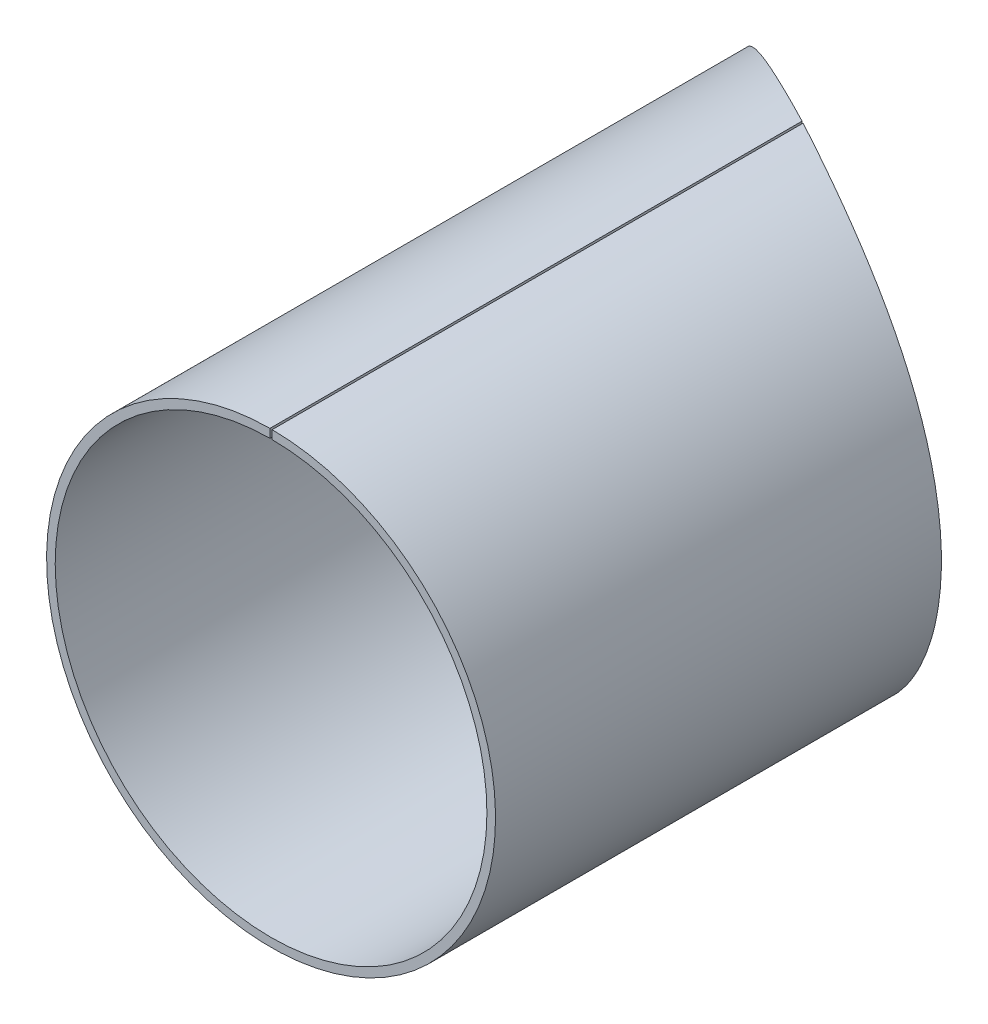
ISO-10303-21;
HEADER;
FILE_DESCRIPTION(('STEP AP214'),'2;1');
FILE_NAME('part.step','',(''),(''),'','','');
FILE_SCHEMA(('AUTOMOTIVE_DESIGN { 1 0 10303 214 1 1 1 1 }'));
ENDSEC;
DATA;
#1=APPLICATION_CONTEXT('core data for automotive mechanical design processes');
#2=APPLICATION_PROTOCOL_DEFINITION('international standard','automotive_design',2000,#1);
#3=PRODUCT_CONTEXT('',#1,'mechanical');
#4=PRODUCT('Part','Part','',(#3));
#5=PRODUCT_RELATED_PRODUCT_CATEGORY('part','',(#4));
#6=PRODUCT_DEFINITION_FORMATION('','',#4);
#7=PRODUCT_DEFINITION_CONTEXT('part definition',#1,'design');
#8=PRODUCT_DEFINITION('design','',#6,#7);
#9=PRODUCT_DEFINITION_SHAPE('','',#8);
#10=(LENGTH_UNIT() NAMED_UNIT(*) SI_UNIT(.MILLI.,.METRE.));
#11=(NAMED_UNIT(*) PLANE_ANGLE_UNIT() SI_UNIT($,.RADIAN.));
#12=(NAMED_UNIT(*) SI_UNIT($,.STERADIAN.) SOLID_ANGLE_UNIT());
#13=UNCERTAINTY_MEASURE_WITH_UNIT(LENGTH_MEASURE(1.E-05),#10,'distance_accuracy_value','');
#14=(GEOMETRIC_REPRESENTATION_CONTEXT(3) GLOBAL_UNCERTAINTY_ASSIGNED_CONTEXT((#13)) GLOBAL_UNIT_ASSIGNED_CONTEXT((#10,
#11,#12)) REPRESENTATION_CONTEXT('',''));
#15=CARTESIAN_POINT('',(0.,0.,0.));
#16=DIRECTION('',(0.,0.,1.));
#17=DIRECTION('',(1.,0.,0.));
#18=AXIS2_PLACEMENT_3D('',#15,#16,#17);
#19=CARTESIAN_POINT('',(0.,0.,-209.5));
#20=DIRECTION('',(0.,0.,1.));
#21=DIRECTION('',(1.,0.,0.));
#22=AXIS2_PLACEMENT_3D('',#19,#20,#21);
#23=CYLINDRICAL_SURFACE('',#22,52.);
#24=CARTESIAN_POINT('',(-5.04544507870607E-05,-51.9999999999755,-123.122101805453));
#25=CARTESIAN_POINT('',(-0.00505523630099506,-51.9999992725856,-123.124708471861));
#26=CARTESIAN_POINT('',(-0.0100600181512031,-51.9999985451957,-123.127315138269));
#27=CARTESIAN_POINT('',(-0.0150648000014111,-51.9999978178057,-123.129921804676));
#28=B_SPLINE_CURVE_WITH_KNOTS('',3,(#24,#25,#26,#27),.UNSPECIFIED.,.F.,.F.,(4,4),(0.,
0.016928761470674),.UNSPECIFIED.);
#29=CARTESIAN_POINT('',(-5.14451119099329E-05,-51.9999999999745,-123.122102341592));
#30=VERTEX_POINT('',#29);
#31=CARTESIAN_POINT('',(-0.0150648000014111,-51.9999978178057,-123.129921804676));
#32=VERTEX_POINT('',#31);
#33=EDGE_CURVE('E102',#30,#32,#28,.T.);
#34=ORIENTED_EDGE('',*,*,#33,.F.);
#35=CARTESIAN_POINT('',(0.26,51.9993499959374,-122.981502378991));
#36=CARTESIAN_POINT('',(0.854038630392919,51.9963775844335,-122.660833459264));
#37=CARTESIAN_POINT('',(1.4495345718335,51.9832215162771,-122.343047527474));
#38=CARTESIAN_POINT('',(2.64368473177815,51.9361970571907,-121.713095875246));
#39=CARTESIAN_POINT('',(3.24234208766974,51.9023012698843,-121.400938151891));
#40=CARTESIAN_POINT('',(5.05376990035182,51.7680950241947,-120.467398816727));
#41=CARTESIAN_POINT('',(6.26935759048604,51.6353101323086,-119.855774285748));
#42=CARTESIAN_POINT('',(8.70202960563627,51.2814405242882,-118.660835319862));
#43=CARTESIAN_POINT('',(9.91911428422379,51.0603276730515,-118.077529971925));
#44=CARTESIAN_POINT('',(12.3488798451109,50.527744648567,-116.941124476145));
#45=CARTESIAN_POINT('',(13.5615566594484,50.2162056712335,-116.388047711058));
#46=CARTESIAN_POINT('',(15.9742792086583,49.5015680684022,-115.314619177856));
#47=CARTESIAN_POINT('',(17.1743259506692,49.0984768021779,-114.7942647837));
#48=CARTESIAN_POINT('',(19.5568656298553,48.199105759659,-113.786671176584));
#49=CARTESIAN_POINT('',(20.7393130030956,47.7026183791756,-113.299509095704));
#50=CARTESIAN_POINT('',(23.0756667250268,46.6173029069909,-112.360874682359));
#51=CARTESIAN_POINT('',(24.2295729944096,46.0284745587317,-111.909402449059));
#52=CARTESIAN_POINT('',(26.5005287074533,44.7595025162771,-111.043098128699));
#53=CARTESIAN_POINT('',(27.6175794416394,44.0793620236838,-110.628264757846));
#54=CARTESIAN_POINT('',(29.258743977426,42.9925228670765,-110.033703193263));
#55=CARTESIAN_POINT('',(29.8001284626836,42.6190880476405,-109.840108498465));
#56=CARTESIAN_POINT('',(30.8704743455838,41.8503025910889,-109.46215710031));
#57=CARTESIAN_POINT('',(31.3994356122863,41.4549517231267,-109.277800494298));
#58=CARTESIAN_POINT('',(32.499329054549,40.5996204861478,-108.899221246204));
#59=CARTESIAN_POINT('',(33.0687488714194,40.1372364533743,-108.706031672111));
#60=CARTESIAN_POINT('',(34.1896259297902,39.1868520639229,-108.330869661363));
#61=CARTESIAN_POINT('',(34.741083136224,38.6988516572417,-108.148897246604));
#62=CARTESIAN_POINT('',(35.8247380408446,37.6979079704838,-107.796079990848));
#63=CARTESIAN_POINT('',(36.3569329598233,37.1849611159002,-107.625236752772));
#64=CARTESIAN_POINT('',(37.4005720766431,36.1350937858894,-107.294542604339));
#65=CARTESIAN_POINT('',(37.9120185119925,35.5981759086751,-107.134690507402));
#66=CARTESIAN_POINT('',(38.9132346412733,34.5009002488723,-106.825705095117));
#67=CARTESIAN_POINT('',(39.4029909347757,33.9405283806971,-106.676578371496));
#68=CARTESIAN_POINT('',(40.3592731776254,32.79762580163,-106.389057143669));
#69=CARTESIAN_POINT('',(40.8257986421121,32.2150946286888,-106.250662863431));
#70=CARTESIAN_POINT('',(41.734403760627,31.0289800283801,-105.984413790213));
#71=CARTESIAN_POINT('',(42.1764845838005,30.4253976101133,-105.856558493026));
#72=CARTESIAN_POINT('',(43.0350553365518,29.1983683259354,-105.611090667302));
#73=CARTESIAN_POINT('',(43.45154722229,28.5749229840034,-105.493477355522));
#74=CARTESIAN_POINT('',(44.3668677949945,27.138333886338,-105.237775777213));
#75=CARTESIAN_POINT('',(44.857551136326,26.319435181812,-105.102737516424));
#76=CARTESIAN_POINT('',(45.7940155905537,24.6540231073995,-104.848338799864));
#77=CARTESIAN_POINT('',(46.2397967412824,23.8075097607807,-104.728978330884));
#78=CARTESIAN_POINT('',(47.0847251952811,22.0894793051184,-104.505364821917));
#79=CARTESIAN_POINT('',(47.4838684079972,21.2179600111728,-104.401113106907));
#80=CARTESIAN_POINT('',(48.2332433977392,19.4543218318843,-104.207475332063));
#81=CARTESIAN_POINT('',(48.5835583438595,18.5622410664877,-104.118063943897));
#82=CARTESIAN_POINT('',(49.2346841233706,16.7590193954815,-103.953366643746));
#83=CARTESIAN_POINT('',(49.5354996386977,15.8478803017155,-103.878079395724));
#84=CARTESIAN_POINT('',(50.0863992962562,14.0097360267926,-103.741301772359));
#85=CARTESIAN_POINT('',(50.3365034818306,13.0827372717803,-103.679805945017));
#86=CARTESIAN_POINT('',(50.7245154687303,11.4679790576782,-103.58498004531));
#87=CARTESIAN_POINT('',(50.8744778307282,10.7832701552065,-103.548529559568));
#88=CARTESIAN_POINT('',(51.1466256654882,9.40817460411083,-103.482649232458));
#89=CARTESIAN_POINT('',(51.268817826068,8.7177893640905,-103.453217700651));
#90=CARTESIAN_POINT('',(51.4852472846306,7.33219827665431,-103.401210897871));
#91=CARTESIAN_POINT('',(51.5794767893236,6.6369911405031,-103.378637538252));
#92=CARTESIAN_POINT('',(51.7397647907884,5.24300546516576,-103.340240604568));
#93=CARTESIAN_POINT('',(51.8058169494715,4.5442261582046,-103.324418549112));
#94=CARTESIAN_POINT('',(51.9277578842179,2.89928121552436,-103.295274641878));
#95=CARTESIAN_POINT('',(51.971986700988,1.95217965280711,-103.284768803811));
#96=CARTESIAN_POINT('',(52.0086130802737,0.0565187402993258,-103.276191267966));
#97=CARTESIAN_POINT('',(52.0009901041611,-0.89204103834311,-103.278124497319));
#98=CARTESIAN_POINT('',(51.9506787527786,-2.31341828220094,-103.290203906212));
#99=CARTESIAN_POINT('',(51.927422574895,-2.7870361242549,-103.295761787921));
#100=CARTESIAN_POINT('',(51.8679710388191,-3.73341359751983,-103.309913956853));
#101=CARTESIAN_POINT('',(51.8317756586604,-4.20617322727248,-103.31850824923));
#102=CARTESIAN_POINT('',(51.7038027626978,-5.62279822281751,-103.348964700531));
#103=CARTESIAN_POINT('',(51.5926426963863,-6.56489104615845,-103.375499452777));
#104=CARTESIAN_POINT('',(51.3190948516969,-8.44091698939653,-103.441099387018));
#105=CARTESIAN_POINT('',(51.1567170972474,-9.37485166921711,-103.480162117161));
#106=CARTESIAN_POINT('',(50.7813894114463,-11.2315172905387,-103.571092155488));
#107=CARTESIAN_POINT('',(50.5684603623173,-12.1542526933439,-103.622954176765));
#108=CARTESIAN_POINT('',(50.1546632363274,-13.7477316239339,-103.724591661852));
#109=CARTESIAN_POINT('',(49.9650536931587,-14.421615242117,-103.771403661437));
#110=CARTESIAN_POINT('',(49.558988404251,-15.7605822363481,-103.872315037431));
#111=CARTESIAN_POINT('',(49.3425373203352,-16.4256671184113,-103.926413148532));
#112=CARTESIAN_POINT('',(48.8834804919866,-17.7452185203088,-104.042045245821));
#113=CARTESIAN_POINT('',(48.6409053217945,-18.3996964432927,-104.103570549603));
#114=CARTESIAN_POINT('',(48.1298811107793,-19.6977430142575,-104.234231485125));
#115=CARTESIAN_POINT('',(47.8614306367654,-20.3413110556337,-104.303367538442));
#116=CARTESIAN_POINT('',(47.2992204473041,-21.6164115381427,-104.449458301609));
#117=CARTESIAN_POINT('',(47.0054600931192,-22.2479436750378,-104.526413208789));
#118=CARTESIAN_POINT('',(46.3932701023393,-23.4978451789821,-104.688316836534));
#119=CARTESIAN_POINT('',(46.074841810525,-24.1162152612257,-104.773265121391));
#120=CARTESIAN_POINT('',(45.4136094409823,-25.3394546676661,-104.951388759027));
#121=CARTESIAN_POINT('',(45.0707793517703,-25.944308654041,-105.044572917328));
#122=CARTESIAN_POINT('',(44.3617341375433,-27.1388857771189,-105.239348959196));
#123=CARTESIAN_POINT('',(43.9955150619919,-27.7286063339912,-105.340942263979));
#124=CARTESIAN_POINT('',(43.1080933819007,-29.0958640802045,-105.589936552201));
#125=CARTESIAN_POINT('',(42.5775797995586,-29.8667379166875,-105.740907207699));
#126=CARTESIAN_POINT('',(41.4772753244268,-31.3768848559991,-106.059125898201));
#127=CARTESIAN_POINT('',(40.9074683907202,-32.1161448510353,-106.22638059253));
#128=CARTESIAN_POINT('',(39.7308747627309,-33.560773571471,-106.577370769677));
#129=CARTESIAN_POINT('',(39.1240813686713,-34.2661361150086,-106.761109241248));
#130=CARTESIAN_POINT('',(37.8759894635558,-35.6408670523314,-107.145566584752));
#131=CARTESIAN_POINT('',(37.2346886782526,-36.3102330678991,-107.346286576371));
#132=CARTESIAN_POINT('',(35.9202773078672,-37.6110152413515,-107.764912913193));
#133=CARTESIAN_POINT('',(35.2471726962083,-38.2424384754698,-107.982816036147));
#134=CARTESIAN_POINT('',(33.8719323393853,-39.4656648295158,-108.436044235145));
#135=CARTESIAN_POINT('',(33.169807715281,-40.0574829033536,-108.671362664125));
#136=CARTESIAN_POINT('',(31.9175899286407,-41.0577608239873,-109.098652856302));
#137=CARTESIAN_POINT('',(31.3732724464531,-41.4751276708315,-109.286790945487));
#138=CARTESIAN_POINT('',(30.2709536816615,-42.2863753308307,-109.67295727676));
#139=CARTESIAN_POINT('',(29.7129546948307,-42.6802600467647,-109.870983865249));
#140=CARTESIAN_POINT('',(28.5848949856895,-43.443840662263,-110.276824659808));
#141=CARTESIAN_POINT('',(28.0148452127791,-43.8135573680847,-110.484630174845));
#142=CARTESIAN_POINT('',(26.8633797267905,-44.5288471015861,-110.910165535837));
#143=CARTESIAN_POINT('',(26.2819635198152,-44.8744190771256,-111.127895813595));
#144=CARTESIAN_POINT('',(25.1089251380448,-45.54115791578,-111.573213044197));
#145=CARTESIAN_POINT('',(24.5173020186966,-45.8623225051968,-111.800800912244));
#146=CARTESIAN_POINT('',(23.3250829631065,-46.4800090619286,-112.265664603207));
#147=CARTESIAN_POINT('',(22.7244871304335,-46.7765313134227,-112.502940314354));
#148=CARTESIAN_POINT('',(21.5153897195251,-47.3448440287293,-112.987116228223));
#149=CARTESIAN_POINT('',(20.9068869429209,-47.6166306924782,-113.234017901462));
#150=CARTESIAN_POINT('',(19.6832655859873,-48.1353380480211,-113.737263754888));
#151=CARTESIAN_POINT('',(19.068146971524,-48.3822586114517,-113.993607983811));
#152=CARTESIAN_POINT('',(17.2152148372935,-49.0854415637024,-114.77626895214));
#153=CARTESIAN_POINT('',(15.9689694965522,-49.5045259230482,-115.316555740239));
#154=CARTESIAN_POINT('',(13.4628842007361,-50.243987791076,-116.432367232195));
#155=CARTESIAN_POINT('',(12.2030414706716,-50.5643447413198,-117.007899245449));
#156=CARTESIAN_POINT('',(10.0275398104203,-51.0325486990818,-118.028057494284));
#157=CARTESIAN_POINT('',(9.11311323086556,-51.2036016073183,-118.464835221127));
#158=CARTESIAN_POINT('',(7.28404321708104,-51.4956352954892,-119.354795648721));
#159=CARTESIAN_POINT('',(6.36939977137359,-51.6166081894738,-119.807980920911));
#160=CARTESIAN_POINT('',(4.54243732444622,-51.8093644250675,-120.729814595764));
#161=CARTESIAN_POINT('',(3.63011905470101,-51.8811338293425,-121.19846734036));
#162=CARTESIAN_POINT('',(1.81064018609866,-51.9764520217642,-122.149918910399));
#163=CARTESIAN_POINT('',(0.903478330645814,-52.0000131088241,-122.632714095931));
#164=CARTESIAN_POINT('',(-5.24156174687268E-05,-51.9999999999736,-123.122102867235));
#165=B_SPLINE_CURVE_WITH_KNOTS('',3,(#35,#36,#37,#38,#39,#40,#41,#42,#43,#44,#45,#46,#47,#48,
#49,#50,#51,#52,#53,#54,#55,#56,#57,#58,#59,#60,#61,#62,#63,#64,#65,#66,#67,#68,#69,#70,#71,#72,
#73,#74,#75,#76,#77,#78,#79,#80,#81,#82,#83,#84,#85,#86,#87,#88,#89,#90,#91,#92,#93,#94,#95,#96,
#97,#98,#99,#100,#101,#102,#103,#104,#105,#106,#107,#108,#109,#110,#111,#112,#113,#114,#115,
#116,#117,#118,#119,#120,#121,#122,#123,#124,#125,#126,#127,#128,#129,#130,#131,#132,#133,#134,
#135,#136,#137,#138,#139,#140,#141,#142,#143,#144,#145,#146,#147,#148,#149,#150,#151,#152,#153,
#154,#155,#156,#157,#158,#159,#160,#161,#162,#163,#164),.UNSPECIFIED.,.F.,.F.,(4,2,2,2,2,2,2,2,
2,2,2,2,2,2,2,2,2,2,2,2,2,2,2,2,2,2,2,2,2,2,2,2,2,2,2,2,2,2,2,2,2,2,2,2,2,2,2,2,2,2,2,2,2,2,2,2,
2,2,2,2,2,2,2,2,4),(0.,2.02503479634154,4.05275037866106,8.15118769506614,12.2509315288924,
16.3538030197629,20.4563448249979,24.5681160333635,28.6798986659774,32.7915371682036,
34.8478656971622,36.9042158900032,39.1790617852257,41.4539121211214,43.729089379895,
46.0040206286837,48.2803382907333,50.5567034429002,52.8329596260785,55.1090415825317,
57.9998894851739,60.8907349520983,63.7818337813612,66.6679464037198,69.5537858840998,
72.4384825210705,74.543572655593,76.6481552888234,78.7533239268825,80.858965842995,
83.7020074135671,86.546175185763,87.9686752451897,89.3911777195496,92.23653834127,
95.0813424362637,97.9249734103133,100.029249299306,102.133160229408,104.234635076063,
106.336226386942,108.437870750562,110.539400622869,112.643205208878,114.7473660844,
117.589462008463,120.432725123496,123.276504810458,126.120472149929,128.963907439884,
131.806262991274,133.939449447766,136.07228037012,138.203250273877,140.334312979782,
142.465573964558,144.596810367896,146.728373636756,148.859947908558,153.12009051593,
157.38111963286,160.462991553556,163.545348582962,166.628578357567,169.711021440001),.UNSPECIFIED.);
#166=CARTESIAN_POINT('',(0.26,51.9993499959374,-122.981502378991));
#167=VERTEX_POINT('',#166);
#168=EDGE_CURVE('E101',#167,#30,#165,.T.);
#169=ORIENTED_EDGE('',*,*,#168,.F.);
#170=DIRECTION('',(0.,0.,1.));
#171=VECTOR('',#170,1.);
#172=CARTESIAN_POINT('',(0.26,51.9993499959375,-209.5));
#173=LINE('',#172,#171);
#174=CARTESIAN_POINT('',(0.26,51.9993499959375,0.));
#175=VERTEX_POINT('',#174);
#176=EDGE_CURVE('E38',#167,#175,#173,.T.);
#177=ORIENTED_EDGE('',*,*,#176,.T.);
#178=CARTESIAN_POINT('',(0.,0.,0.));
#179=DIRECTION('',(0.,0.,1.));
#180=DIRECTION('',(1.,0.,0.));
#181=AXIS2_PLACEMENT_3D('',#178,#179,#180);
#182=CIRCLE('',#181,52.);
#183=CARTESIAN_POINT('',(-0.260000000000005,51.9993499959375,0.));
#184=VERTEX_POINT('',#183);
#185=EDGE_CURVE('E111',#184,#175,#182,.T.);
#186=ORIENTED_EDGE('',*,*,#185,.F.);
#187=DIRECTION('',(0.,0.,1.));
#188=VECTOR('',#187,1.);
#189=CARTESIAN_POINT('',(-0.260000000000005,51.9993499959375,-209.5));
#190=LINE('',#189,#188);
#191=CARTESIAN_POINT('',(-0.260000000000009,51.9993499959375,-123.257708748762));
#192=VERTEX_POINT('',#191);
#193=EDGE_CURVE('E11',#192,#184,#190,.T.);
#194=ORIENTED_EDGE('',*,*,#193,.F.);
#195=CARTESIAN_POINT('',(-0.0150648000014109,-51.9999978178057,-123.129921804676));
#196=CARTESIAN_POINT('',(-0.608212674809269,-51.9998238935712,-123.438881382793));
#197=CARTESIAN_POINT('',(-1.19991955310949,-51.9895052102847,-123.750486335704));
#198=CARTESIAN_POINT('',(-2.3800164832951,-51.9488614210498,-124.37873969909));
#199=CARTESIAN_POINT('',(-2.96840628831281,-51.9185348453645,-124.695388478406));
#200=CARTESIAN_POINT('',(-4.72955363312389,-51.7978513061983,-125.653405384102));
#201=CARTESIAN_POINT('',(-5.89652999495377,-51.6777926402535,-126.301927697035));
#202=CARTESIAN_POINT('',(-8.21097483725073,-51.3609297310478,-127.615396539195));
#203=CARTESIAN_POINT('',(-9.35843622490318,-51.1640981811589,-128.280348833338));
#204=CARTESIAN_POINT('',(-12.1445538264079,-50.5900023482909,-129.928141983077));
#205=CARTESIAN_POINT('',(-13.7703514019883,-50.1713940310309,-130.91858379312));
#206=CARTESIAN_POINT('',(-16.9631647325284,-49.1837819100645,-132.919643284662));
#207=CARTESIAN_POINT('',(-18.5301694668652,-48.6147500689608,-133.930264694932));
#208=CARTESIAN_POINT('',(-20.8294945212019,-47.6531439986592,-135.453548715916));
#209=CARTESIAN_POINT('',(-21.5873363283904,-47.3146361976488,-135.962486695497));
#210=CARTESIAN_POINT('',(-23.0852418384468,-46.6021395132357,-136.981809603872));
#211=CARTESIAN_POINT('',(-23.8253054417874,-46.2281504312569,-137.49219454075));
#212=CARTESIAN_POINT('',(-25.2866998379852,-45.4452423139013,-138.513100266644));
#213=CARTESIAN_POINT('',(-26.008029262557,-45.0363207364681,-139.023621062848));
#214=CARTESIAN_POINT('',(-27.4309601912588,-44.184049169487,-140.043400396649));
#215=CARTESIAN_POINT('',(-28.132561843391,-43.7406994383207,-140.55265894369));
#216=CARTESIAN_POINT('',(-29.5060749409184,-42.8259665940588,-141.561844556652));
#217=CARTESIAN_POINT('',(-30.1782545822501,-42.3550255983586,-142.061806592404));
#218=CARTESIAN_POINT('',(-31.1706718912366,-41.6240077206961,-142.808620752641));
#219=CARTESIAN_POINT('',(-31.4988429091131,-41.3762281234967,-143.057042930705));
#220=CARTESIAN_POINT('',(-32.149779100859,-40.8724978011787,-143.552696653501));
#221=CARTESIAN_POINT('',(-32.4725441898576,-40.6165469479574,-143.799928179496));
#222=CARTESIAN_POINT('',(-33.4322355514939,-39.8367294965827,-144.53923944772));
#223=CARTESIAN_POINT('',(-34.0609178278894,-39.3006330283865,-145.029206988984));
#224=CARTESIAN_POINT('',(-35.2951832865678,-38.1960200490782,-146.001599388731));
#225=CARTESIAN_POINT('',(-35.9007666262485,-37.6275037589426,-146.484024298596));
#226=CARTESIAN_POINT('',(-37.029417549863,-36.5155669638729,-147.392594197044));
#227=CARTESIAN_POINT('',(-37.554749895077,-35.9751608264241,-147.819615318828));
#228=CARTESIAN_POINT('',(-38.5846576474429,-34.8682624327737,-148.664686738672));
#229=CARTESIAN_POINT('',(-39.0892344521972,-34.3017719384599,-149.082737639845));
#230=CARTESIAN_POINT('',(-40.0774748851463,-33.1417758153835,-149.908721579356));
#231=CARTESIAN_POINT('',(-40.5611060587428,-32.5482309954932,-150.316638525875));
#232=CARTESIAN_POINT('',(-41.5055426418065,-31.3349841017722,-151.120034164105));
#233=CARTESIAN_POINT('',(-41.9663434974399,-30.7152768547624,-151.515510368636));
#234=CARTESIAN_POINT('',(-43.2033701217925,-28.9710999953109,-152.5858133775));
#235=CARTESIAN_POINT('',(-43.9546216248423,-27.8192957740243,-153.245740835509));
#236=CARTESIAN_POINT('',(-45.0198321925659,-26.0325957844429,-154.193376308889));
#237=CARTESIAN_POINT('',(-45.3647151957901,-25.4270136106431,-154.502295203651));
#238=CARTESIAN_POINT('',(-46.0328888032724,-24.1963476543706,-155.104379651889));
#239=CARTESIAN_POINT('',(-46.3561799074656,-23.5712643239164,-155.397545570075));
#240=CARTESIAN_POINT('',(-46.9796788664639,-22.3026658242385,-155.966250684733));
#241=CARTESIAN_POINT('',(-47.2799072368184,-21.6591677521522,-156.241805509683));
#242=CARTESIAN_POINT('',(-47.8564144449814,-20.3536909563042,-156.773640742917));
#243=CARTESIAN_POINT('',(-48.1326926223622,-19.6917117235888,-157.029920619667));
#244=CARTESIAN_POINT('',(-48.6598796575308,-18.3503433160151,-157.521303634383));
#245=CARTESIAN_POINT('',(-48.9107991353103,-17.6709615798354,-157.756415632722));
#246=CARTESIAN_POINT('',(-49.3860406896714,-16.2956585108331,-158.203671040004));
#247=CARTESIAN_POINT('',(-49.6103653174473,-15.5997387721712,-158.4158166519));
#248=CARTESIAN_POINT('',(-50.1232450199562,-13.8843193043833,-158.902666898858));
#249=CARTESIAN_POINT('',(-50.3969572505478,-12.8564708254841,-159.164129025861));
#250=CARTESIAN_POINT('',(-50.7613487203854,-11.2947617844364,-159.513679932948));
#251=CARTESIAN_POINT('',(-50.8751188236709,-10.770855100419,-159.623092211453));
#252=CARTESIAN_POINT('',(-51.0868821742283,-9.71695475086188,-159.827103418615));
#253=CARTESIAN_POINT('',(-51.1848752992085,-9.18696103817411,-159.921702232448));
#254=CARTESIAN_POINT('',(-51.3645707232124,-8.12231742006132,-160.09546385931));
#255=CARTESIAN_POINT('',(-51.4462905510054,-7.58767317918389,-160.174643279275));
#256=CARTESIAN_POINT('',(-51.5932345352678,-6.51396750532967,-160.317200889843));
#257=CARTESIAN_POINT('',(-51.6584570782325,-5.97490564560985,-160.38057753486));
#258=CARTESIAN_POINT('',(-51.7721022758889,-4.8933689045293,-160.491097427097));
#259=CARTESIAN_POINT('',(-51.8205254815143,-4.35089413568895,-160.538241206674));
#260=CARTESIAN_POINT('',(-51.9003540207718,-3.26351032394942,-160.616025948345));
#261=CARTESIAN_POINT('',(-51.9317588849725,-2.71860121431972,-160.646666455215));
#262=CARTESIAN_POINT('',(-51.9850871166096,-1.44347612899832,-160.698711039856));
#263=CARTESIAN_POINT('',(-52.0002501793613,-0.712687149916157,-160.713524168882));
#264=CARTESIAN_POINT('',(-51.9997435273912,0.748867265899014,-160.713028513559));
#265=CARTESIAN_POINT('',(-51.984072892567,1.47963270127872,-160.697718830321));
#266=CARTESIAN_POINT('',(-51.9220349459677,2.93859701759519,-160.637188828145));
#267=CARTESIAN_POINT('',(-51.8756685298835,3.66679597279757,-160.591969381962));
#268=CARTESIAN_POINT('',(-51.7525952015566,5.11858712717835,-160.472114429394));
#269=CARTESIAN_POINT('',(-51.6758714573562,5.84217654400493,-160.39746260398));
#270=CARTESIAN_POINT('',(-51.4927020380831,7.28205459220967,-160.219608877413));
#271=CARTESIAN_POINT('',(-51.3862558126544,7.99834308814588,-160.116406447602));
#272=CARTESIAN_POINT('',(-51.1444782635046,9.4214321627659,-159.882648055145));
#273=CARTESIAN_POINT('',(-51.0091482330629,10.128233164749,-159.75209331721));
#274=CARTESIAN_POINT('',(-50.6423687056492,11.8507550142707,-159.399288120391));
#275=CARTESIAN_POINT('',(-50.3952430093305,12.8601984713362,-159.162385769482));
#276=CARTESIAN_POINT('',(-49.845138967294,14.8501934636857,-158.638211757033));
#277=CARTESIAN_POINT('',(-49.5421598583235,15.8307446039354,-158.350939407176));
#278=CARTESIAN_POINT('',(-48.8840411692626,17.7591787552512,-157.731063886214));
#279=CARTESIAN_POINT('',(-48.5289103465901,18.7070672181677,-157.398468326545));
#280=CARTESIAN_POINT('',(-47.7700657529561,20.5676982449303,-156.693277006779));
#281=CARTESIAN_POINT('',(-47.366355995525,21.4804437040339,-156.32068455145));
#282=CARTESIAN_POINT('',(-46.6264544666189,23.0326998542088,-155.643524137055));
#283=CARTESIAN_POINT('',(-46.3005952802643,23.6807006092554,-155.346983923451));
#284=CARTESIAN_POINT('',(-45.6257384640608,24.9562109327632,-154.736872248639));
#285=CARTESIAN_POINT('',(-45.2767433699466,25.5837227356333,-154.423302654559));
#286=CARTESIAN_POINT('',(-44.5570213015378,26.8175627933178,-153.781025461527));
#287=CARTESIAN_POINT('',(-44.1863076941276,27.4239037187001,-153.452327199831));
#288=CARTESIAN_POINT('',(-43.4240452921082,28.6156006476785,-152.78139915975));
#289=CARTESIAN_POINT('',(-43.0324958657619,29.2009560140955,-152.43916897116));
#290=CARTESIAN_POINT('',(-41.8290734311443,30.9239414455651,-151.395205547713));
#291=CARTESIAN_POINT('',(-40.9874828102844,32.0300997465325,-150.675354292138));
#292=CARTESIAN_POINT('',(-39.2321812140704,34.1575539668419,-149.198828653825));
#293=CARTESIAN_POINT('',(-38.318451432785,35.1788276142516,-148.442144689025));
#294=CARTESIAN_POINT('',(-36.7863506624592,36.7623889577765,-147.195486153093));
#295=CARTESIAN_POINT('',(-36.1882830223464,37.3511441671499,-146.713888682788));
#296=CARTESIAN_POINT('',(-34.9680720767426,38.4958935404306,-145.742190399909));
#297=CARTESIAN_POINT('',(-34.3459277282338,39.0518862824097,-145.252089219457));
#298=CARTESIAN_POINT('',(-33.0786717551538,40.1309615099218,-144.265318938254));
#299=CARTESIAN_POINT('',(-32.43355870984,40.6540419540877,-143.768649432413));
#300=CARTESIAN_POINT('',(-31.1215239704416,41.6669849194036,-142.770299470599));
#301=CARTESIAN_POINT('',(-30.4546025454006,42.1568478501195,-142.268619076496));
#302=CARTESIAN_POINT('',(-29.1002909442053,43.1028416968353,-141.262132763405));
#303=CARTESIAN_POINT('',(-28.412912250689,43.5589910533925,-140.757328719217));
#304=CARTESIAN_POINT('',(-27.0182248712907,44.4375374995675,-139.745884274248));
#305=CARTESIAN_POINT('',(-26.3109161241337,44.8599344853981,-139.239243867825));
#306=CARTESIAN_POINT('',(-24.8772303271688,45.6705778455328,-138.225342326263));
#307=CARTESIAN_POINT('',(-24.1508504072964,46.0588190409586,-137.718081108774));
#308=CARTESIAN_POINT('',(-22.6800364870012,46.8005802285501,-136.704331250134));
#309=CARTESIAN_POINT('',(-21.9356022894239,47.15409984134,-136.197842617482));
#310=CARTESIAN_POINT('',(-20.3883006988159,47.8442648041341,-135.159101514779));
#311=CARTESIAN_POINT('',(-19.5844688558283,48.1789187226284,-134.626960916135));
#312=CARTESIAN_POINT('',(-17.9588709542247,48.808181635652,-133.566298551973));
#313=CARTESIAN_POINT('',(-17.1371039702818,49.1027885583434,-133.037776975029));
#314=CARTESIAN_POINT('',(-15.4774246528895,49.6509076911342,-131.985995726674));
#315=CARTESIAN_POINT('',(-14.6395223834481,49.9044446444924,-131.462733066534));
#316=CARTESIAN_POINT('',(-12.948404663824,50.3697109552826,-130.422448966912));
#317=CARTESIAN_POINT('',(-12.0951902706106,50.5814431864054,-129.905427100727));
#318=CARTESIAN_POINT('',(-10.7927838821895,50.8696473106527,-129.128287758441));
#319=CARTESIAN_POINT('',(-10.3486796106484,50.9618592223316,-128.865385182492));
#320=CARTESIAN_POINT('',(-9.45703928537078,51.134827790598,-128.341758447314));
#321=CARTESIAN_POINT('',(-9.00950365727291,51.2155858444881,-128.081034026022));
#322=CARTESIAN_POINT('',(-7.88324900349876,51.4035560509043,-127.430185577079));
#323=CARTESIAN_POINT('',(-7.20244000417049,51.5034013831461,-127.04152426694));
#324=CARTESIAN_POINT('',(-5.83410194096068,51.6762893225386,-126.26997029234));
#325=CARTESIAN_POINT('',(-5.14657222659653,51.7493293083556,-125.887078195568));
#326=CARTESIAN_POINT('',(-3.76204386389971,51.868413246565,-125.125648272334));
#327=CARTESIAN_POINT('',(-3.06501447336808,51.9143136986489,-124.747143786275));
#328=CARTESIAN_POINT('',(-1.66600203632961,51.9780223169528,-123.997087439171));
#329=CARTESIAN_POINT('',(-0.964019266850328,51.9958320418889,-123.625535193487));
#330=CARTESIAN_POINT('',(-0.260000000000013,51.9993499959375,-123.257708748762));
#331=B_SPLINE_CURVE_WITH_KNOTS('',3,(#195,#196,#197,#198,#199,#200,#201,#202,#203,#204,#205,
#206,#207,#208,#209,#210,#211,#212,#213,#214,#215,#216,#217,#218,#219,#220,#221,#222,#223,#224,
#225,#226,#227,#228,#229,#230,#231,#232,#233,#234,#235,#236,#237,#238,#239,#240,#241,#242,#243,
#244,#245,#246,#247,#248,#249,#250,#251,#252,#253,#254,#255,#256,#257,#258,#259,#260,#261,#262,
#263,#264,#265,#266,#267,#268,#269,#270,#271,#272,#273,#274,#275,#276,#277,#278,#279,#280,#281,
#282,#283,#284,#285,#286,#287,#288,#289,#290,#291,#292,#293,#294,#295,#296,#297,#298,#299,#300,
#301,#302,#303,#304,#305,#306,#307,#308,#309,#310,#311,#312,#313,#314,#315,#316,#317,#318,#319,
#320,#321,#322,#323,#324,#325,#326,#327,#328,#329,#330),.UNSPECIFIED.,.F.,.F.,(4,2,2,2,2,2,2,2,
2,2,2,2,2,2,2,2,2,2,2,2,2,2,2,2,2,2,2,2,2,2,2,2,2,2,2,2,2,2,2,2,2,2,2,2,2,2,2,2,2,2,2,2,2,2,2,2,
2,2,2,2,2,2,2,2,2,2,2,4),(0.,2.00618545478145,4.01251829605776,8.03112411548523,
12.0511605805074,17.8915438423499,23.7330164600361,26.6531982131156,29.5733963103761,
32.4938070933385,35.4141959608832,38.2964163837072,39.7375920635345,41.1787903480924,
44.0596199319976,46.9404298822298,49.5384629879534,52.1363208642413,54.7380696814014,
57.340335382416,61.9103999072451,64.1967518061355,66.483050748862,68.7672917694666,
71.0515957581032,73.3349391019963,75.6180632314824,78.9001670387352,80.5413067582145,
82.1824591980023,83.8218341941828,85.4613694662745,87.1008509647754,88.7403776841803,
90.932340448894,93.1243686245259,95.3163328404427,97.5095141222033,99.7027360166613,
101.895859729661,105.090192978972,108.284569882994,111.478410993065,114.671988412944,
117.022014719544,119.371783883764,121.720121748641,124.068530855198,128.759224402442,
133.45114482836,136.353139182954,139.255259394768,142.157559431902,145.059823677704,
147.960488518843,150.861162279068,153.762275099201,156.66341961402,159.723812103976,
162.784362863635,165.843062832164,168.901552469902,170.474214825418,172.046685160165,
174.416972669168,176.787491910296,179.170435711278,181.553247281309),.UNSPECIFIED.);
#332=EDGE_CURVE('E97',#32,#192,#331,.T.);
#333=ORIENTED_EDGE('',*,*,#332,.F.);
#334=EDGE_LOOP('',(#34,#169,#177,#186,#194,#333));
#335=FACE_BOUND('',#334,.T.);
#336=ADVANCED_FACE('F35',(#335),#23,.T.);
#337=CARTESIAN_POINT('',(-0.260000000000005,51.9993499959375,-209.5));
#338=DIRECTION('',(-0.999987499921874,-0.00500000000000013,0.));
#339=DIRECTION('',(0.00500000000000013,-0.999987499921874,0.));
#340=AXIS2_PLACEMENT_3D('',#337,#338,#339);
#341=PLANE('',#340);
#342=DIRECTION('',(-0.0050000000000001,0.999987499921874,0.));
#343=VECTOR('',#342,1.);
#344=CARTESIAN_POINT('',(-0.260000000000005,51.9993499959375,-123.257708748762));
#345=LINE('',#344,#343);
#346=CARTESIAN_POINT('',(-0.250000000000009,49.9993749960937,-123.257708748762));
#347=VERTEX_POINT('',#346);
#348=EDGE_CURVE('E103',#347,#192,#345,.T.);
#349=ORIENTED_EDGE('',*,*,#348,.T.);
#350=ORIENTED_EDGE('',*,*,#193,.T.);
#351=DIRECTION('',(0.00500000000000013,-0.999987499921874,0.));
#352=VECTOR('',#351,1.);
#353=CARTESIAN_POINT('',(-0.260000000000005,51.9993499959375,0.));
#354=LINE('',#353,#352);
#355=CARTESIAN_POINT('',(-0.250000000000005,49.9993749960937,0.));
#356=VERTEX_POINT('',#355);
#357=EDGE_CURVE('E157',#184,#356,#354,.T.);
#358=ORIENTED_EDGE('',*,*,#357,.T.);
#359=DIRECTION('',(0.,0.,1.));
#360=VECTOR('',#359,1.);
#361=CARTESIAN_POINT('',(-0.250000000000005,49.9993749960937,-209.5));
#362=LINE('',#361,#360);
#363=EDGE_CURVE('E43',#347,#356,#362,.T.);
#364=ORIENTED_EDGE('',*,*,#363,.F.);
#365=EDGE_LOOP('',(#349,#350,#358,#364));
#366=FACE_BOUND('',#365,.T.);
#367=ADVANCED_FACE('F169',(#366),#341,.F.);
#368=CARTESIAN_POINT('',(0.,0.,-209.5));
#369=DIRECTION('',(0.,0.,1.));
#370=DIRECTION('',(1.,0.,0.));
#371=AXIS2_PLACEMENT_3D('',#368,#369,#370);
#372=CYLINDRICAL_SURFACE('',#371,50.);
#373=CARTESIAN_POINT('',(0.25,49.9993749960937,-122.981502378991));
#374=CARTESIAN_POINT('',(0.832804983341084,49.9964584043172,-122.654313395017));
#375=CARTESIAN_POINT('',(1.41716470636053,49.9833477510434,-122.330071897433));
#376=CARTESIAN_POINT('',(2.58926633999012,49.9363625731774,-121.687323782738));
#377=CARTESIAN_POINT('',(3.17701184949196,49.9024588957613,-121.368825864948));
#378=CARTESIAN_POINT('',(4.95629278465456,49.7680640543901,-120.416102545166));
#379=CARTESIAN_POINT('',(6.15093852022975,49.6349326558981,-119.791910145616));
#380=CARTESIAN_POINT('',(8.54236906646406,49.2797109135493,-118.572755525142));
#381=CARTESIAN_POINT('',(9.73915445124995,49.057591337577,-117.977802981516));
#382=CARTESIAN_POINT('',(12.128773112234,48.5220876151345,-116.819212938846));
#383=CARTESIAN_POINT('',(13.3216025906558,48.2086326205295,-116.255600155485));
#384=CARTESIAN_POINT('',(15.6947500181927,47.4890751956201,-115.162442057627));
#385=CARTESIAN_POINT('',(16.8750690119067,47.0829805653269,-114.632893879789));
#386=CARTESIAN_POINT('',(19.2184717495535,46.1761011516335,-113.608132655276));
#387=CARTESIAN_POINT('',(20.3815019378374,45.6750698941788,-113.113013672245));
#388=CARTESIAN_POINT('',(22.103909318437,44.8533427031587,-112.398453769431));
#389=CARTESIAN_POINT('',(22.6744107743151,44.5677052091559,-112.164931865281));
#390=CARTESIAN_POINT('',(23.8070452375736,43.9731003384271,-111.707368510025));
#391=CARTESIAN_POINT('',(24.3691782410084,43.6641329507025,-111.483327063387));
#392=CARTESIAN_POINT('',(25.4838873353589,43.0230740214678,-111.044851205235));
#393=CARTESIAN_POINT('',(26.036463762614,42.6909832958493,-110.830416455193));
#394=CARTESIAN_POINT('',(27.1309405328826,42.0039228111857,-110.411171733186));
#395=CARTESIAN_POINT('',(27.6728409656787,41.6489532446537,-110.206361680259));
#396=CARTESIAN_POINT('',(28.7448915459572,40.9164115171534,-109.806390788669));
#397=CARTESIAN_POINT('',(29.2750404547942,40.5388369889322,-109.611230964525));
#398=CARTESIAN_POINT('',(30.3223496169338,39.7615434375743,-109.230639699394));
#399=CARTESIAN_POINT('',(30.8395111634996,39.361826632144,-109.045207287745));
#400=CARTESIAN_POINT('',(31.8977258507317,38.5101289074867,-108.670595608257));
#401=CARTESIAN_POINT('',(32.4376957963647,38.0564718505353,-108.48216313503));
#402=CARTESIAN_POINT('',(33.4999944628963,37.1247824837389,-108.116403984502));
#403=CARTESIAN_POINT('',(34.0223246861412,36.646752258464,-107.939076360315));
#404=CARTESIAN_POINT('',(35.0481274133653,35.6669576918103,-107.595444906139));
#405=CARTESIAN_POINT('',(35.5515978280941,35.1651907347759,-107.429142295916));
#406=CARTESIAN_POINT('',(36.538306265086,34.1388187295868,-107.107348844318));
#407=CARTESIAN_POINT('',(37.0215443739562,33.6142137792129,-106.95185795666));
#408=CARTESIAN_POINT('',(37.9666271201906,32.5429788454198,-106.651603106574));
#409=CARTESIAN_POINT('',(38.4284687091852,31.9963457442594,-106.506840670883));
#410=CARTESIAN_POINT('',(39.3294970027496,30.8820986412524,-106.227925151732));
#411=CARTESIAN_POINT('',(39.7686836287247,30.31448456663,-106.093772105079));
#412=CARTESIAN_POINT('',(40.6232430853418,29.159359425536,-105.835868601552));
#413=CARTESIAN_POINT('',(41.0386170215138,28.5718492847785,-105.712117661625));
#414=CARTESIAN_POINT('',(41.8444913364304,27.3780421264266,-105.474676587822));
#415=CARTESIAN_POINT('',(42.2349919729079,26.7717453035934,-105.360986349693));
#416=CARTESIAN_POINT('',(42.9710336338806,25.5726386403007,-105.148982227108));
#417=CARTESIAN_POINT('',(43.3178495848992,24.9806968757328,-105.050181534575));
#418=CARTESIAN_POINT('',(43.9873709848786,23.7819780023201,-104.861299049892));
#419=CARTESIAN_POINT('',(44.3100766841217,23.1752010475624,-104.771217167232));
#420=CARTESIAN_POINT('',(44.9306158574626,21.9479503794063,-104.599552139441));
#421=CARTESIAN_POINT('',(45.228451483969,21.3274778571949,-104.517968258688));
#422=CARTESIAN_POINT('',(45.7986432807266,20.0738266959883,-104.363107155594));
#423=CARTESIAN_POINT('',(46.0709964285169,19.4406465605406,-104.289830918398));
#424=CARTESIAN_POINT('',(46.5895354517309,18.1628882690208,-104.151402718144));
#425=CARTESIAN_POINT('',(46.8357248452,17.5183116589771,-104.086249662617));
#426=CARTESIAN_POINT('',(47.3014006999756,16.2189317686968,-103.96384713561));
#427=CARTESIAN_POINT('',(47.5208903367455,15.5641297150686,-103.906596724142));
#428=CARTESIAN_POINT('',(47.9327287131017,14.2453756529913,-103.799868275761));
#429=CARTESIAN_POINT('',(48.125075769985,13.5814230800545,-103.750390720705));
#430=CARTESIAN_POINT('',(48.4821881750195,12.2456277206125,-103.659007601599));
#431=CARTESIAN_POINT('',(48.6469536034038,11.5737849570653,-103.617102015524));
#432=CARTESIAN_POINT('',(48.9464188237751,10.2329514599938,-103.541282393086));
#433=CARTESIAN_POINT('',(49.0815094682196,9.56405388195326,-103.50726409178));
#434=CARTESIAN_POINT('',(49.3242460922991,8.22097556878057,-103.446372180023));
#435=CARTESIAN_POINT('',(49.4318921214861,7.54679484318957,-103.419498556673));
#436=CARTESIAN_POINT('',(49.6195115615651,6.19436334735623,-103.372691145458));
#437=CARTESIAN_POINT('',(49.6994853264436,5.51611262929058,-103.352757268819));
#438=CARTESIAN_POINT('',(49.831595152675,4.15673693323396,-103.319862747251));
#439=CARTESIAN_POINT('',(49.8837312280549,3.47561195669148,-103.306902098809));
#440=CARTESIAN_POINT('',(49.9600563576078,2.11170229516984,-103.287985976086));
#441=CARTESIAN_POINT('',(49.9842454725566,1.42891761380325,-103.282030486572));
#442=CARTESIAN_POINT('',(50.0046262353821,0.062904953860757,-103.277101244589));
#443=CARTESIAN_POINT('',(50.0008178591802,-0.620323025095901,-103.278127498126));
#444=CARTESIAN_POINT('',(49.9652116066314,-1.98600635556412,-103.287058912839));
#445=CARTESIAN_POINT('',(49.9334136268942,-2.66846170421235,-103.294964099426));
#446=CARTESIAN_POINT('',(49.8418943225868,-4.03138333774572,-103.317624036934));
#447=CARTESIAN_POINT('',(49.7821730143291,-4.71184962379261,-103.332378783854));
#448=CARTESIAN_POINT('',(49.6350087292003,-6.06887273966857,-103.368883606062));
#449=CARTESIAN_POINT('',(49.5475946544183,-6.74543289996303,-103.390626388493));
#450=CARTESIAN_POINT('',(49.3451996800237,-8.09421765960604,-103.44114075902));
#451=CARTESIAN_POINT('',(49.2302162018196,-8.76644184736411,-103.469913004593));
#452=CARTESIAN_POINT('',(48.9729327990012,-10.1052704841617,-103.534596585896));
#453=CARTESIAN_POINT('',(48.8306339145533,-10.7718751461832,-103.570507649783));
#454=CARTESIAN_POINT('',(48.5190238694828,-12.0982829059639,-103.649618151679));
#455=CARTESIAN_POINT('',(48.3497133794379,-12.7580861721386,-103.692817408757));
#456=CARTESIAN_POINT('',(47.9844421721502,-14.069706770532,-103.786582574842));
#457=CARTESIAN_POINT('',(47.7884833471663,-14.7215246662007,-103.837147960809));
#458=CARTESIAN_POINT('',(47.3703328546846,-16.0160695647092,-103.945846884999));
#459=CARTESIAN_POINT('',(47.1481387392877,-16.658795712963,-104.003981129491));
#460=CARTESIAN_POINT('',(46.4429237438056,-18.5714945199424,-104.189955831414));
#461=CARTESIAN_POINT('',(45.9211719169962,-19.8263400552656,-104.329393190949));
#462=CARTESIAN_POINT('',(44.7791334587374,-22.2860643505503,-104.640620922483));
#463=CARTESIAN_POINT('',(44.1588411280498,-23.4909402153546,-104.812413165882));
#464=CARTESIAN_POINT('',(42.8251309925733,-25.8425027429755,-105.189741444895));
#465=CARTESIAN_POINT('',(42.1117135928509,-26.9891896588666,-105.395277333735));
#466=CARTESIAN_POINT('',(40.5982061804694,-29.2164076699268,-105.842126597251));
#467=CARTESIAN_POINT('',(39.7981195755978,-30.2969413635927,-106.083438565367));
#468=CARTESIAN_POINT('',(38.1184475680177,-32.3848627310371,-106.602715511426));
#469=CARTESIAN_POINT('',(37.2388618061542,-33.3922500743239,-106.88068065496));
#470=CARTESIAN_POINT('',(35.4030777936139,-35.332917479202,-107.476271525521));
#471=CARTESIAN_POINT('',(34.446494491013,-36.2657717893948,-107.794101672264));
#472=CARTESIAN_POINT('',(32.964145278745,-37.6006375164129,-108.300149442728));
#473=CARTESIAN_POINT('',(32.4620601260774,-38.0348999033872,-108.473735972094));
#474=CARTESIAN_POINT('',(31.4430809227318,-38.8815024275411,-108.830786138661));
#475=CARTESIAN_POINT('',(30.9261869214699,-39.2938426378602,-109.014249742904));
#476=CARTESIAN_POINT('',(29.8787873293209,-40.0960503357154,-109.391009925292));
#477=CARTESIAN_POINT('',(29.3482824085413,-40.4859189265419,-109.584306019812));
#478=CARTESIAN_POINT('',(28.2747993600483,-41.242781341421,-109.980796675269));
#479=CARTESIAN_POINT('',(27.7318212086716,-41.6097751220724,-110.183991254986));
#480=CARTESIAN_POINT('',(26.6345526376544,-42.3205376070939,-110.600270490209));
#481=CARTESIAN_POINT('',(26.0802619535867,-42.6643057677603,-110.813355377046));
#482=CARTESIAN_POINT('',(24.9615931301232,-43.3283045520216,-111.249326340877));
#483=CARTESIAN_POINT('',(24.3972154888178,-43.6485363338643,-111.472211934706));
#484=CARTESIAN_POINT('',(23.046640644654,-44.3806578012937,-112.012868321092));
#485=CARTESIAN_POINT('',(22.2564365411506,-44.7820268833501,-112.33494598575));
#486=CARTESIAN_POINT('',(20.6620415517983,-45.5396440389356,-112.99703015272));
#487=CARTESIAN_POINT('',(19.8578501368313,-45.8958904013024,-113.337037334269));
#488=CARTESIAN_POINT('',(18.2383666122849,-46.5631722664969,-114.034629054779));
#489=CARTESIAN_POINT('',(17.4230739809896,-46.8742056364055,-114.392214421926));
#490=CARTESIAN_POINT('',(15.7839407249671,-47.4512637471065,-115.124507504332));
#491=CARTESIAN_POINT('',(14.9600972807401,-47.7172731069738,-115.499221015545));
#492=CARTESIAN_POINT('',(13.3068440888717,-48.2044659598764,-116.264946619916));
#493=CARTESIAN_POINT('',(12.4774346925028,-48.4256522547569,-116.655957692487));
#494=CARTESIAN_POINT('',(10.815672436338,-48.8236724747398,-117.45354609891));
#495=CARTESIAN_POINT('',(9.98332023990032,-49.0005158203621,-117.860120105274));
#496=CARTESIAN_POINT('',(8.63933633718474,-49.2507101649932,-118.52830682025));
#497=CARTESIAN_POINT('',(8.1278968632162,-49.3376630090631,-118.785310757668));
#498=CARTESIAN_POINT('',(7.10532433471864,-49.4952716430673,-119.304677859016));
#499=CARTESIAN_POINT('',(6.59419124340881,-49.5659301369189,-119.567040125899));
#500=CARTESIAN_POINT('',(5.57268900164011,-49.6911453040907,-120.096955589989));
#501=CARTESIAN_POINT('',(5.06231980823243,-49.7457029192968,-120.364508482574));
#502=CARTESIAN_POINT('',(4.04430156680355,-49.8387810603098,-120.903803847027));
#503=CARTESIAN_POINT('',(3.53664894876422,-49.877349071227,-121.175531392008));
#504=CARTESIAN_POINT('',(2.52294480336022,-49.9388887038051,-121.723756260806));
#505=CARTESIAN_POINT('',(2.01689336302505,-49.9618594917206,-122.000253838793));
#506=CARTESIAN_POINT('',(1.00680214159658,-49.9924163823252,-122.557811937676));
#507=CARTESIAN_POINT('',(0.502762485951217,-50.000001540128,-122.838872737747));
#508=CARTESIAN_POINT('',(-4.85098432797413E-05,-49.9999999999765,-123.122101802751));
#509=B_SPLINE_CURVE_WITH_KNOTS('',3,(#373,#374,#375,#376,#377,#378,#379,#380,#381,#382,#383,
#384,#385,#386,#387,#388,#389,#390,#391,#392,#393,#394,#395,#396,#397,#398,#399,#400,#401,#402,
#403,#404,#405,#406,#407,#408,#409,#410,#411,#412,#413,#414,#415,#416,#417,#418,#419,#420,#421,
#422,#423,#424,#425,#426,#427,#428,#429,#430,#431,#432,#433,#434,#435,#436,#437,#438,#439,#440,
#441,#442,#443,#444,#445,#446,#447,#448,#449,#450,#451,#452,#453,#454,#455,#456,#457,#458,#459,
#460,#461,#462,#463,#464,#465,#466,#467,#468,#469,#470,#471,#472,#473,#474,#475,#476,#477,#478,
#479,#480,#481,#482,#483,#484,#485,#486,#487,#488,#489,#490,#491,#492,#493,#494,#495,#496,#497,
#498,#499,#500,#501,#502,#503,#504,#505,#506,#507,#508),.UNSPECIFIED.,.F.,.F.,(4,2,2,2,2,2,2,2,
2,2,2,2,2,2,2,2,2,2,2,2,2,2,2,2,2,2,2,2,2,2,2,2,2,2,2,2,2,2,2,2,2,2,2,2,2,2,2,2,2,2,2,2,2,2,2,2,
2,2,2,2,2,2,2,2,2,2,2,4),(0.,2.00494194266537,4.01270135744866,8.0726334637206,12.1339003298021,
16.1983259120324,20.2624094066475,24.3371923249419,26.3749867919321,28.412782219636,
30.4505057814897,32.4882121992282,34.52613238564,36.563848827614,38.7530966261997,
40.9421574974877,43.1314601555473,45.3207534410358,47.510357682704,49.6999695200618,
51.8894796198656,54.0789670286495,56.1577497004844,58.2365107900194,60.3150917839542,
62.3939190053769,64.4724663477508,66.550766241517,68.6291949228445,70.7076175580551,
72.7567602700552,74.8058992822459,76.8550120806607,78.9041238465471,80.9532311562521,
83.0023402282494,85.051456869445,87.1005723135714,89.1475561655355,91.1947315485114,
93.2418289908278,95.288875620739,97.3357769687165,99.3828694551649,103.475957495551,
107.569282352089,111.662589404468,115.755735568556,119.848900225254,123.963984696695,
126.021968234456,128.079944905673,130.13782045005,132.195699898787,134.253627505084,
136.311453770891,139.139017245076,141.966687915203,144.794491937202,147.623260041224,
150.451851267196,153.279841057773,155.016462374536,156.752795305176,158.489026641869,
160.220064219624,161.951194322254,163.682430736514),.UNSPECIFIED.);
#510=CARTESIAN_POINT('',(0.25,49.9993749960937,-122.981502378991));
#511=VERTEX_POINT('',#510);
#512=CARTESIAN_POINT('',(-1.47670707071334E-05,-50.0001063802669,-123.12215944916));
#513=VERTEX_POINT('',#512);
#514=EDGE_CURVE('E51',#511,#513,#509,.T.);
#515=ORIENTED_EDGE('',*,*,#514,.T.);
#516=CARTESIAN_POINT('',(-4.65608035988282E-05,-49.9999999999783,-123.122100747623));
#517=CARTESIAN_POINT('',(-0.00485712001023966,-49.9999993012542,-123.124706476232));
#518=CARTESIAN_POINT('',(-0.0096676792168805,-49.9999986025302,-123.127312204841));
#519=CARTESIAN_POINT('',(-0.0144782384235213,-49.9999979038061,-123.12991793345));
#520=B_SPLINE_CURVE_WITH_KNOTS('',3,(#516,#517,#518,#519),.UNSPECIFIED.,.F.,.F.,(4,4),(0.,
0.0164128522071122),.UNSPECIFIED.);
#521=CARTESIAN_POINT('',(-0.0144782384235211,-49.9999979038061,-123.12991793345));
#522=VERTEX_POINT('',#521);
#523=EDGE_CURVE('E90',#513,#522,#520,.T.);
#524=ORIENTED_EDGE('',*,*,#523,.T.);
#525=CARTESIAN_POINT('',(-0.0144782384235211,-49.9999979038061,-123.12991793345));
#526=CARTESIAN_POINT('',(-0.614344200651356,-49.9998219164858,-123.454874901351));
#527=CARTESIAN_POINT('',(-1.21258373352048,-49.988855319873,-123.782708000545));
#528=CARTESIAN_POINT('',(-2.40540836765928,-49.9456739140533,-124.443877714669));
#529=CARTESIAN_POINT('',(-2.99999267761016,-49.913454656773,-124.777215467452));
#530=CARTESIAN_POINT('',(-4.77923247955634,-49.7852842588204,-125.786011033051));
#531=CARTESIAN_POINT('',(-5.95739818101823,-49.657823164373,-126.469180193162));
#532=CARTESIAN_POINT('',(-8.29181995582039,-49.3217695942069,-127.852899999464));
#533=CARTESIAN_POINT('',(-9.44807241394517,-49.1131638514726,-128.553453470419));
#534=CARTESIAN_POINT('',(-11.734407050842,-48.6176018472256,-129.968512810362));
#535=CARTESIAN_POINT('',(-12.8644983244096,-48.3306732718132,-130.683013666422));
#536=CARTESIAN_POINT('',(-15.0954938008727,-47.6809866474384,-132.122978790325));
#537=CARTESIAN_POINT('',(-16.1963951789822,-47.3182212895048,-132.848444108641));
#538=CARTESIAN_POINT('',(-18.8240280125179,-46.3503834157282,-134.614799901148));
#539=CARTESIAN_POINT('',(-20.3344909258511,-45.7076493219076,-135.659655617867));
#540=CARTESIAN_POINT('',(-22.5450351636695,-44.63622420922,-137.230471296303));
#541=CARTESIAN_POINT('',(-23.2728535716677,-44.261095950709,-137.754786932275));
#542=CARTESIAN_POINT('',(-24.7093304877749,-43.475498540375,-138.803306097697));
#543=CARTESIAN_POINT('',(-25.4179893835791,-43.0650301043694,-139.327509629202));
#544=CARTESIAN_POINT('',(-26.8017168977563,-42.2174564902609,-140.36426601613));
#545=CARTESIAN_POINT('',(-27.4771691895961,-41.7810139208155,-140.87684934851));
#546=CARTESIAN_POINT('',(-28.8078052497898,-40.8749093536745,-141.898988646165));
#547=CARTESIAN_POINT('',(-29.4629888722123,-40.4052471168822,-142.408544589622));
#548=CARTESIAN_POINT('',(-30.752079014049,-39.4329993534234,-143.423153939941));
#549=CARTESIAN_POINT('',(-31.3859854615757,-38.9304137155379,-143.928207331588));
#550=CARTESIAN_POINT('',(-32.6315450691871,-37.8924720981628,-144.932036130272));
#551=CARTESIAN_POINT('',(-33.2431987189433,-37.3571168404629,-145.430811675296));
#552=CARTESIAN_POINT('',(-34.3880974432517,-36.3043615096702,-146.374661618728));
#553=CARTESIAN_POINT('',(-34.9233838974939,-35.7898293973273,-146.820460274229));
#554=CARTESIAN_POINT('',(-35.9738115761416,-34.7338380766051,-147.703834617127));
#555=CARTESIAN_POINT('',(-36.4889529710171,-34.1923790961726,-148.141410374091));
#556=CARTESIAN_POINT('',(-37.4978095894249,-33.0828686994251,-149.006569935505));
#557=CARTESIAN_POINT('',(-37.991536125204,-32.514831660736,-149.434158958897));
#558=CARTESIAN_POINT('',(-38.9567860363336,-31.3518710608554,-150.277590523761));
#559=CARTESIAN_POINT('',(-39.4283097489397,-30.7569479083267,-150.693433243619));
#560=CARTESIAN_POINT('',(-40.6793864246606,-29.1017129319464,-151.806357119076));
#561=CARTESIAN_POINT('',(-41.4360822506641,-28.0149407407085,-152.490185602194));
#562=CARTESIAN_POINT('',(-42.8741202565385,-25.760423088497,-153.807155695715));
#563=CARTESIAN_POINT('',(-43.5553551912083,-24.5925661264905,-154.440224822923));
#564=CARTESIAN_POINT('',(-44.4709170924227,-22.8623831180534,-155.301025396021));
#565=CARTESIAN_POINT('',(-44.7399858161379,-22.3313912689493,-155.555398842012));
#566=CARTESIAN_POINT('',(-45.2612368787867,-21.2550735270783,-156.050691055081));
#567=CARTESIAN_POINT('',(-45.5134194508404,-20.7097478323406,-156.291610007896));
#568=CARTESIAN_POINT('',(-46.2435941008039,-19.0522185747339,-156.992324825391));
#569=CARTESIAN_POINT('',(-46.6951666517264,-17.9185502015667,-157.430034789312));
#570=CARTESIAN_POINT('',(-47.3137341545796,-16.1799017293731,-158.034245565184));
#571=CARTESIAN_POINT('',(-47.5100903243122,-15.5941193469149,-158.226889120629));
#572=CARTESIAN_POINT('',(-47.8824534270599,-14.4102569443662,-158.593474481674));
#573=CARTESIAN_POINT('',(-48.0584596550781,-13.8121764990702,-158.767415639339));
#574=CARTESIAN_POINT('',(-48.389123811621,-12.6049324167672,-159.095231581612));
#575=CARTESIAN_POINT('',(-48.5437883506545,-11.9957722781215,-159.249112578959));
#576=CARTESIAN_POINT('',(-48.8309460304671,-10.7673800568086,-159.535576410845));
#577=CARTESIAN_POINT('',(-48.9634423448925,-10.1481494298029,-159.668162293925));
#578=CARTESIAN_POINT('',(-49.2098915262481,-8.878070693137,-159.91529407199));
#579=CARTESIAN_POINT('',(-49.3229909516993,-8.22689355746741,-160.029004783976));
#580=CARTESIAN_POINT('',(-49.5237049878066,-6.916775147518,-160.23118873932));
#581=CARTESIAN_POINT('',(-49.6113214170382,-6.25783443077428,-160.319663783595));
#582=CARTESIAN_POINT('',(-49.7604208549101,-4.93398569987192,-160.47038975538));
#583=CARTESIAN_POINT('',(-49.8219028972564,-4.26907746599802,-160.532639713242));
#584=CARTESIAN_POINT('',(-49.9181608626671,-2.93645390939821,-160.630189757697));
#585=CARTESIAN_POINT('',(-49.9529803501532,-2.26874496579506,-160.665533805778));
#586=CARTESIAN_POINT('',(-49.9957951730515,-0.931609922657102,-160.709003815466));
#587=CARTESIAN_POINT('',(-50.00379156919,-0.26218389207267,-160.717130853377));
#588=CARTESIAN_POINT('',(-49.9928970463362,1.07598117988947,-160.706067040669));
#589=CARTESIAN_POINT('',(-49.9740165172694,1.74472038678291,-160.68688674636));
#590=CARTESIAN_POINT('',(-49.9179123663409,2.90636053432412,-160.629967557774));
#591=CARTESIAN_POINT('',(-49.8867185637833,3.39986837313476,-160.598334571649));
#592=CARTESIAN_POINT('',(-49.8098423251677,4.38445862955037,-160.520448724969));
#593=CARTESIAN_POINT('',(-49.7641632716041,4.87554158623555,-160.474199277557));
#594=CARTESIAN_POINT('',(-49.6056627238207,6.34404795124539,-160.313901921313));
#595=CARTESIAN_POINT('',(-49.4713662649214,7.31696601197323,-160.178293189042));
#596=CARTESIAN_POINT('',(-49.1461293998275,9.25378100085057,-159.85118501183));
#597=CARTESIAN_POINT('',(-48.9546371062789,10.2174910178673,-159.659141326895));
#598=CARTESIAN_POINT('',(-48.5183125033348,12.1213561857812,-159.223608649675));
#599=CARTESIAN_POINT('',(-48.273459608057,13.061502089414,-158.980099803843));
#600=CARTESIAN_POINT('',(-47.8685592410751,14.451106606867,-158.579879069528));
#601=CARTESIAN_POINT('',(-47.7272054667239,14.9112003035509,-158.440531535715));
#602=CARTESIAN_POINT('',(-47.4323983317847,15.8239555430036,-158.150766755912));
#603=CARTESIAN_POINT('',(-47.2789451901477,16.2766172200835,-158.000349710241));
#604=CARTESIAN_POINT('',(-46.8011206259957,17.6227559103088,-157.533499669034));
#605=CARTESIAN_POINT('',(-46.459194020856,18.5046941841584,-157.201378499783));
#606=CARTESIAN_POINT('',(-45.8339748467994,19.9925783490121,-156.598746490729));
#607=CARTESIAN_POINT('',(-45.5611164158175,20.6065849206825,-156.337064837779));
#608=CARTESIAN_POINT('',(-44.994106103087,21.8168953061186,-155.796367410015));
#609=CARTESIAN_POINT('',(-44.6999543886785,22.413199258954,-155.517351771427));
#610=CARTESIAN_POINT('',(-44.091764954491,23.5871330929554,-154.944027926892));
#611=CARTESIAN_POINT('',(-43.7777472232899,24.1647808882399,-154.649735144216));
#612=CARTESIAN_POINT('',(-43.1306225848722,25.3017255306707,-154.047093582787));
#613=CARTESIAN_POINT('',(-42.7975151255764,25.8610218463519,-153.738744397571));
#614=CARTESIAN_POINT('',(-41.7717262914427,27.5099531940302,-152.795672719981));
#615=CARTESIAN_POINT('',(-41.0517969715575,28.5721303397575,-152.142186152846));
#616=CARTESIAN_POINT('',(-39.5460476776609,30.6223579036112,-150.795613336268));
#617=CARTESIAN_POINT('',(-38.7602058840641,31.6103835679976,-150.102513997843));
#618=CARTESIAN_POINT('',(-37.4184285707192,33.1739829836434,-148.93792330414));
#619=CARTESIAN_POINT('',(-36.8800460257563,33.771343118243,-148.475219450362));
#620=CARTESIAN_POINT('',(-35.7794945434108,34.9352152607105,-147.539279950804));
#621=CARTESIAN_POINT('',(-35.2173243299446,35.5017256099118,-147.066043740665));
#622=CARTESIAN_POINT('',(-34.0703453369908,36.6038832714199,-146.110947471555));
#623=CARTESIAN_POINT('',(-33.4855335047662,37.1395263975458,-145.629086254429));
#624=CARTESIAN_POINT('',(-32.2943318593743,38.1798556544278,-144.658705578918));
#625=CARTESIAN_POINT('',(-31.6879423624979,38.6845422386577,-144.170186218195));
#626=CARTESIAN_POINT('',(-30.455049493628,39.6624332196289,-143.188312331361));
#627=CARTESIAN_POINT('',(-29.8285607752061,40.1356598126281,-142.694961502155));
#628=CARTESIAN_POINT('',(-28.5559666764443,41.0508350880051,-141.704581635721));
#629=CARTESIAN_POINT('',(-27.9098612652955,41.4927837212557,-141.207552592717));
#630=CARTESIAN_POINT('',(-26.5988478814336,42.3451589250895,-140.211347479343));
#631=CARTESIAN_POINT('',(-25.9339411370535,42.755587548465,-139.712171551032));
#632=CARTESIAN_POINT('',(-24.586202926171,43.5445575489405,-138.712956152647));
#633=CARTESIAN_POINT('',(-23.9033713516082,43.9230987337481,-138.212916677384));
#634=CARTESIAN_POINT('',(-21.8290871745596,45.0103085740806,-136.7132815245));
#635=CARTESIAN_POINT('',(-20.4115671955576,45.6707441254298,-135.713957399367));
#636=CARTESIAN_POINT('',(-18.2393689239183,46.5611213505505,-134.223294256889));
#637=CARTESIAN_POINT('',(-17.507594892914,46.8412177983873,-133.72775798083));
#638=CARTESIAN_POINT('',(-16.029336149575,47.3674561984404,-132.740337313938));
#639=CARTESIAN_POINT('',(-15.2828498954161,47.6135945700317,-132.248453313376));
#640=CARTESIAN_POINT('',(-13.3930960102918,48.1875034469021,-131.020474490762));
#641=CARTESIAN_POINT('',(-12.2410730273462,48.4931452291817,-130.287377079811));
#642=CARTESIAN_POINT('',(-9.90944142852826,49.0227750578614,-128.835555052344));
#643=CARTESIAN_POINT('',(-8.72983044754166,49.24675607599,-128.116831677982));
#644=CARTESIAN_POINT('',(-6.34422041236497,49.610580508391,-126.69543064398));
#645=CARTESIAN_POINT('',(-5.13816683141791,49.7502289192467,-125.992793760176));
#646=CARTESIAN_POINT('',(-3.31495638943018,49.8937164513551,-124.954750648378));
#647=CARTESIAN_POINT('',(-2.70478623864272,49.930548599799,-124.611345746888));
#648=CARTESIAN_POINT('',(-1.48033097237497,49.9818369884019,-123.930195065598));
#649=CARTESIAN_POINT('',(-0.866045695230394,49.9962923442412,-123.592449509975));
#650=CARTESIAN_POINT('',(-0.250000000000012,49.9993749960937,-123.257708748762));
#651=B_SPLINE_CURVE_WITH_KNOTS('',3,(#525,#526,#527,#528,#529,#530,#531,#532,#533,#534,#535,
#536,#537,#538,#539,#540,#541,#542,#543,#544,#545,#546,#547,#548,#549,#550,#551,#552,#553,#554,
#555,#556,#557,#558,#559,#560,#561,#562,#563,#564,#565,#566,#567,#568,#569,#570,#571,#572,#573,
#574,#575,#576,#577,#578,#579,#580,#581,#582,#583,#584,#585,#586,#587,#588,#589,#590,#591,#592,
#593,#594,#595,#596,#597,#598,#599,#600,#601,#602,#603,#604,#605,#606,#607,#608,#609,#610,#611,
#612,#613,#614,#615,#616,#617,#618,#619,#620,#621,#622,#623,#624,#625,#626,#627,#628,#629,#630,
#631,#632,#633,#634,#635,#636,#637,#638,#639,#640,#641,#642,#643,#644,#645,#646,#647,#648,#649,
#650),.UNSPECIFIED.,.F.,.F.,(4,2,2,2,2,2,2,2,2,2,2,2,2,2,2,2,2,2,2,2,2,2,2,2,2,2,2,2,2,2,2,2,2,
2,2,2,2,2,2,2,2,2,2,2,2,2,2,2,2,2,2,2,2,2,2,2,2,2,2,2,2,2,4),(0.,2.04648470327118,
4.09339786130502,8.19395579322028,12.295184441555,16.3949652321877,20.4951413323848,
26.3249065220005,29.2411389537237,32.1573123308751,35.017504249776,37.8777167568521,
40.7379389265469,43.5980981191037,46.19552816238,48.7929362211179,51.3889550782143,
53.9849344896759,58.4514198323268,62.9241736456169,64.865756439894,66.8073124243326,
70.6907481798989,72.6316655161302,74.5726500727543,76.513032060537,78.4531360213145,
80.4640597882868,82.4748400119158,84.4856945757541,86.4932565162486,88.5007390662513,
90.5074457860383,91.9935285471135,93.4792645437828,96.4500255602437,99.4504323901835,
102.4519987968,103.95497522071,105.457924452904,108.462827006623,110.625348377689,
112.787852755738,114.9482148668,117.108639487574,121.423967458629,125.740729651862,
128.52327978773,131.305979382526,134.089055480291,136.872090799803,139.653141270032,
142.434196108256,145.215069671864,147.995960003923,153.556563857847,156.337270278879,
159.118269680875,163.313310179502,167.508711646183,171.713777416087,173.816844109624,
175.919993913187),.UNSPECIFIED.);
#652=EDGE_CURVE('E95',#522,#347,#651,.T.);
#653=ORIENTED_EDGE('',*,*,#652,.T.);
#654=ORIENTED_EDGE('',*,*,#363,.T.);
#655=CARTESIAN_POINT('',(0.,0.,0.));
#656=DIRECTION('',(0.,0.,1.));
#657=DIRECTION('',(1.,0.,0.));
#658=AXIS2_PLACEMENT_3D('',#655,#656,#657);
#659=CIRCLE('',#658,50.);
#660=CARTESIAN_POINT('',(0.25,49.9993749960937,0.));
#661=VERTEX_POINT('',#660);
#662=EDGE_CURVE('E155',#356,#661,#659,.T.);
#663=ORIENTED_EDGE('',*,*,#662,.T.);
#664=DIRECTION('',(0.,0.,1.));
#665=VECTOR('',#664,1.);
#666=CARTESIAN_POINT('',(0.25,49.9993749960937,-209.5));
#667=LINE('',#666,#665);
#668=EDGE_CURVE('E108',#511,#661,#667,.T.);
#669=ORIENTED_EDGE('',*,*,#668,.F.);
#670=EDGE_LOOP('',(#515,#524,#653,#654,#663,#669));
#671=FACE_BOUND('',#670,.T.);
#672=ADVANCED_FACE('F106',(#671),#372,.F.);
#673=CARTESIAN_POINT('',(0.25,49.9993749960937,-209.5));
#674=DIRECTION('',(0.999987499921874,-0.00499999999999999,0.));
#675=DIRECTION('',(0.005,0.999987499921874,0.));
#676=AXIS2_PLACEMENT_3D('',#673,#674,#675);
#677=PLANE('',#676);
#678=DIRECTION('',(0.005,0.999987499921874,0.));
#679=VECTOR('',#678,1.);
#680=CARTESIAN_POINT('',(0.26,51.9993499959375,-122.981502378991));
#681=LINE('',#680,#679);
#682=EDGE_CURVE('E109',#167,#511,#681,.F.);
#683=ORIENTED_EDGE('',*,*,#682,.T.);
#684=ORIENTED_EDGE('',*,*,#668,.T.);
#685=DIRECTION('',(0.005,0.999987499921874,0.));
#686=VECTOR('',#685,1.);
#687=CARTESIAN_POINT('',(0.25,49.9993749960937,0.));
#688=LINE('',#687,#686);
#689=EDGE_CURVE('E152',#661,#175,#688,.T.);
#690=ORIENTED_EDGE('',*,*,#689,.T.);
#691=ORIENTED_EDGE('',*,*,#176,.F.);
#692=EDGE_LOOP('',(#683,#684,#690,#691));
#693=FACE_BOUND('',#692,.T.);
#694=ADVANCED_FACE('F164',(#693),#677,.F.);
#695=CARTESIAN_POINT('',(0.,0.,0.));
#696=DIRECTION('',(0.,0.,1.));
#697=DIRECTION('',(1.,0.,0.));
#698=AXIS2_PLACEMENT_3D('',#695,#696,#697);
#699=PLANE('',#698);
#700=ORIENTED_EDGE('',*,*,#185,.T.);
#701=ORIENTED_EDGE('',*,*,#689,.F.);
#702=ORIENTED_EDGE('',*,*,#662,.F.);
#703=ORIENTED_EDGE('',*,*,#357,.F.);
#704=EDGE_LOOP('',(#700,#701,#702,#703));
#705=FACE_BOUND('',#704,.T.);
#706=ADVANCED_FACE('F167',(#705),#699,.T.);
#707=CARTESIAN_POINT('',(0.2499,49.9793752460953,-122.981502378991));
#708=CARTESIAN_POINT('',(3.38491838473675,49.9636999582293,-121.220788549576));
#709=CARTESIAN_POINT('',(6.51944814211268,49.6554286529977,-119.570930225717));
#710=CARTESIAN_POINT('',(11.2117555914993,48.7323099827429,-117.253473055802));
#711=CARTESIAN_POINT('',(12.7742511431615,48.347387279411,-116.507233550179));
#712=CARTESIAN_POINT('',(15.1139166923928,47.646958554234,-115.426423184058));
#713=CARTESIAN_POINT('',(15.8931204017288,47.3929402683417,-115.072580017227));
#714=CARTESIAN_POINT('',(17.4498075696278,46.8421421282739,-114.377636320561));
#715=CARTESIAN_POINT('',(18.2242367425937,46.5463375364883,-114.037925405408));
#716=CARTESIAN_POINT('',(22.0492024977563,44.9752838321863,-112.388316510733));
#717=CARTESIAN_POINT('',(24.985644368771,43.4171807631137,-111.212833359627));
#718=CARTESIAN_POINT('',(29.1832853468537,40.6099699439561,-109.635445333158));
#719=CARTESIAN_POINT('',(30.5477767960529,39.5954374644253,-109.140748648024));
#720=CARTESIAN_POINT('',(32.5372271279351,37.948260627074,-108.442599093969));
#721=CARTESIAN_POINT('',(33.1910021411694,37.3778379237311,-108.217169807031));
#722=CARTESIAN_POINT('',(34.461817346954,36.2095089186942,-107.786043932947));
#723=CARTESIAN_POINT('',(35.0810650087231,35.6098476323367,-107.579563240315));
#724=CARTESIAN_POINT('',(38.0966476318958,32.5348638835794,-106.589701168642));
#725=CARTESIAN_POINT('',(40.253434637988,29.8318144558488,-105.932646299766));
#726=CARTESIAN_POINT('',(42.6086639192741,26.1394222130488,-105.247809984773));
#727=CARTESIAN_POINT('',(43.0629532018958,25.3843388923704,-105.11762214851));
#728=CARTESIAN_POINT('',(43.9340882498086,23.8448839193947,-104.871086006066));
#729=CARTESIAN_POINT('',(44.3476812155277,23.066356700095,-104.755651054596));
#730=CARTESIAN_POINT('',(45.5236131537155,20.704927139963,-104.431140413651));
#731=CARTESIAN_POINT('',(46.221274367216,19.0962478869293,-104.243763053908));
#732=CARTESIAN_POINT('',(47.4455172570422,15.8112548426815,-103.920373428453));
#733=CARTESIAN_POINT('',(47.9721070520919,14.1349432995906,-103.784369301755));
#734=CARTESIAN_POINT('',(48.6306614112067,11.5688802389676,-103.616226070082));
#735=CARTESIAN_POINT('',(48.8282474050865,10.7049084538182,-103.566177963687));
#736=CARTESIAN_POINT('',(49.1784797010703,8.95934952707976,-103.477912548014));
#737=CARTESIAN_POINT('',(49.330454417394,8.08038077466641,-103.439864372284));
#738=CARTESIAN_POINT('',(49.9692694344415,3.69414347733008,-103.280487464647));
#739=CARTESIAN_POINT('',(50.1045668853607,0.175940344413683,-103.247736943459));
#740=CARTESIAN_POINT('',(49.8082470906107,-4.23320893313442,-103.320991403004));
#741=CARTESIAN_POINT('',(49.7254658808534,-5.1156149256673,-103.341480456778));
#742=CARTESIAN_POINT('',(49.5119684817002,-6.88160229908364,-103.394555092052));
#743=CARTESIAN_POINT('',(49.3809431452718,-7.7659793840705,-103.427219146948));
#744=CARTESIAN_POINT('',(48.9206967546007,-10.3882701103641,-103.542635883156));
#745=CARTESIAN_POINT('',(48.5234526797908,-12.1062491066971,-103.642977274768));
#746=CARTESIAN_POINT('',(47.5536793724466,-15.483355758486,-103.892599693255));
#747=CARTESIAN_POINT('',(46.9811343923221,-17.1424786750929,-104.041877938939));
#748=CARTESIAN_POINT('',(45.9906106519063,-19.5866516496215,-104.306383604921));
#749=CARTESIAN_POINT('',(45.6384412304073,-20.393941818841,-104.401340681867));
#750=CARTESIAN_POINT('',(44.8895371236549,-21.9933998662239,-104.605787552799));
#751=CARTESIAN_POINT('',(44.4915378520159,-22.7877635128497,-104.715635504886));
#752=CARTESIAN_POINT('',(42.4111433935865,-26.6787296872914,-105.297576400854));
#753=CARTESIAN_POINT('',(40.45317393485,-29.5558979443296,-105.868233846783));
#754=CARTESIAN_POINT('',(37.6617739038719,-32.8685535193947,-106.743030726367));
#755=CARTESIAN_POINT('',(37.086128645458,-33.5167536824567,-106.926151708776));
#756=CARTESIAN_POINT('',(35.9000350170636,-34.7842090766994,-107.309840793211));
#757=CARTESIAN_POINT('',(35.2878163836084,-35.4051350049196,-107.51100382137));
#758=CARTESIAN_POINT('',(33.4121370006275,-37.2107804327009,-108.13801847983));
#759=CARTESIAN_POINT('',(32.1146887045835,-38.3346197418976,-108.585630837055));
#760=CARTESIAN_POINT('',(28.091974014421,-41.4780062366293,-110.023984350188));
#761=CARTESIAN_POINT('',(25.2362362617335,-43.2718324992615,-111.110044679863));
#762=CARTESIAN_POINT('',(19.2092916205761,-46.2636166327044,-113.584225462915));
#763=CARTESIAN_POINT('',(16.1346158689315,-47.414367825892,-114.933039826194));
#764=CARTESIAN_POINT('',(11.4534208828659,-48.6768063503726,-117.13711012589));
#765=CARTESIAN_POINT('',(9.88132993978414,-49.0197481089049,-117.901996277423));
#766=CARTESIAN_POINT('',(7.50726588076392,-49.4194835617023,-119.096838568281));
#767=CARTESIAN_POINT('',(6.7126194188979,-49.5335633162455,-119.503404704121));
#768=CARTESIAN_POINT('',(5.13291240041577,-49.7220913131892,-120.325013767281));
#769=CARTESIAN_POINT('',(4.34603726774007,-49.7968876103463,-120.740955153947));
#770=CARTESIAN_POINT('',(0.426476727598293,-50.0769508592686,-122.846292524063));
#771=CARTESIAN_POINT('',(-2.66181992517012,-50.0028755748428,-124.612537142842));
#772=CARTESIAN_POINT('',(-6.46363062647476,-49.5661947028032,-126.922383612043));
#773=CARTESIAN_POINT('',(-7.22106131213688,-49.4615084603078,-127.389457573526));
#774=CARTESIAN_POINT('',(-8.73006209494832,-49.2175838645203,-128.33381440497));
#775=CARTESIAN_POINT('',(-9.48168594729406,-49.0782417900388,-128.811168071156));
#776=CARTESIAN_POINT('',(-11.7099599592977,-48.6125537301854,-130.246859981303));
#777=CARTESIAN_POINT('',(-13.1662121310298,-48.2377691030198,-131.212657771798));
#778=CARTESIAN_POINT('',(-17.4519721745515,-46.9292393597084,-134.133658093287));
#779=CARTESIAN_POINT('',(-20.1989455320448,-45.8130406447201,-136.112730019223));
#780=CARTESIAN_POINT('',(-23.5030578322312,-44.1152882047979,-138.615015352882));
#781=CARTESIAN_POINT('',(-24.1573625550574,-43.7604735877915,-139.116873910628));
#782=CARTESIAN_POINT('',(-25.4529892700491,-43.0197925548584,-140.123017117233));
#783=CARTESIAN_POINT('',(-26.0929553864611,-42.6346292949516,-140.626270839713));
#784=CARTESIAN_POINT('',(-27.9791627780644,-41.4412957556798,-142.127437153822));
#785=CARTESIAN_POINT('',(-29.1960856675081,-40.5929640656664,-143.120131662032));
#786=CARTESIAN_POINT('',(-32.7296293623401,-37.8889266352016,-146.067599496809));
#787=CARTESIAN_POINT('',(-34.9301533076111,-35.8764028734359,-147.992829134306));
#788=CARTESIAN_POINT('',(-37.9966385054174,-32.5048263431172,-150.780367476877));
#789=CARTESIAN_POINT('',(-38.9794923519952,-31.3216793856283,-151.692605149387));
#790=CARTESIAN_POINT('',(-40.8622885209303,-28.8222448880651,-153.472286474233));
#791=CARTESIAN_POINT('',(-41.7489236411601,-27.5234163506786,-154.327132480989));
#792=CARTESIAN_POINT('',(-43.4084777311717,-24.8236809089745,-155.952802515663));
#793=CARTESIAN_POINT('',(-44.1818168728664,-23.4223104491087,-156.724039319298));
#794=CARTESIAN_POINT('',(-45.6090859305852,-20.504849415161,-158.166972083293));
#795=CARTESIAN_POINT('',(-46.2630958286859,-18.9888480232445,-158.838759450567));
#796=CARTESIAN_POINT('',(-47.4389748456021,-15.8238443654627,-160.060056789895));
#797=CARTESIAN_POINT('',(-47.9498981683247,-14.2033905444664,-160.598119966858));
#798=CARTESIAN_POINT('',(-48.8091130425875,-10.890340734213,-161.509773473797));
#799=CARTESIAN_POINT('',(-49.1579864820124,-9.19634011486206,-161.883956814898));
#800=CARTESIAN_POINT('',(-49.4854642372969,-7.0272130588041,-162.236554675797));
#801=CARTESIAN_POINT('',(-49.5455096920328,-6.59079859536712,-162.301303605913));
#802=CARTESIAN_POINT('',(-49.6544249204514,-5.7126388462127,-162.418872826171));
#803=CARTESIAN_POINT('',(-49.7033844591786,-5.26989101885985,-162.471790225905));
#804=CARTESIAN_POINT('',(-49.8322431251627,-3.94196109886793,-162.611176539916));
#805=CARTESIAN_POINT('',(-49.8942011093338,-3.05782235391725,-162.678353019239));
#806=CARTESIAN_POINT('',(-50.0095791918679,-0.40879897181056,-162.803488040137));
#807=CARTESIAN_POINT('',(-49.9926974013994,1.35269872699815,-162.785114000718));
#808=CARTESIAN_POINT('',(-49.8283954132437,3.98825868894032,-162.607043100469));
#809=CARTESIAN_POINT('',(-49.7504158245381,4.86566274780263,-162.522585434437));
#810=CARTESIAN_POINT('',(-49.5984010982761,6.18009269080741,-162.3583779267));
#811=CARTESIAN_POINT('',(-49.5418855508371,6.61795655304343,-162.297387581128));
#812=CARTESIAN_POINT('',(-49.4170908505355,7.49312383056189,-162.162906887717));
#813=CARTESIAN_POINT('',(-49.3487605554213,7.93054956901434,-162.08936220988));
#814=CARTESIAN_POINT('',(-48.9807973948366,10.0983188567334,-161.693984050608));
#815=CARTESIAN_POINT('',(-48.6006291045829,11.7854012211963,-161.287364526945));
#816=CARTESIAN_POINT('',(-47.6828317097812,15.0752907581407,-160.316796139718));
#817=CARTESIAN_POINT('',(-47.1451378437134,16.6780655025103,-159.752791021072));
#818=CARTESIAN_POINT('',(-46.2255254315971,19.023842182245,-158.801875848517));
#819=CARTESIAN_POINT('',(-45.9019114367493,19.7912152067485,-158.469273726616));
#820=CARTESIAN_POINT('',(-45.2254439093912,21.2917095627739,-157.779074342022));
#821=CARTESIAN_POINT('',(-44.8721031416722,22.0260706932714,-157.420972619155));
#822=CARTESIAN_POINT('',(-43.7688125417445,24.1847797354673,-156.311531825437));
#823=CARTESIAN_POINT('',(-42.9757468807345,25.5649268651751,-155.525213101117));
#824=CARTESIAN_POINT('',(-41.2810991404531,28.2196945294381,-153.875232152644));
#825=CARTESIAN_POINT('',(-40.3794789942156,29.4942647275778,-153.011517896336));
#826=CARTESIAN_POINT('',(-38.9471496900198,31.3324643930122,-151.66655688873));
#827=CARTESIAN_POINT('',(-38.4552179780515,31.9341526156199,-151.208935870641));
#828=CARTESIAN_POINT('',(-37.4527257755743,33.1041874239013,-150.28578016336));
#829=CARTESIAN_POINT('',(-36.9417341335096,33.6732300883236,-149.819818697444));
#830=CARTESIAN_POINT('',(-35.3801562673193,35.334910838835,-148.410587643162));
#831=CARTESIAN_POINT('',(-34.3010383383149,36.3822544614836,-147.456041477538));
#832=CARTESIAN_POINT('',(-30.951605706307,39.3562649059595,-144.55856949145));
#833=CARTESIAN_POINT('',(-28.5701454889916,41.1166536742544,-142.582454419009));
#834=CARTESIAN_POINT('',(-25.3990321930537,43.0516151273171,-140.080845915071));
#835=CARTESIAN_POINT('',(-24.7550187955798,43.425186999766,-139.578896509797));
#836=CARTESIAN_POINT('',(-23.4468823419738,44.1452322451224,-138.572147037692));
#837=CARTESIAN_POINT('',(-22.7848414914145,44.4905043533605,-138.068969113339));
#838=CARTESIAN_POINT('',(-20.7832083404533,45.4782691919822,-136.5670489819));
#839=CARTESIAN_POINT('',(-19.4246654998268,46.0747471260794,-135.573263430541));
#840=CARTESIAN_POINT('',(-15.2753900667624,47.6808249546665,-132.617782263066));
#841=CARTESIAN_POINT('',(-12.4114598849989,48.5088081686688,-130.682111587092));
#842=CARTESIAN_POINT('',(-8.69873729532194,49.2230042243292,-128.314072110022));
#843=CARTESIAN_POINT('',(-7.9495164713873,49.3496644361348,-127.843029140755));
#844=CARTESIAN_POINT('',(-6.43730080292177,49.5696010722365,-126.90623268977));
#845=CARTESIAN_POINT('',(-5.67325892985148,49.6629736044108,-126.439852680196));
#846=CARTESIAN_POINT('',(-3.3676061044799,49.8903325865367,-125.05358098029));
#847=CARTESIAN_POINT('',(-1.81609085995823,49.9715441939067,-124.148646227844));
#848=CARTESIAN_POINT('',(-0.249900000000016,49.9793752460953,-123.263142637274));
#849=CARTESIAN_POINT('',(0.25,49.9993749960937,-122.981502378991));
#850=CARTESIAN_POINT('',(3.38627289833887,49.9836934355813,-121.220788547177));
#851=CARTESIAN_POINT('',(6.52205696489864,49.6752987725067,-119.570930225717));
#852=CARTESIAN_POINT('',(11.2162420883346,48.7518107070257,-117.253473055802));
#853=CARTESIAN_POINT('',(12.7793628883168,48.3667339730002,-116.507233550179));
#854=CARTESIAN_POINT('',(15.1199646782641,47.6660249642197,-115.426423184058));
#855=CARTESIAN_POINT('',(15.8994801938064,47.4119050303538,-115.072580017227));
#856=CARTESIAN_POINT('',(17.4567902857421,46.8608864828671,-114.377636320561));
#857=CARTESIAN_POINT('',(18.2315293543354,46.564963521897,-114.037925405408));
#858=CARTESIAN_POINT('',(22.0580257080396,44.9932811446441,-112.388316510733));
#859=CARTESIAN_POINT('',(24.9956426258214,43.4345545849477,-111.212833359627));
#860=CARTESIAN_POINT('',(29.1949633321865,40.6262204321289,-109.635445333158));
#861=CARTESIAN_POINT('',(30.5600007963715,39.6112819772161,-109.140748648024));
#862=CARTESIAN_POINT('',(32.5502472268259,37.9634460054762,-108.442599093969));
#863=CARTESIAN_POINT('',(33.2042838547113,37.3927950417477,-108.217169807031));
#864=CARTESIAN_POINT('',(34.47560758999,36.2239985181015,-107.786043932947));
#865=CARTESIAN_POINT('',(35.0951030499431,35.6240972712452,-107.579563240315));
#866=CARTESIAN_POINT('',(38.1118923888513,32.5478830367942,-106.589701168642));
#867=CARTESIAN_POINT('',(40.2695424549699,29.8437519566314,-105.932646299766));
#868=CARTESIAN_POINT('',(42.6257142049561,26.1498821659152,-105.247809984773));
#869=CARTESIAN_POINT('',(43.0801852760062,25.3944966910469,-105.11762214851));
#870=CARTESIAN_POINT('',(43.9516689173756,23.8544256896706,-104.871086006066));
#871=CARTESIAN_POINT('',(44.3654273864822,23.0755869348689,-104.755651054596));
#872=CARTESIAN_POINT('',(45.5418298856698,20.713212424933,-104.431140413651));
#873=CARTESIAN_POINT('',(46.2397702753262,19.1038894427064,-104.243763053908));
#874=CARTESIAN_POINT('',(47.4645030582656,15.8175818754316,-103.920373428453));
#875=CARTESIAN_POINT('',(47.9913035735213,14.1405995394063,-103.784369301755));
#876=CARTESIAN_POINT('',(48.6501214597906,11.5735096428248,-103.616226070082));
#877=CARTESIAN_POINT('',(48.8477865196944,10.7091921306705,-103.566177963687));
#878=CARTESIAN_POINT('',(49.1981589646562,8.96293470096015,-103.477912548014));
#879=CARTESIAN_POINT('',(49.350194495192,8.08361422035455,-103.439864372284));
#880=CARTESIAN_POINT('',(49.9892651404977,3.69562172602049,-103.280487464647));
#881=CARTESIAN_POINT('',(50.1246167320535,0.176010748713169,-103.247736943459));
#882=CARTESIAN_POINT('',(49.8281783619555,-4.23490289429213,-103.320991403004));
#883=CARTESIAN_POINT('',(49.745364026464,-5.11766199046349,-103.341480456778));
#884=CARTESIAN_POINT('',(49.5317811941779,-6.88435604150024,-103.394555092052));
#885=CARTESIAN_POINT('',(49.4007034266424,-7.76908701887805,-103.427219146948));
#886=CARTESIAN_POINT('',(48.9402728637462,-10.3924270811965,-103.542635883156));
#887=CARTESIAN_POINT('',(48.5428698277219,-12.1110935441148,-103.642977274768));
#888=CARTESIAN_POINT('',(47.572708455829,-15.4895515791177,-103.892599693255));
#889=CARTESIAN_POINT('',(46.9999343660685,-17.1493384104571,-104.041877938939));
#890=CARTESIAN_POINT('',(46.0090142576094,-19.5944894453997,-104.306383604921));
#891=CARTESIAN_POINT('',(45.6567039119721,-20.402102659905,-104.401340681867));
#892=CARTESIAN_POINT('',(44.9075001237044,-22.0022007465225,-104.605787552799));
#893=CARTESIAN_POINT('',(44.5093415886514,-22.796882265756,-104.715635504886));
#894=CARTESIAN_POINT('',(42.4281146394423,-26.6894054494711,-105.297576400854));
#895=CARTESIAN_POINT('',(40.4693616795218,-29.5677250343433,-105.868233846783));
#896=CARTESIAN_POINT('',(37.6768446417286,-32.8817062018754,-106.743030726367));
#897=CARTESIAN_POINT('',(37.1009690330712,-33.5301657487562,-106.926151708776));
#898=CARTESIAN_POINT('',(35.9144007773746,-34.7981283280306,-107.309840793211));
#899=CARTESIAN_POINT('',(35.3019371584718,-35.41930272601,-107.51100382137));
#900=CARTESIAN_POINT('',(33.4255072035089,-37.2256707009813,-108.13801847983));
#901=CARTESIAN_POINT('',(32.1275397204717,-38.349959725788,-108.585630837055));
#902=CARTESIAN_POINT('',(28.1032153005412,-41.4946040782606,-110.023984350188));
#903=CARTESIAN_POINT('',(25.2463347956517,-43.2891481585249,-111.110044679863));
#904=CARTESIAN_POINT('',(19.2169784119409,-46.2821294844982,-113.584225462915));
#905=CARTESIAN_POINT('',(16.1410722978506,-47.433341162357,-114.933039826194));
#906=CARTESIAN_POINT('',(11.4580040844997,-48.6962848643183,-117.13711012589));
#907=CARTESIAN_POINT('',(9.8852840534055,-49.0393638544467,-117.901996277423));
#908=CARTESIAN_POINT('',(7.51026998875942,-49.4392592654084,-119.096838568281));
#909=CARTESIAN_POINT('',(6.71530554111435,-49.5533846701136,-119.503404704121));
#910=CARTESIAN_POINT('',(5.13496638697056,-49.7419881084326,-120.325013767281));
#911=CARTESIAN_POINT('',(4.34777637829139,-49.8168143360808,-120.740955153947));
#912=CARTESIAN_POINT('',(0.426647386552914,-50.0969896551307,-122.846292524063));
#913=CARTESIAN_POINT('',(-2.6628850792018,-50.0228847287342,-124.612537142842));
#914=CARTESIAN_POINT('',(-6.46621711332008,-49.586029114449,-126.922383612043));
#915=CARTESIAN_POINT('',(-7.22395089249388,-49.4813009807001,-127.389457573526));
#916=CARTESIAN_POINT('',(-8.73355551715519,-49.2372787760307,-128.33381440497));
#917=CARTESIAN_POINT('',(-9.4854801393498,-49.0978809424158,-128.811168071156));
#918=CARTESIAN_POINT('',(-11.7146458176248,-48.6320065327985,-130.246859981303));
#919=CARTESIAN_POINT('',(-13.1714807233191,-48.2570719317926,-131.212657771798));
#920=CARTESIAN_POINT('',(-17.4589557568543,-46.9480185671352,-134.133658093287));
#921=CARTESIAN_POINT('',(-20.2070283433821,-45.8313731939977,-136.112730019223));
#922=CARTESIAN_POINT('',(-23.5124628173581,-44.1329413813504,-138.615015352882));
#923=CARTESIAN_POINT('',(-24.1670293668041,-43.7779847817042,-139.116873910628));
#924=CARTESIAN_POINT('',(-25.4631745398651,-43.0370073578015,-140.123017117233));
#925=CARTESIAN_POINT('',(-26.1033967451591,-42.6516899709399,-140.626270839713));
#926=CARTESIAN_POINT('',(-27.9903589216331,-41.4578789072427,-142.127437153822));
#927=CARTESIAN_POINT('',(-29.2077687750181,-40.6092077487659,-143.120131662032));
#928=CARTESIAN_POINT('',(-32.7427264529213,-37.9040882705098,-146.067599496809));
#929=CARTESIAN_POINT('',(-34.9441309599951,-35.8907591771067,-147.992829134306));
#930=CARTESIAN_POINT('',(-38.0118432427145,-32.5178334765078,-150.780367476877));
#931=CARTESIAN_POINT('',(-38.9950903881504,-31.3342130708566,-151.692605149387));
#932=CARTESIAN_POINT('',(-40.878639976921,-28.8337783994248,-153.472286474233));
#933=CARTESIAN_POINT('',(-41.7656298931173,-27.5344301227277,-154.327132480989));
#934=CARTESIAN_POINT('',(-43.4258480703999,-24.8336143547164,-155.952802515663));
#935=CARTESIAN_POINT('',(-44.1994966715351,-23.4316831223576,-156.724039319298));
#936=CARTESIAN_POINT('',(-45.6273368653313,-20.5130546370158,-158.166972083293));
#937=CARTESIAN_POINT('',(-46.2816084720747,-18.9964466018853,-158.838759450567));
#938=CARTESIAN_POINT('',(-47.4579580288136,-15.8301764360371,-160.060056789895));
#939=CARTESIAN_POINT('',(-47.9690858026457,-14.2090741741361,-160.598119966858));
#940=CARTESIAN_POINT('',(-48.8286445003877,-10.8946986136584,-161.509773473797));
#941=CARTESIAN_POINT('',(-49.1776575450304,-9.20002012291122,-161.883956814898));
#942=CARTESIAN_POINT('',(-49.5052663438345,-7.03002506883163,-162.236554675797));
#943=CARTESIAN_POINT('',(-49.5653358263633,-6.59343596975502,-162.301303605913));
#944=CARTESIAN_POINT('',(-49.6742946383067,-5.71492481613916,-162.418872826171));
#945=CARTESIAN_POINT('',(-49.7232737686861,-5.27199981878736,-162.471790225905));
#946=CARTESIAN_POINT('',(-49.8521839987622,-3.94353851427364,-162.611176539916));
#947=CARTESIAN_POINT('',(-49.9141667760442,-3.05904597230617,-162.678353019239));
#948=CARTESIAN_POINT('',(-50.0295910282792,-0.408962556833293,-162.803488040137));
#949=CARTESIAN_POINT('',(-50.0127024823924,1.35324002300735,-162.785114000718));
#950=CARTESIAN_POINT('',(-49.8483347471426,3.98985463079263,-162.607043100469));
#951=CARTESIAN_POINT('',(-49.7703239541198,4.86760979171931,-162.522585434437));
#952=CARTESIAN_POINT('',(-49.6182483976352,6.18256571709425,-162.3583779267));
#953=CARTESIAN_POINT('',(-49.5617102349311,6.62060479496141,-162.297387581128));
#954=CARTESIAN_POINT('',(-49.4368655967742,7.49612227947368,-162.162906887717));
#955=CARTESIAN_POINT('',(-49.3685079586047,7.93372305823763,-162.08936220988));
#956=CARTESIAN_POINT('',(-49.0003975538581,10.1023598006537,-161.693984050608));
#957=CARTESIAN_POINT('',(-48.620077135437,11.7901172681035,-161.287364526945));
#958=CARTESIAN_POINT('',(-47.7019124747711,15.0813232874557,-160.316796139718));
#959=CARTESIAN_POINT('',(-47.1640034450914,16.6847393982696,-159.752791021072));
#960=CARTESIAN_POINT('',(-46.2440230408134,19.0314547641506,-158.801875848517));
#961=CARTESIAN_POINT('',(-45.9202795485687,19.7991348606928,-158.469273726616));
#962=CARTESIAN_POINT('',(-45.2435413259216,21.3002296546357,-157.779074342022));
#963=CARTESIAN_POINT('',(-44.8900591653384,22.0348846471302,-157.420972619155));
#964=CARTESIAN_POINT('',(-43.7863270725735,24.1944575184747,-156.311531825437));
#965=CARTESIAN_POINT('',(-42.9929440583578,25.5751569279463,-155.525213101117));
#966=CARTESIAN_POINT('',(-41.2976181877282,28.2309869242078,-153.875232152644));
#967=CARTESIAN_POINT('',(-40.3956372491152,29.5060671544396,-153.011517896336));
#968=CARTESIAN_POINT('',(-38.9627347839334,31.3450023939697,-151.66655688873));
#969=CARTESIAN_POINT('',(-38.4706062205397,31.9469313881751,-151.208935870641));
#970=CARTESIAN_POINT('',(-37.4677128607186,33.1174343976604,-150.28578016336));
#971=CARTESIAN_POINT('',(-36.9565167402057,33.6867047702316,-149.819818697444));
#972=CARTESIAN_POINT('',(-35.3943139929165,35.3490504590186,-148.410587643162));
#973=CARTESIAN_POINT('',(-34.3147642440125,36.3968131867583,-147.456041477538));
#974=CARTESIAN_POINT('',(-30.9639913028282,39.3720137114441,-144.55856949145));
#975=CARTESIAN_POINT('',(-28.5815781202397,41.1331069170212,-142.582454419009));
#976=CARTESIAN_POINT('',(-25.4091958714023,43.0688426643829,-140.080845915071));
#977=CARTESIAN_POINT('',(-24.764924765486,43.4425640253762,-139.578896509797));
#978=CARTESIAN_POINT('',(-23.4562648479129,44.162897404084,-138.572147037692));
#979=CARTESIAN_POINT('',(-22.7939590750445,44.5083076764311,-138.068969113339));
#980=CARTESIAN_POINT('',(-20.7915249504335,45.4964677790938,-136.5670489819));
#981=CARTESIAN_POINT('',(-19.4324384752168,46.0931843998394,-135.573263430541));
#982=CARTESIAN_POINT('',(-15.2815026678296,47.6999049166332,-132.617782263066));
#983=CARTESIAN_POINT('',(-12.4164264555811,48.5282194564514,-130.682111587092));
#984=CARTESIAN_POINT('',(-8.70221818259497,49.2427013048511,-128.314072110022));
#985=CARTESIAN_POINT('',(-7.95269755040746,49.3694122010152,-127.843029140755));
#986=CARTESIAN_POINT('',(-6.43987675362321,49.5894368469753,-126.90623268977));
#987=CARTESIAN_POINT('',(-5.67552914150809,49.6828467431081,-126.439852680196));
#988=CARTESIAN_POINT('',(-3.36895368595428,49.9102967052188,-125.05358098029));
#989=CARTESIAN_POINT('',(-1.81681758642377,49.9915408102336,-124.148646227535));
#990=CARTESIAN_POINT('',(-0.250000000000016,49.9993749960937,-123.263142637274));
#991=CARTESIAN_POINT('',(0.26,51.9993499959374,-122.981502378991));
#992=CARTESIAN_POINT('',(3.52172425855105,51.9830411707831,-121.220788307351));
#993=CARTESIAN_POINT('',(6.78293924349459,51.662310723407,-119.570930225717));
#994=CARTESIAN_POINT('',(11.664891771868,50.7018831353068,-117.253473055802));
#995=CARTESIAN_POINT('',(13.2905374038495,50.3014033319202,-116.507233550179));
#996=CARTESIAN_POINT('',(15.7247632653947,49.5726659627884,-115.426423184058));
#997=CARTESIAN_POINT('',(16.5354594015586,49.308381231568,-115.072580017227));
#998=CARTESIAN_POINT('',(18.1550618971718,48.7353219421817,-114.377636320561));
#999=CARTESIAN_POINT('',(18.9607905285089,48.4275620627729,-114.037925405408));
#1000=CARTESIAN_POINT('',(22.9403467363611,46.7930123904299,-112.388316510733));
#1001=CARTESIAN_POINT('',(25.9954683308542,45.1719367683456,-111.212833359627));
#1002=CARTESIAN_POINT('',(30.362761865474,42.2512692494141,-109.635445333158));
#1003=CARTESIAN_POINT('',(31.7824008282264,41.1957332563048,-109.140748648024));
#1004=CARTESIAN_POINT('',(33.8522571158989,39.4819838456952,-108.442599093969));
#1005=CARTESIAN_POINT('',(34.5324552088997,38.8885068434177,-108.217169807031));
#1006=CARTESIAN_POINT('',(35.8546318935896,37.6729584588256,-107.786043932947));
#1007=CARTESIAN_POINT('',(36.4989071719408,37.049061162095,-107.579563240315));
#1008=CARTESIAN_POINT('',(39.6363680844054,33.8497983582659,-106.589701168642));
#1009=CARTESIAN_POINT('',(41.8803241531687,31.0375020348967,-105.932646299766));
#1010=CARTESIAN_POINT('',(44.3307427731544,27.1958774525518,-105.247809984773));
#1011=CARTESIAN_POINT('',(44.8033926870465,26.4102765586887,-105.11762214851));
#1012=CARTESIAN_POINT('',(45.7097356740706,24.8086027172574,-104.871086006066));
#1013=CARTESIAN_POINT('',(46.1400444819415,23.9986104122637,-104.755651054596));
#1014=CARTESIAN_POINT('',(47.3635030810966,21.5417409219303,-104.431140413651));
#1015=CARTESIAN_POINT('',(48.0893610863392,19.8680450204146,-104.243763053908));
#1016=CARTESIAN_POINT('',(49.3630831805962,16.4502851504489,-103.920373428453));
#1017=CARTESIAN_POINT('',(49.9109557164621,14.7062235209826,-103.784369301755));
#1018=CARTESIAN_POINT('',(50.5961263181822,12.0364500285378,-103.616226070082));
#1019=CARTESIAN_POINT('',(50.8016979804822,11.1375598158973,-103.566177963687));
#1020=CARTESIAN_POINT('',(51.1660853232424,9.32145208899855,-103.477912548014));
#1021=CARTESIAN_POINT('',(51.3242022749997,8.40695878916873,-103.439864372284));
#1022=CARTESIAN_POINT('',(51.9888357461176,3.84344659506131,-103.280487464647));
#1023=CARTESIAN_POINT('',(52.1296014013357,0.183051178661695,-103.247736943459));
#1024=CARTESIAN_POINT('',(51.8213054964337,-4.40429901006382,-103.320991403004));
#1025=CARTESIAN_POINT('',(51.7351785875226,-5.32236847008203,-103.341480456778));
#1026=CARTESIAN_POINT('',(51.513052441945,-7.15973028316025,-103.394555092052));
#1027=CARTESIAN_POINT('',(51.3767315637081,-8.07985049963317,-103.427219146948));
#1028=CARTESIAN_POINT('',(50.897883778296,-10.8081241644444,-103.542635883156));
#1029=CARTESIAN_POINT('',(50.4845846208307,-12.5955372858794,-103.642977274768));
#1030=CARTESIAN_POINT('',(49.4756167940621,-16.1091336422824,-103.892599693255));
#1031=CARTESIAN_POINT('',(48.8799317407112,-17.8353119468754,-104.041877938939));
#1032=CARTESIAN_POINT('',(47.8493748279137,-20.3782690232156,-104.306383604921));
#1033=CARTESIAN_POINT('',(47.482972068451,-21.2181867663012,-104.401340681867));
#1034=CARTESIAN_POINT('',(46.7038001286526,-22.8822887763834,-104.605787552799));
#1035=CARTESIAN_POINT('',(46.2897152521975,-23.7087575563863,-104.715635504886));
#1036=CARTESIAN_POINT('',(44.12523922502,-27.75698166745,-105.297576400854));
#1037=CARTESIAN_POINT('',(42.0881361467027,-30.750434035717,-105.868233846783));
#1038=CARTESIAN_POINT('',(39.1839184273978,-34.1969744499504,-106.743030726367));
#1039=CARTESIAN_POINT('',(38.585007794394,-34.8713723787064,-106.926151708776));
#1040=CARTESIAN_POINT('',(37.3509768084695,-36.1900534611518,-107.309840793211));
#1041=CARTESIAN_POINT('',(36.7140146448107,-36.8360748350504,-107.51100382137));
#1042=CARTESIAN_POINT('',(34.7625274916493,-38.7146975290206,-108.13801847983));
#1043=CARTESIAN_POINT('',(33.4126413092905,-39.8839581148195,-108.585630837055));
#1044=CARTESIAN_POINT('',(29.2273439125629,-43.154388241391,-110.023984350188));
#1045=CARTESIAN_POINT('',(26.2561881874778,-45.0207140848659,-111.110044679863));
#1046=CARTESIAN_POINT('',(19.9856575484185,-48.1334146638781,-113.584225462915));
#1047=CARTESIAN_POINT('',(16.7867151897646,-49.3306748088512,-114.933039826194));
#1048=CARTESIAN_POINT('',(11.9163242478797,-50.644136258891,-117.13711012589));
#1049=CARTESIAN_POINT('',(10.2806954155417,-51.0009384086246,-117.901996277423));
#1050=CARTESIAN_POINT('',(7.8106807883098,-51.4168296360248,-119.096838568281));
#1051=CARTESIAN_POINT('',(6.98391776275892,-51.5355200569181,-119.503404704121));
#1052=CARTESIAN_POINT('',(5.34036504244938,-51.7316676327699,-120.325013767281));
#1053=CARTESIAN_POINT('',(4.52168743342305,-51.809486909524,-120.740955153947));
#1054=CARTESIAN_POINT('',(0.443713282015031,-52.1008692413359,-122.846292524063));
#1055=CARTESIAN_POINT('',(-2.76940048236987,-52.0238001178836,-124.612537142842));
#1056=CARTESIAN_POINT('',(-6.72486579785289,-51.569470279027,-126.922383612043));
#1057=CARTESIAN_POINT('',(-7.51290892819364,-51.4605530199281,-127.389457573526));
#1058=CARTESIAN_POINT('',(-9.08289773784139,-51.2067699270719,-128.33381440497));
#1059=CARTESIAN_POINT('',(-9.86489934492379,-51.0617961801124,-128.811168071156));
#1060=CARTESIAN_POINT('',(-12.1832316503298,-50.5772867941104,-130.246859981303));
#1061=CARTESIAN_POINT('',(-13.6983399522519,-50.1873548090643,-131.212657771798));
#1062=CARTESIAN_POINT('',(-18.1573139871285,-48.8259393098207,-134.133658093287));
#1063=CARTESIAN_POINT('',(-21.0153094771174,-47.6646281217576,-136.112730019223));
#1064=CARTESIAN_POINT('',(-24.4529613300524,-45.8982590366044,-138.615015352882));
#1065=CARTESIAN_POINT('',(-25.1337105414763,-45.5291041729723,-139.116873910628));
#1066=CARTESIAN_POINT('',(-26.4817015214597,-44.7584876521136,-140.123017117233));
#1067=CARTESIAN_POINT('',(-27.1475326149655,-44.3577575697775,-140.626270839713));
#1068=CARTESIAN_POINT('',(-29.1099732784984,-43.1161940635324,-142.127437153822));
#1069=CARTESIAN_POINT('',(-30.3760795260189,-42.2335760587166,-143.120131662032));
#1070=CARTESIAN_POINT('',(-34.0524355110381,-39.4202518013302,-146.067599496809));
#1071=CARTESIAN_POINT('',(-36.3418961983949,-37.326389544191,-147.992829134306));
#1072=CARTESIAN_POINT('',(-39.5323169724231,-33.8185468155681,-150.780367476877));
#1073=CARTESIAN_POINT('',(-40.5548940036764,-32.5875815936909,-151.692605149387));
#1074=CARTESIAN_POINT('',(-42.5137855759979,-29.9871295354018,-153.472286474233));
#1075=CARTESIAN_POINT('',(-43.436255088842,-28.6358073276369,-154.327132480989));
#1076=CARTESIAN_POINT('',(-45.1628819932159,-25.8269589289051,-155.952802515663));
#1077=CARTESIAN_POINT('',(-45.9674765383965,-24.3689504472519,-156.724039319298));
#1078=CARTESIAN_POINT('',(-47.4524303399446,-21.3335768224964,-158.166972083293));
#1079=CARTESIAN_POINT('',(-48.1328728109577,-19.7563044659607,-158.838759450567));
#1080=CARTESIAN_POINT('',(-49.3562763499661,-16.4633834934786,-160.060056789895));
#1081=CARTESIAN_POINT('',(-49.8878492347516,-14.7774371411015,-160.598119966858));
#1082=CARTESIAN_POINT('',(-50.7817902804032,-11.3304865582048,-161.509773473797));
#1083=CARTESIAN_POINT('',(-51.1447638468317,-9.56802092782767,-161.883956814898));
#1084=CARTESIAN_POINT('',(-51.4854769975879,-7.3112260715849,-162.236554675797));
#1085=CARTESIAN_POINT('',(-51.5479492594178,-6.85717340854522,-162.301303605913));
#1086=CARTESIAN_POINT('',(-51.661266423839,-5.94352180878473,-162.418872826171));
#1087=CARTESIAN_POINT('',(-51.7122047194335,-5.48287981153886,-162.471790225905));
#1088=CARTESIAN_POINT('',(-51.8462713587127,-4.10128005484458,-162.611176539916));
#1089=CARTESIAN_POINT('',(-51.910733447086,-3.18140781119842,-162.678353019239));
#1090=CARTESIAN_POINT('',(-52.0307746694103,-0.425321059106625,-162.803488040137));
#1091=CARTESIAN_POINT('',(-52.0132105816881,1.40736962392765,-162.785114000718));
#1092=CARTESIAN_POINT('',(-51.8422681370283,4.14944881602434,-162.607043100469));
#1093=CARTESIAN_POINT('',(-51.7611369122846,5.06231418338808,-162.522585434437));
#1094=CARTESIAN_POINT('',(-51.6029783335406,6.42986834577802,-162.3583779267));
#1095=CARTESIAN_POINT('',(-51.5441786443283,6.88542898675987,-162.297387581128));
#1096=CARTESIAN_POINT('',(-51.4143402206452,7.79596717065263,-162.162906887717));
#1097=CARTESIAN_POINT('',(-51.3432482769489,8.25107198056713,-162.08936220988));
#1098=CARTESIAN_POINT('',(-50.9604134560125,10.5064541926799,-161.693984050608));
#1099=CARTESIAN_POINT('',(-50.5648802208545,12.2617219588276,-161.287364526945));
#1100=CARTESIAN_POINT('',(-49.609988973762,15.6845762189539,-160.316796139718));
#1101=CARTESIAN_POINT('',(-49.0505635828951,17.3521289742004,-159.752791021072));
#1102=CARTESIAN_POINT('',(-48.0937839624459,19.7927129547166,-158.801875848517));
#1103=CARTESIAN_POINT('',(-47.7570907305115,20.5911002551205,-158.469273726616));
#1104=CARTESIAN_POINT('',(-47.0532829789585,22.1522388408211,-157.779074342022));
#1105=CARTESIAN_POINT('',(-46.6856615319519,22.9162800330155,-157.420972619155));
#1106=CARTESIAN_POINT('',(-45.5377801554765,25.1622358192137,-156.311531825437));
#1107=CARTESIAN_POINT('',(-44.7126618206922,26.5981632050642,-155.525213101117));
#1108=CARTESIAN_POINT('',(-42.9495229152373,29.3602264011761,-153.875232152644));
#1109=CARTESIAN_POINT('',(-42.0114627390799,30.6863098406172,-153.011517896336));
#1110=CARTESIAN_POINT('',(-40.5212441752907,32.5988024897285,-151.66655688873));
#1111=CARTESIAN_POINT('',(-40.0094304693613,33.2248086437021,-151.208935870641));
#1112=CARTESIAN_POINT('',(-38.9664213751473,34.4421317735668,-150.28578016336));
#1113=CARTESIAN_POINT('',(-38.4347774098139,35.0341729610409,-149.819818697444));
#1114=CARTESIAN_POINT('',(-36.8100865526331,36.7630124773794,-148.410587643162));
#1115=CARTESIAN_POINT('',(-35.687354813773,37.8526857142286,-147.456041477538));
#1116=CARTESIAN_POINT('',(-32.2025509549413,40.9468942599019,-144.55856949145));
#1117=CARTESIAN_POINT('',(-29.7248412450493,42.7784311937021,-142.582454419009));
#1118=CARTESIAN_POINT('',(-26.4255637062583,44.7915963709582,-140.080845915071));
#1119=CARTESIAN_POINT('',(-25.7555217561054,45.1802665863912,-139.578896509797));
#1120=CARTESIAN_POINT('',(-24.3945154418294,45.9294133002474,-138.572147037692));
#1121=CARTESIAN_POINT('',(-23.7057174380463,46.2886399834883,-138.068969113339));
#1122=CARTESIAN_POINT('',(-21.6231859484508,47.3163264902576,-136.5670489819));
#1123=CARTESIAN_POINT('',(-20.2097360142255,47.9369117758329,-135.573263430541));
#1124=CARTESIAN_POINT('',(-15.8927627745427,49.6079011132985,-132.617782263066));
#1125=CARTESIAN_POINT('',(-12.9130835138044,50.4693482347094,-130.682111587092));
#1126=CARTESIAN_POINT('',(-9.05030690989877,51.2124093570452,-128.314072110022));
#1127=CARTESIAN_POINT('',(-8.27080545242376,51.3441886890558,-127.843029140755));
#1128=CARTESIAN_POINT('',(-6.69747182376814,51.5730143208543,-126.90623268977));
#1129=CARTESIAN_POINT('',(-5.90255030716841,51.6701606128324,-126.439852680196));
#1130=CARTESIAN_POINT('',(-3.50371183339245,51.9067085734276,-125.05358098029));
#1131=CARTESIAN_POINT('',(-1.88949023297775,51.9912024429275,-124.148646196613));
#1132=CARTESIAN_POINT('',(-0.260000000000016,51.9993499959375,-123.263142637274));
#1133=CARTESIAN_POINT('',(0.260101,52.0195497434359,-122.981502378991));
#1134=CARTESIAN_POINT('',(3.5230923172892,52.0032345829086,-121.220788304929));
#1135=CARTESIAN_POINT('',(6.7855741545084,51.6823795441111,-119.570930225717));
#1136=CARTESIAN_POINT('',(11.6694231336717,50.7215788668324,-117.253473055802));
#1137=CARTESIAN_POINT('',(13.2957002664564,50.3209434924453,-116.507233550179));
#1138=CARTESIAN_POINT('',(15.7308717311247,49.591923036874,-115.426423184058));
#1139=CARTESIAN_POINT('',(16.5418827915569,49.3275356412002,-115.072580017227));
#1140=CARTESIAN_POINT('',(18.1621144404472,48.7542537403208,-114.377636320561));
#1141=CARTESIAN_POINT('',(18.968156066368,48.4463743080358,-114.037925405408));
#1142=CARTESIAN_POINT('',(22.9492581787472,46.8111896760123,-112.388316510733));
#1143=CARTESIAN_POINT('',(26.0055665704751,45.1894843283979,-111.212833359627));
#1144=CARTESIAN_POINT('',(30.3745566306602,42.2676822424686,-109.635445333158));
#1145=CARTESIAN_POINT('',(31.7947470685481,41.2117362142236,-109.140748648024));
#1146=CARTESIAN_POINT('',(33.8654074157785,39.4973210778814,-108.442599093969));
#1147=CARTESIAN_POINT('',(34.545869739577,38.9036135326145,-108.217169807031));
#1148=CARTESIAN_POINT('',(35.8685600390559,37.6875929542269,-107.786043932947));
#1149=CARTESIAN_POINT('',(36.513085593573,37.0634532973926,-107.579563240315));
#1150=CARTESIAN_POINT('',(39.6517652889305,33.8629477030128,-106.589701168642));
#1151=CARTESIAN_POINT('',(41.8965930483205,31.0495589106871,-105.932646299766));
#1152=CARTESIAN_POINT('',(44.3479635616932,27.2064420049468,-105.247809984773));
#1153=CARTESIAN_POINT('',(44.820797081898,26.4205359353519,-105.11762214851));
#1154=CARTESIAN_POINT('',(45.7274921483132,24.818239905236,-104.871086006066));
#1155=CARTESIAN_POINT('',(46.1579681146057,24.0079329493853,-104.755651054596));
#1156=CARTESIAN_POINT('',(47.3819019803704,21.55010905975,-104.431140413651));
#1157=CARTESIAN_POINT('',(48.1080419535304,19.8757629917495,-104.243763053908));
#1158=CARTESIAN_POINT('',(49.3822588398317,16.4566754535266,-103.920373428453));
#1159=CARTESIAN_POINT('',(49.9303442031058,14.7119363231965,-103.784369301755));
#1160=CARTESIAN_POINT('',(50.615780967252,12.0411257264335,-103.616226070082));
#1161=CARTESIAN_POINT('',(50.8214324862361,11.1418863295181,-103.566177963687));
#1162=CARTESIAN_POINT('',(51.1859613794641,9.32507311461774,-103.477912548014));
#1163=CARTESIAN_POINT('',(51.3441397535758,8.41022456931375,-103.439864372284));
#1164=CARTESIAN_POINT('',(52.0090314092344,3.84493962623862,-103.280487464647));
#1165=CARTESIAN_POINT('',(52.1498517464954,0.183122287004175,-103.247736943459));
#1166=CARTESIAN_POINT('',(51.8414360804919,-4.40600991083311,-103.320991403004));
#1167=CARTESIAN_POINT('',(51.7552757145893,-5.32443600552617,-103.341480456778));
#1168=CARTESIAN_POINT('',(51.5330632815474,-7.16251156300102,-103.394555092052));
#1169=CARTESIAN_POINT('',(51.3966894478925,-8.0829892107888,-103.427219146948));
#1170=CARTESIAN_POINT('',(50.917655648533,-10.8123227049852,-103.542635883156));
#1171=CARTESIAN_POINT('',(50.5041959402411,-12.6004301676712,-103.642977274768));
#1172=CARTESIAN_POINT('',(49.4948361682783,-16.1153914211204,-103.892599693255));
#1173=CARTESIAN_POINT('',(48.8989197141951,-17.8422402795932,-104.041877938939));
#1174=CARTESIAN_POINT('',(47.8679624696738,-20.3861851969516,-104.306383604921));
#1175=CARTESIAN_POINT('',(47.5014173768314,-21.2264292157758,-104.401340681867));
#1176=CARTESIAN_POINT('',(46.7219427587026,-22.891177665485,-104.605787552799));
#1177=CARTESIAN_POINT('',(46.3076970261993,-23.7179674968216,-104.715635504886));
#1178=CARTESIAN_POINT('',(44.1423801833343,-27.7677641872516,-105.297576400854));
#1179=CARTESIAN_POINT('',(42.1044857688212,-30.7623793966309,-105.868233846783));
#1180=CARTESIAN_POINT('',(39.199139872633,-34.210258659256,-106.743030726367));
#1181=CARTESIAN_POINT('',(38.5999965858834,-34.8849185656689,-106.926151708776));
#1182=CARTESIAN_POINT('',(37.3654862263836,-36.2041119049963,-107.309840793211));
#1183=CARTESIAN_POINT('',(36.7282766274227,-36.8503842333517,-107.51100382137));
#1184=CARTESIAN_POINT('',(34.7760313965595,-38.7297366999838,-108.13801847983));
#1185=CARTESIAN_POINT('',(33.4256208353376,-39.8994514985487,-108.585630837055));
#1186=CARTESIAN_POINT('',(29.2386976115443,-43.1711520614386,-110.023984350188));
#1187=CARTESIAN_POINT('',(26.2663877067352,-45.038202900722,-111.110044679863));
#1188=CARTESIAN_POINT('',(19.993421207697,-48.1521126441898,-113.584225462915));
#1189=CARTESIAN_POINT('',(16.793236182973,-49.3498378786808,-114.933039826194));
#1190=CARTESIAN_POINT('',(11.9209532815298,-50.6638095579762,-117.13711012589));
#1191=CARTESIAN_POINT('',(10.2846890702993,-51.0207503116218,-117.901996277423));
#1192=CARTESIAN_POINT('',(7.81371493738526,-51.436803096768,-119.096838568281));
#1193=CARTESIAN_POINT('',(6.98663074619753,-51.5555396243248,-119.503404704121));
#1194=CARTESIAN_POINT('',(5.34243956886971,-51.7517633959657,-120.325013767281));
#1195=CARTESIAN_POINT('',(4.52344393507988,-51.8296129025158,-120.740955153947));
#1196=CARTESIAN_POINT('',(0.443885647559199,-52.1211084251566,-122.846292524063));
#1197=CARTESIAN_POINT('',(-2.77047628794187,-52.044009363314,-124.612537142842));
#1198=CARTESIAN_POINT('',(-6.72747814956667,-51.5895030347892,-126.922383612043));
#1199=CARTESIAN_POINT('',(-7.5158274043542,-51.4805434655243,-127.389457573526));
#1200=CARTESIAN_POINT('',(-9.08642609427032,-51.2266617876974,-128.33381440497));
#1201=CARTESIAN_POINT('',(-9.86873147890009,-51.0816317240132,-128.811168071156));
#1202=CARTESIAN_POINT('',(-12.1879643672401,-50.5969341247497,-130.246859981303));
#1203=CARTESIAN_POINT('',(-13.7036612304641,-50.2068506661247,-131.212657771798));
#1204=CARTESIAN_POINT('',(-18.1643674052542,-48.8449063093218,-134.133658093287));
#1205=CARTESIAN_POINT('',(-21.0234731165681,-47.6831439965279,-136.112730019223));
#1206=CARTESIAN_POINT('',(-24.4624603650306,-45.9160887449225,-138.615015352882));
#1207=CARTESIAN_POINT('',(-25.1434740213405,-45.5467904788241,-139.116873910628));
#1208=CARTESIAN_POINT('',(-26.4919886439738,-44.7758746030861,-140.123017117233));
#1209=CARTESIAN_POINT('',(-27.1580783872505,-44.3749888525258,-140.626270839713));
#1210=CARTESIAN_POINT('',(-29.1212813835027,-43.132943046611,-142.127437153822));
#1211=CARTESIAN_POINT('',(-30.387879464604,-42.2499821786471,-143.120131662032));
#1212=CARTESIAN_POINT('',(-34.0656635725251,-39.4355650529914,-146.067599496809));
#1213=CARTESIAN_POINT('',(-36.3560136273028,-37.3408894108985,-147.992829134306));
#1214=CARTESIAN_POINT('',(-39.5476737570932,-33.8316840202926,-150.780367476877));
#1215=CARTESIAN_POINT('',(-40.5706480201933,-32.6002406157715,-151.692605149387));
#1216=CARTESIAN_POINT('',(-42.5303005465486,-29.9987783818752,-153.472286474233));
#1217=CARTESIAN_POINT('',(-43.4531284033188,-28.6469312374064,-154.327132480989));
#1218=CARTESIAN_POINT('',(-45.1804260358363,-25.8369917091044,-155.952802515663));
#1219=CARTESIAN_POINT('',(-45.9853331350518,-24.3784168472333,-156.724039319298));
#1220=CARTESIAN_POINT('',(-47.4708637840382,-21.3418640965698,-158.166972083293));
#1221=CARTESIAN_POINT('',(-48.1515705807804,-19.7639790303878,-158.838759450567));
#1222=CARTESIAN_POINT('',(-49.3754493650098,-16.4697788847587,-160.060056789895));
#1223=CARTESIAN_POINT('',(-49.9072287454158,-14.7831776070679,-160.598119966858));
#1224=CARTESIAN_POINT('',(-50.8015170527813,-11.3348880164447,-161.509773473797));
#1225=CARTESIAN_POINT('',(-51.1646316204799,-9.57173773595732,-161.883956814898));
#1226=CARTESIAN_POINT('',(-51.5054771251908,-7.31406620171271,-162.236554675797));
#1227=CARTESIAN_POINT('',(-51.5679736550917,-6.859837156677,-162.301303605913));
#1228=CARTESIAN_POINT('',(-51.6813348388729,-5.94583063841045,-162.418872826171));
#1229=CARTESIAN_POINT('',(-51.7322929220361,-5.48500969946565,-162.471790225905));
#1230=CARTESIAN_POINT('',(-51.8664116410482,-4.10287324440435,-162.611176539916));
#1231=CARTESIAN_POINT('',(-51.9308987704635,-3.18264366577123,-162.678353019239));
#1232=CARTESIAN_POINT('',(-52.0509866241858,-0.425486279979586,-162.803488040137));
#1233=CARTESIAN_POINT('',(-52.033415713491,1.40791633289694,-162.785114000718));
#1234=CARTESIAN_POINT('',(-51.8624068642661,4.15106071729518,-162.607043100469));
#1235=CARTESIAN_POINT('',(-51.781244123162,5.06428069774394,-162.522585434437));
#1236=CARTESIAN_POINT('',(-51.6230241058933,6.43236610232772,-162.3583779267));
#1237=CARTESIAN_POINT('',(-51.5642015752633,6.88810371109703,-162.297387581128));
#1238=CARTESIAN_POINT('',(-51.4343127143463,7.79899560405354,-162.162906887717));
#1239=CARTESIAN_POINT('',(-51.3631931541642,8.25427720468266,-162.08936220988));
#1240=CARTESIAN_POINT('',(-50.9802096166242,10.5105355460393,-161.693984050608));
#1241=CARTESIAN_POINT('',(-50.5845227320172,12.266485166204,-161.287364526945));
#1242=CARTESIAN_POINT('',(-49.6292605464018,15.690669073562,-160.316796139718));
#1243=CARTESIAN_POINT('',(-49.0696178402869,17.3588696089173,-159.752791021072));
#1244=CARTESIAN_POINT('',(-48.1124665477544,19.8004016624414,-158.801875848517));
#1245=CARTESIAN_POINT('',(-47.7756425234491,20.5990991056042,-158.469273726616));
#1246=CARTESIAN_POINT('',(-47.0715613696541,22.1608441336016,-157.779074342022));
#1247=CARTESIAN_POINT('',(-46.7037971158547,22.9251821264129,-157.420972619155));
#1248=CARTESIAN_POINT('',(-45.5554698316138,25.1720103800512,-156.311531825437));
#1249=CARTESIAN_POINT('',(-44.7300309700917,26.608495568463,-155.525213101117));
#1250=CARTESIAN_POINT('',(-42.9662071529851,29.3716317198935,-153.875232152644));
#1251=CARTESIAN_POINT('',(-42.0277825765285,30.6982302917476,-153.011517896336));
#1252=CARTESIAN_POINT('',(-40.5369851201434,32.6114658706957,-151.66655688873));
#1253=CARTESIAN_POINT('',(-40.0249725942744,33.237715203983,-151.208935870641));
#1254=CARTESIAN_POINT('',(-38.9815583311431,34.4555112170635,-150.28578016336));
#1255=CARTESIAN_POINT('',(-38.449707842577,35.0477823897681,-149.819818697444));
#1256=CARTESIAN_POINT('',(-36.8243858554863,36.7772934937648,-148.410587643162));
#1257=CARTESIAN_POINT('',(-35.7012179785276,37.867390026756,-147.456041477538));
#1258=CARTESIAN_POINT('',(-32.2150604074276,40.9628005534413,-144.55856949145));
#1259=CARTESIAN_POINT('',(-29.7363882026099,42.7950489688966,-142.582454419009));
#1260=CARTESIAN_POINT('',(-26.4358290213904,44.8089961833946,-140.080845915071));
#1261=CARTESIAN_POINT('',(-25.7655267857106,45.1978173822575,-139.578896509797));
#1262=CARTESIAN_POINT('',(-24.403991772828,45.9472551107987,-138.572147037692));
#1263=CARTESIAN_POINT('',(-23.7149261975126,46.3066213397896,-138.068969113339));
#1264=CARTESIAN_POINT('',(-21.6315857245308,47.3347070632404,-136.5670489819));
#1265=CARTESIAN_POINT('',(-20.2175867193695,47.9555334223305,-135.573263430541));
#1266=CARTESIAN_POINT('',(-15.8989365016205,49.6271718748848,-132.617782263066));
#1267=CARTESIAN_POINT('',(-12.9180997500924,50.4889536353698,-130.682111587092));
#1268=CARTESIAN_POINT('',(-9.05382260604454,51.2323034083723,-128.314072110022));
#1269=CARTESIAN_POINT('',(-8.27401834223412,51.364133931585,-127.843029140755));
#1270=CARTESIAN_POINT('',(-6.70007353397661,51.5930484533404,-126.90623268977));
#1271=CARTESIAN_POINT('',(-5.90484322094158,51.6902324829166,-126.439852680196));
#1272=CARTESIAN_POINT('',(-3.50507289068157,51.9268723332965,-125.05358098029));
#1273=CARTESIAN_POINT('',(-1.89022422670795,52.0113990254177,-124.1486461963));
#1274=CARTESIAN_POINT('',(-0.260101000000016,52.0195497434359,-123.263142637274));
#1275=B_SPLINE_SURFACE_WITH_KNOTS('',1,3,((#707,#708,#709,#710,#711,#712,#713,#714,#715,#716,
#717,#718,#719,#720,#721,#722,#723,#724,#725,#726,#727,#728,#729,#730,#731,#732,#733,#734,#735,
#736,#737,#738,#739,#740,#741,#742,#743,#744,#745,#746,#747,#748,#749,#750,#751,#752,#753,#754,
#755,#756,#757,#758,#759,#760,#761,#762,#763,#764,#765,#766,#767,#768,#769,#770,#771,#772,#773,
#774,#775,#776,#777,#778,#779,#780,#781,#782,#783,#784,#785,#786,#787,#788,#789,#790,#791,#792,
#793,#794,#795,#796,#797,#798,#799,#800,#801,#802,#803,#804,#805,#806,#807,#808,#809,#810,#811,
#812,#813,#814,#815,#816,#817,#818,#819,#820,#821,#822,#823,#824,#825,#826,#827,#828,#829,#830,
#831,#832,#833,#834,#835,#836,#837,#838,#839,#840,#841,#842,#843,#844,#845,#846,#847,#848),
(#849,#850,#851,#852,#853,#854,#855,#856,#857,#858,#859,#860,#861,#862,#863,#864,#865,#866,#867,
#868,#869,#870,#871,#872,#873,#874,#875,#876,#877,#878,#879,#880,#881,#882,#883,#884,#885,#886,
#887,#888,#889,#890,#891,#892,#893,#894,#895,#896,#897,#898,#899,#900,#901,#902,#903,#904,#905,
#906,#907,#908,#909,#910,#911,#912,#913,#914,#915,#916,#917,#918,#919,#920,#921,#922,#923,#924,
#925,#926,#927,#928,#929,#930,#931,#932,#933,#934,#935,#936,#937,#938,#939,#940,#941,#942,#943,
#944,#945,#946,#947,#948,#949,#950,#951,#952,#953,#954,#955,#956,#957,#958,#959,#960,#961,#962,
#963,#964,#965,#966,#967,#968,#969,#970,#971,#972,#973,#974,#975,#976,#977,#978,#979,#980,#981,
#982,#983,#984,#985,#986,#987,#988,#989,#990),(#991,#992,#993,#994,#995,#996,#997,#998,#999,
#1000,#1001,#1002,#1003,#1004,#1005,#1006,#1007,#1008,#1009,#1010,#1011,#1012,#1013,#1014,#1015,
#1016,#1017,#1018,#1019,#1020,#1021,#1022,#1023,#1024,#1025,#1026,#1027,#1028,#1029,#1030,#1031,
#1032,#1033,#1034,#1035,#1036,#1037,#1038,#1039,#1040,#1041,#1042,#1043,#1044,#1045,#1046,#1047,
#1048,#1049,#1050,#1051,#1052,#1053,#1054,#1055,#1056,#1057,#1058,#1059,#1060,#1061,#1062,#1063,
#1064,#1065,#1066,#1067,#1068,#1069,#1070,#1071,#1072,#1073,#1074,#1075,#1076,#1077,#1078,#1079,
#1080,#1081,#1082,#1083,#1084,#1085,#1086,#1087,#1088,#1089,#1090,#1091,#1092,#1093,#1094,#1095,
#1096,#1097,#1098,#1099,#1100,#1101,#1102,#1103,#1104,#1105,#1106,#1107,#1108,#1109,#1110,#1111,
#1112,#1113,#1114,#1115,#1116,#1117,#1118,#1119,#1120,#1121,#1122,#1123,#1124,#1125,#1126,#1127,
#1128,#1129,#1130,#1131,#1132),(#1133,#1134,#1135,#1136,#1137,#1138,#1139,#1140,#1141,#1142,
#1143,#1144,#1145,#1146,#1147,#1148,#1149,#1150,#1151,#1152,#1153,#1154,#1155,#1156,#1157,#1158,
#1159,#1160,#1161,#1162,#1163,#1164,#1165,#1166,#1167,#1168,#1169,#1170,#1171,#1172,#1173,#1174,
#1175,#1176,#1177,#1178,#1179,#1180,#1181,#1182,#1183,#1184,#1185,#1186,#1187,#1188,#1189,#1190,
#1191,#1192,#1193,#1194,#1195,#1196,#1197,#1198,#1199,#1200,#1201,#1202,#1203,#1204,#1205,#1206,
#1207,#1208,#1209,#1210,#1211,#1212,#1213,#1214,#1215,#1216,#1217,#1218,#1219,#1220,#1221,#1222,
#1223,#1224,#1225,#1226,#1227,#1228,#1229,#1230,#1231,#1232,#1233,#1234,#1235,#1236,#1237,#1238,
#1239,#1240,#1241,#1242,#1243,#1244,#1245,#1246,#1247,#1248,#1249,#1250,#1251,#1252,#1253,#1254,
#1255,#1256,#1257,#1258,#1259,#1260,#1261,#1262,#1263,#1264,#1265,#1266,#1267,#1268,#1269,#1270,
#1271,#1272,#1273,#1274)),.UNSPECIFIED.,.F.,.F.,.F.,(2,1,1,2),(4,2,2,2,2,2,2,2,2,2,2,2,2,2,2,2,
2,2,2,2,2,2,2,2,2,2,2,2,2,2,2,2,2,2,2,2,2,2,2,2,2,2,2,2,2,2,2,2,2,2,2,2,2,2,2,2,2,2,2,2,2,2,2,2,
2,2,2,2,2,2,4),(-0.01,0.,1.,1.0101),(0.,0.0109758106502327,0.016463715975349,0.0192076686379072,
0.0219516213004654,0.032927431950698,0.0384153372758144,0.0411592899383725,0.0439032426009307,
0.0548790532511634,0.0576230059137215,0.0603669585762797,0.065854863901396,0.0713427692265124,
0.0740867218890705,0.0768306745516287,0.0878064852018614,0.0905504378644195,0.0932943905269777,
0.098782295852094,0.10427020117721,0.107014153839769,0.109758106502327,0.120733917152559,
0.123477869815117,0.126221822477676,0.131709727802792,0.142685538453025,0.153661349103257,
0.159149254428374,0.161893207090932,0.16463715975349,0.175612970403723,0.178356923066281,
0.181100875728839,0.186588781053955,0.197564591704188,0.200308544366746,0.203052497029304,
0.208540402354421,0.219516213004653,0.22500411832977,0.230492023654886,0.235979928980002,
0.241467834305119,0.246955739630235,0.252443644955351,0.25381562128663,0.255187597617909,
0.257931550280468,0.263419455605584,0.266163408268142,0.267535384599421,0.2689073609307,
0.274395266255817,0.279883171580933,0.282627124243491,0.285371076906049,0.290858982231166,
0.296346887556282,0.29909084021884,0.301834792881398,0.307322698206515,0.318298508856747,
0.321042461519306,0.323786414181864,0.32927431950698,0.340250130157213,0.342994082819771,
0.345738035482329,0.351225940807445),.UNSPECIFIED.);
#1276=CARTESIAN_POINT('',(-5.04750351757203E-05,-52.0004425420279,-123.122101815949));
#1277=CARTESIAN_POINT('',(-5.03128510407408E-05,-51.8333570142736,-123.122101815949));
#1278=CARTESIAN_POINT('',(-5.01506668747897E-05,-51.6662714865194,-123.122101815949));
#1279=CARTESIAN_POINT('',(-4.98262985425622E-05,-51.3321004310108,-123.122101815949));
#1280=CARTESIAN_POINT('',(-4.96641143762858E-05,-51.1650149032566,-123.122101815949));
#1281=CARTESIAN_POINT('',(-4.91791903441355E-05,-50.6654359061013,-123.122101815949));
#1282=CARTESIAN_POINT('',(-4.88564505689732E-05,-50.3329424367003,-123.122101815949));
#1283=CARTESIAN_POINT('',(-4.85337111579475E-05,-50.0004489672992,-123.12210181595));
#1284=B_SPLINE_CURVE_WITH_KNOTS('',3,(#1276,#1277,#1278,#1279,#1280,#1281,#1282,#1283),
.UNSPECIFIED.,.F.,.F.,(4,2,2,4),(0.,0.501256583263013,1.00251316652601,1.99999357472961),.UNSPECIFIED.);
#1285=EDGE_CURVE('E92',#30,#513,#1284,.T.);
#1286=ORIENTED_EDGE('',*,*,#1285,.T.);
#1287=ORIENTED_EDGE('',*,*,#514,.F.);
#1288=ORIENTED_EDGE('',*,*,#682,.F.);
#1289=ORIENTED_EDGE('',*,*,#168,.T.);
#1290=EDGE_LOOP('',(#1286,#1287,#1288,#1289));
#1291=FACE_BOUND('',#1290,.T.);
#1292=ADVANCED_FACE('F99',(#1291),#1275,.T.);
#1293=CARTESIAN_POINT('',(0.249899,49.9791752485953,-122.98690083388));
#1294=CARTESIAN_POINT('',(3.38155318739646,49.9635167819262,-121.295499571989));
#1295=CARTESIAN_POINT('',(6.51114724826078,49.6558959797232,-119.707242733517));
#1296=CARTESIAN_POINT('',(11.1940774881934,48.7360615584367,-117.471321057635));
#1297=CARTESIAN_POINT('',(12.7531177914,48.3526192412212,-116.750447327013));
#1298=CARTESIAN_POINT('',(15.087155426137,47.6551938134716,-115.705038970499));
#1299=CARTESIAN_POINT('',(15.8644090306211,47.4023074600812,-115.362555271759));
#1300=CARTESIAN_POINT('',(17.4170567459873,46.8540751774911,-114.689459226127));
#1301=CARTESIAN_POINT('',(18.1902864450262,46.5593682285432,-114.359814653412));
#1302=CARTESIAN_POINT('',(22.0078828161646,44.9947510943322,-112.758457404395));
#1303=CARTESIAN_POINT('',(24.9382334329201,43.4434426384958,-111.613443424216));
#1304=CARTESIAN_POINT('',(29.1272369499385,40.6497407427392,-110.072035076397));
#1305=CARTESIAN_POINT('',(30.4889334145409,39.6402671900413,-109.587705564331));
#1306=CARTESIAN_POINT('',(32.4744427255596,38.001675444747,-108.902941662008));
#1307=CARTESIAN_POINT('',(33.1278547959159,37.4335148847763,-108.681301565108));
#1308=CARTESIAN_POINT('',(34.3984487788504,36.2694020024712,-108.256895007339));
#1309=CARTESIAN_POINT('',(35.0176140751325,35.6719251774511,-108.053430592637));
#1310=CARTESIAN_POINT('',(38.03297170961,32.6082750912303,-107.077120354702));
#1311=CARTESIAN_POINT('',(40.1901548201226,29.9155825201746,-106.426062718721));
#1312=CARTESIAN_POINT('',(42.5474839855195,26.2384289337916,-105.745104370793));
#1313=CARTESIAN_POINT('',(43.001836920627,25.4872872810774,-105.615632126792));
#1314=CARTESIAN_POINT('',(43.8751291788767,23.9527207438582,-105.369689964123));
#1315=CARTESIAN_POINT('',(44.2908352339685,23.1748634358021,-105.254130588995));
#1316=CARTESIAN_POINT('',(45.4716151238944,20.8182736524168,-104.929369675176));
#1317=CARTESIAN_POINT('',(46.1725144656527,19.2131036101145,-104.741430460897));
#1318=CARTESIAN_POINT('',(47.4035314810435,15.9357976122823,-104.416451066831));
#1319=CARTESIAN_POINT('',(47.9336556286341,14.263663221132,-104.279419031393));
#1320=CARTESIAN_POINT('',(48.5979693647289,11.7044665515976,-104.109547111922));
#1321=CARTESIAN_POINT('',(48.7975518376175,10.8428839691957,-104.058890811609));
#1322=CARTESIAN_POINT('',(49.1519772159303,9.10232574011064,-103.969361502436));
#1323=CARTESIAN_POINT('',(49.3066296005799,8.22328411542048,-103.930537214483));
#1324=CARTESIAN_POINT('',(49.958091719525,3.83939298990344,-103.767535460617));
#1325=CARTESIAN_POINT('',(50.1032153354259,0.324657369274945,-103.732240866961));
#1326=CARTESIAN_POINT('',(49.8209565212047,-4.0781458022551,-103.8022213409));
#1327=CARTESIAN_POINT('',(49.7410772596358,-4.95918086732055,-103.822046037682));
#1328=CARTESIAN_POINT('',(49.5336252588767,-6.72221767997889,-103.873737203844));
#1329=CARTESIAN_POINT('',(49.4055695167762,-7.60642419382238,-103.905725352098));
#1330=CARTESIAN_POINT('',(48.9537949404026,-10.2301852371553,-104.019189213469));
#1331=CARTESIAN_POINT('',(48.5622387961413,-11.9486503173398,-104.11817694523));
#1332=CARTESIAN_POINT('',(47.6043823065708,-15.3259279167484,-104.36457157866));
#1333=CARTESIAN_POINT('',(47.0380636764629,-16.9847347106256,-104.511977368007));
#1334=CARTESIAN_POINT('',(46.0576303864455,-19.4279476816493,-104.772875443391));
#1335=CARTESIAN_POINT('',(45.7089498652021,-20.2348367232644,-104.866495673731));
#1336=CARTESIAN_POINT('',(44.9673391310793,-21.8333489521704,-105.067914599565));
#1337=CARTESIAN_POINT('',(44.5730967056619,-22.6273632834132,-105.176079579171));
#1338=CARTESIAN_POINT('',(42.5075383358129,-26.5243165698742,-105.749907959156));
#1339=CARTESIAN_POINT('',(40.5623356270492,-29.4046919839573,-106.311384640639));
#1340=CARTESIAN_POINT('',(37.7897298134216,-32.7210045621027,-107.167911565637));
#1341=CARTESIAN_POINT('',(37.217985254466,-33.3699175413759,-107.347034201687));
#1342=CARTESIAN_POINT('',(36.0400232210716,-34.6388012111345,-107.721929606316));
#1343=CARTESIAN_POINT('',(35.4326681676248,-35.259867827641,-107.918076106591));
#1344=CARTESIAN_POINT('',(33.5660866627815,-37.0716281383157,-108.53075441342));
#1345=CARTESIAN_POINT('',(32.2749375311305,-38.1994172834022,-108.967353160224));
#1346=CARTESIAN_POINT('',(28.2720067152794,-41.3548147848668,-110.36745939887));
#1347=CARTESIAN_POINT('',(25.4318094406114,-43.1562748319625,-111.420646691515));
#1348=CARTESIAN_POINT('',(21.6834739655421,-45.0389958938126,-112.915202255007));
#1349=CARTESIAN_POINT('',(20.9275272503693,-45.3950011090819,-113.221604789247));
#1350=CARTESIAN_POINT('',(19.4106635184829,-46.0640170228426,-113.846811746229));
#1351=CARTESIAN_POINT('',(18.6486499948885,-46.3775809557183,-114.166052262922));
#1352=CARTESIAN_POINT('',(16.3526203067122,-47.257372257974,-115.144028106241));
#1353=CARTESIAN_POINT('',(14.8086484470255,-47.7628263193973,-115.823003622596));
#1354=CARTESIAN_POINT('',(11.6972519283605,-48.6184938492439,-117.237097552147));
#1355=CARTESIAN_POINT('',(10.1298209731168,-48.968690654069,-117.972213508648));
#1356=CARTESIAN_POINT('',(7.76266134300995,-49.3797820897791,-119.118973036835));
#1357=CARTESIAN_POINT('',(6.96928117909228,-49.4979031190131,-119.509420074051));
#1358=CARTESIAN_POINT('',(5.3904089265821,-49.6946353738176,-120.298803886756));
#1359=CARTESIAN_POINT('',(4.60390038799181,-49.7735084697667,-120.698206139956));
#1360=CARTESIAN_POINT('',(0.685904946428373,-50.0738666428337,-122.718715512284));
#1361=CARTESIAN_POINT('',(-2.40200107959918,-50.0157577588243,-124.41028440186));
#1362=CARTESIAN_POINT('',(-6.20457213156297,-49.5990828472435,-126.61817150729));
#1363=CARTESIAN_POINT('',(-6.96221707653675,-49.4983994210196,-127.064422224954));
#1364=CARTESIAN_POINT('',(-8.47177418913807,-49.2624913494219,-127.966264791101));
#1365=CARTESIAN_POINT('',(-9.22501085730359,-49.1269546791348,-128.422685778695));
#1366=CARTESIAN_POINT('',(-11.4601403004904,-48.6719422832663,-129.796044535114));
#1367=CARTESIAN_POINT('',(-12.921012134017,-48.3039005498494,-130.719097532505));
#1368=CARTESIAN_POINT('',(-17.2208348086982,-47.0146687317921,-133.508484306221));
#1369=CARTESIAN_POINT('',(-19.9774633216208,-45.9100927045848,-135.395302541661));
#1370=CARTESIAN_POINT('',(-23.2940166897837,-44.225814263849,-137.777272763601));
#1371=CARTESIAN_POINT('',(-23.9508275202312,-43.8736417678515,-138.254818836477));
#1372=CARTESIAN_POINT('',(-25.2515000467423,-43.1381539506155,-139.211856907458));
#1373=CARTESIAN_POINT('',(-25.8960864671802,-42.7543121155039,-139.69191595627));
#1374=CARTESIAN_POINT('',(-27.7954684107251,-41.5647050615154,-141.12302357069));
#1375=CARTESIAN_POINT('',(-29.0207075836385,-40.7184725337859,-142.068484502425));
#1376=CARTESIAN_POINT('',(-32.5779232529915,-38.0199893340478,-144.873126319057));
#1377=CARTESIAN_POINT('',(-34.7925374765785,-36.0101205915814,-146.701570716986));
#1378=CARTESIAN_POINT('',(-37.8777613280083,-32.6431135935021,-149.344215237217));
#1379=CARTESIAN_POINT('',(-38.8664577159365,-31.4615964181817,-150.2082148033));
#1380=CARTESIAN_POINT('',(-40.2867194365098,-29.5900986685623,-151.471254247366));
#1381=CARTESIAN_POINT('',(-40.7491576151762,-28.9501270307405,-151.886330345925));
#1382=CARTESIAN_POINT('',(-41.6432013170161,-27.6486434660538,-152.695569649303));
#1383=CARTESIAN_POINT('',(-42.0759949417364,-26.9856036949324,-153.090785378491));
#1384=CARTESIAN_POINT('',(-43.331206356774,-24.9582443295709,-154.246042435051));
#1385=CARTESIAN_POINT('',(-44.1106185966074,-23.5558485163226,-154.975846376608));
#1386=CARTESIAN_POINT('',(-45.5485130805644,-20.6387409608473,-156.339912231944));
#1387=CARTESIAN_POINT('',(-46.2070680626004,-19.1241070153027,-156.974252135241));
#1388=CARTESIAN_POINT('',(-47.0951011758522,-16.7553843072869,-157.838735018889));
#1389=CARTESIAN_POINT('',(-47.3737691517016,-15.9508590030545,-158.111708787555));
#1390=CARTESIAN_POINT('',(-47.8891010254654,-14.3296165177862,-158.618927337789));
#1391=CARTESIAN_POINT('',(-48.1267333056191,-13.5103991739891,-158.854112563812));
#1392=CARTESIAN_POINT('',(-48.7784487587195,-11.0261094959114,-159.501670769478));
#1393=CARTESIAN_POINT('',(-49.1315838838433,-9.33448640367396,-159.856201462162));
#1394=CARTESIAN_POINT('',(-49.5311143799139,-6.73908800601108,-160.258815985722));
#1395=CARTESIAN_POINT('',(-49.6425406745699,-5.86427407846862,-160.371454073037));
#1396=CARTESIAN_POINT('',(-49.8197663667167,-4.09419519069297,-160.550848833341));
#1397=CARTESIAN_POINT('',(-49.8846426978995,-3.20711922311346,-160.616668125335));
#1398=CARTESIAN_POINT('',(-50.0080262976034,-0.555738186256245,-160.741889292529));
#1399=CARTESIAN_POINT('',(-49.996182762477,1.20554200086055,-160.729829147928));
#1400=CARTESIAN_POINT('',(-49.8399590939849,3.83818826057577,-160.57135081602));
#1401=CARTESIAN_POINT('',(-49.7647584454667,4.71418912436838,-160.495109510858));
#1402=CARTESIAN_POINT('',(-49.5679644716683,6.46309990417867,-160.296080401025));
#1403=CARTESIAN_POINT('',(-49.4461678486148,7.33722057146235,-160.17308782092));
#1404=CARTESIAN_POINT('',(-49.0116682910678,9.94728252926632,-159.735801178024));
#1405=CARTESIAN_POINT('',(-48.6357786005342,11.6389863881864,-159.359107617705));
#1406=CARTESIAN_POINT('',(-47.7264701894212,14.9361644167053,-158.457556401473));
#1407=CARTESIAN_POINT('',(-47.1929814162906,16.5416024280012,-157.932640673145));
#1408=CARTESIAN_POINT('',(-46.2801194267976,18.8901132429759,-157.046498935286));
#1409=CARTESIAN_POINT('',(-45.9564371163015,19.6639498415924,-156.734083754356));
#1410=CARTESIAN_POINT('',(-45.2803529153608,21.174387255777,-156.086065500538));
#1411=CARTESIAN_POINT('',(-44.9271074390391,21.9133423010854,-155.749637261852));
#1412=CARTESIAN_POINT('',(-43.8239447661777,24.0848262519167,-154.70679511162));
#1413=CARTESIAN_POINT('',(-43.0307565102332,25.4721527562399,-153.966973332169));
#1414=CARTESIAN_POINT('',(-41.3360365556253,28.1390947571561,-152.413440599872));
#1415=CARTESIAN_POINT('',(-40.4344638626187,29.4186566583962,-151.599678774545));
#1416=CARTESIAN_POINT('',(-38.5254858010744,31.8777378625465,-149.90920872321));
#1417=CARTESIAN_POINT('',(-37.5141798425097,33.0606354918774,-149.029287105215));
#1418=CARTESIAN_POINT('',(-35.4226239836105,35.2924498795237,-147.246335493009));
#1419=CARTESIAN_POINT('',(-34.3390718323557,36.346351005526,-146.340257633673));
#1420=CARTESIAN_POINT('',(-30.9778297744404,39.3363595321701,-143.589148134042));
#1421=CARTESIAN_POINT('',(-28.5904658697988,41.1025332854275,-141.71185889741));
#1422=CARTESIAN_POINT('',(-25.4164891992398,43.0410939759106,-139.334420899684));
#1423=CARTESIAN_POINT('',(-24.7721304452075,43.4152020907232,-138.85733958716));
#1424=CARTESIAN_POINT('',(-23.4638184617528,44.1360107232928,-137.900379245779));
#1425=CARTESIAN_POINT('',(-22.7986893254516,44.4832393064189,-137.419677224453));
#1426=CARTESIAN_POINT('',(-20.7885950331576,45.4757995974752,-135.984886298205));
#1427=CARTESIAN_POINT('',(-19.4253984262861,46.07434273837,-135.035451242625));
#1428=CARTESIAN_POINT('',(-15.2654755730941,47.6842603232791,-132.211587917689));
#1429=CARTESIAN_POINT('',(-12.3988280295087,48.5116395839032,-130.361745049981));
#1430=CARTESIAN_POINT('',(-7.94794881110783,49.3669215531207,-127.645197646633));
#1431=CARTESIAN_POINT('',(-6.43907382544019,49.5872980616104,-126.74934430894));
#1432=CARTESIAN_POINT('',(-3.36761025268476,49.8900892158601,-124.978064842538));
#1433=CARTESIAN_POINT('',(-1.81346832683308,49.9713573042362,-124.107623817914));
#1434=CARTESIAN_POINT('',(-0.249899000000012,49.9791752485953,-123.257708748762));
#1435=CARTESIAN_POINT('',(0.25,49.9993749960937,-122.98690083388));
#1436=CARTESIAN_POINT('',(3.38291989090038,49.983710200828,-121.295499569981));
#1437=CARTESIAN_POINT('',(6.513778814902,49.6759650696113,-119.707242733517));
#1438=CARTESIAN_POINT('',(11.1986017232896,48.7557588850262,-117.471321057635));
#1439=CARTESIAN_POINT('',(12.7582721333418,48.3721615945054,-116.750447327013));
#1440=CARTESIAN_POINT('',(15.0932531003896,47.674454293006,-115.705038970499));
#1441=CARTESIAN_POINT('',(15.8708208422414,47.4214657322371,-115.362555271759));
#1442=CARTESIAN_POINT('',(17.424096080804,46.8730118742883,-114.689459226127));
#1443=CARTESIAN_POINT('',(18.1976382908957,46.5781858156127,-114.359814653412));
#1444=CARTESIAN_POINT('',(22.0167775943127,45.0129363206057,-112.758457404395));
#1445=CARTESIAN_POINT('',(24.9483125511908,43.4610008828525,-111.613443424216));
#1446=CARTESIAN_POINT('',(29.1390091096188,40.6661698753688,-110.072035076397));
#1447=CARTESIAN_POINT('',(30.5012559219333,39.6562883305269,-109.587705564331));
#1448=CARTESIAN_POINT('',(32.4875677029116,38.017034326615,-108.902941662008));
#1449=CARTESIAN_POINT('',(33.1412438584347,37.4486441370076,-108.681301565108));
#1450=CARTESIAN_POINT('',(34.4123513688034,36.2840607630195,-108.256895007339));
#1451=CARTESIAN_POINT('',(35.0317669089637,35.6863424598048,-108.053430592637));
#1452=CARTESIAN_POINT('',(38.0483432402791,32.6214541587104,-107.077120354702));
#1453=CARTESIAN_POINT('',(40.2063982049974,29.9276733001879,-106.426062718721));
#1454=CARTESIAN_POINT('',(42.5646801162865,26.2490335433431,-105.745104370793));
#1455=CARTESIAN_POINT('',(43.0192166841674,25.4975883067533,-105.615632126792));
#1456=CARTESIAN_POINT('',(43.8928618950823,23.962401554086,-105.369689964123));
#1457=CARTESIAN_POINT('',(44.3087359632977,23.1842298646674,-105.254130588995));
#1458=CARTESIAN_POINT('',(45.4899930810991,20.8266876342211,-104.929369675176));
#1459=CARTESIAN_POINT('',(46.1911757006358,19.2208688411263,-104.741430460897));
#1460=CARTESIAN_POINT('',(47.4226902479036,15.942238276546,-104.416451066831));
#1461=CARTESIAN_POINT('',(47.9530286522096,14.2694280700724,-104.279419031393));
#1462=CARTESIAN_POINT('',(48.6176108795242,11.7091970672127,-104.109547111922));
#1463=CARTESIAN_POINT('',(48.8172740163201,10.8472662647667,-104.058890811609));
#1464=CARTESIAN_POINT('',(49.171842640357,9.10600456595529,-103.969361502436));
#1465=CARTESIAN_POINT('',(49.326557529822,8.22660766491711,-103.930537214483));
#1466=CARTESIAN_POINT('',(49.9782829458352,3.840944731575,-103.767535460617));
#1467=CARTESIAN_POINT('',(50.1234652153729,0.324788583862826,-103.732240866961));
#1468=CARTESIAN_POINT('',(49.841092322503,-4.07979403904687,-103.8022213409));
#1469=CARTESIAN_POINT('',(49.7611807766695,-4.96118518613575,-103.822046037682));
#1470=CARTESIAN_POINT('',(49.553644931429,-6.72493455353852,-103.873737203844));
#1471=CARTESIAN_POINT('',(49.4255374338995,-7.60949843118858,-103.905725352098));
#1472=CARTESIAN_POINT('',(48.9735802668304,-10.2343199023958,-104.019189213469));
#1473=CARTESIAN_POINT('',(48.5818658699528,-11.9534795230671,-104.11817694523));
#1474=CARTESIAN_POINT('',(47.6236222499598,-15.3321220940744,-104.36457157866));
#1475=CARTESIAN_POINT('',(47.0570747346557,-16.9915993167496,-104.511977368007));
#1476=CARTESIAN_POINT('',(46.076245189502,-19.4357997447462,-104.772875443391));
#1477=CARTESIAN_POINT('',(45.7274237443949,-20.2430149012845,-104.866495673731));
#1478=CARTESIAN_POINT('',(44.9855132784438,-21.8421731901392,-105.067914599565));
#1479=CARTESIAN_POINT('',(44.5911115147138,-22.6365084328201,-105.176079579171));
#1480=CARTESIAN_POINT('',(42.524718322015,-26.535036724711,-105.749907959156));
#1481=CARTESIAN_POINT('',(40.5787294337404,-29.4165762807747,-106.311384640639));
#1482=CARTESIAN_POINT('',(37.8050030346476,-32.7342291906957,-107.167911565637));
#1483=CARTESIAN_POINT('',(37.2330273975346,-33.3834044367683,-107.347034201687));
#1484=CARTESIAN_POINT('',(36.0545892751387,-34.6528009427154,-107.721929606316));
#1485=CARTESIAN_POINT('',(35.4469887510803,-35.274118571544,-107.918076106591));
#1486=CARTESIAN_POINT('',(33.5796528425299,-37.0866111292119,-108.53075441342));
#1487=CARTESIAN_POINT('',(32.2879818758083,-38.2148560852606,-108.967353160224));
#1488=CARTESIAN_POINT('',(28.2834332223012,-41.3715288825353,-110.36745939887));
#1489=CARTESIAN_POINT('',(25.4420880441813,-43.173717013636,-111.420646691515));
#1490=CARTESIAN_POINT('',(21.6922376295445,-45.0571990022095,-112.915202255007));
#1491=CARTESIAN_POINT('',(20.9359853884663,-45.413348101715,-113.221604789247));
#1492=CARTESIAN_POINT('',(19.4185085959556,-46.0826344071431,-113.846811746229));
#1493=CARTESIAN_POINT('',(18.6561870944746,-46.396325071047,-114.166052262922));
#1494=CARTESIAN_POINT('',(16.3592294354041,-47.2764719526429,-115.144028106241));
#1495=CARTESIAN_POINT('',(14.8146335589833,-47.7821303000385,-115.823003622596));
#1496=CARTESIAN_POINT('',(11.7019795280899,-48.6381436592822,-117.237097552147));
#1497=CARTESIAN_POINT('',(10.133915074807,-48.9884820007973,-117.972213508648));
#1498=CARTESIAN_POINT('',(7.76579872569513,-49.3997395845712,-119.118973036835));
#1499=CARTESIAN_POINT('',(6.97209790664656,-49.5179083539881,-119.509420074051));
#1500=CARTESIAN_POINT('',(5.39258753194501,-49.7147201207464,-120.298803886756));
#1501=CARTESIAN_POINT('',(4.60576111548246,-49.7936250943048,-120.698206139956));
#1502=CARTESIAN_POINT('',(0.686182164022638,-50.0941046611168,-122.718715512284));
#1503=CARTESIAN_POINT('',(-2.4029718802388,-50.0359722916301,-124.41028440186));
#1504=CARTESIAN_POINT('',(-6.20707979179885,-49.6191289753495,-126.61817150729));
#1505=CARTESIAN_POINT('',(-6.96503094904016,-49.5184048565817,-127.064422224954));
#1506=CARTESIAN_POINT('',(-8.47519816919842,-49.2824014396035,-127.966264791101));
#1507=CARTESIAN_POINT('',(-9.22873926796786,-49.1468099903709,-128.422685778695));
#1508=CARTESIAN_POINT('',(-11.4647720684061,-48.6916136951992,-129.796044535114));
#1509=CARTESIAN_POINT('',(-12.9262343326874,-48.3234232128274,-130.719097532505));
#1510=CARTESIAN_POINT('',(-17.2277948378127,-47.0336703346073,-133.508484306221));
#1511=CARTESIAN_POINT('',(-19.9855374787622,-45.9286478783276,-135.395302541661));
#1512=CARTESIAN_POINT('',(-23.3034312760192,-44.2436887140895,-137.777272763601));
#1513=CARTESIAN_POINT('',(-23.9605075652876,-43.8913738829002,-138.254818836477));
#1514=CARTESIAN_POINT('',(-25.2617057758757,-43.1555888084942,-139.211856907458));
#1515=CARTESIAN_POINT('',(-25.9065527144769,-42.7715918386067,-139.69191595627));
#1516=CARTESIAN_POINT('',(-27.8067023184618,-41.581503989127,-141.12302357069));
#1517=CARTESIAN_POINT('',(-29.0324366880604,-40.7349294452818,-142.068484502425));
#1518=CARTESIAN_POINT('',(-32.5910900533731,-38.0353556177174,-144.873126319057));
#1519=CARTESIAN_POINT('',(-34.806599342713,-36.0246745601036,-146.701570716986));
#1520=CARTESIAN_POINT('',(-37.8930701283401,-32.6563067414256,-149.344215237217));
#1521=CARTESIAN_POINT('',(-38.8821661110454,-31.474312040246,-150.2082148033));
#1522=CARTESIAN_POINT('',(-40.3030018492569,-29.6020578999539,-151.471254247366));
#1523=CARTESIAN_POINT('',(-40.7656269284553,-28.9618276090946,-151.886330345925));
#1524=CARTESIAN_POINT('',(-41.6600319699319,-27.6598180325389,-152.695569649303));
#1525=CARTESIAN_POINT('',(-42.093000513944,-26.9965102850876,-153.090785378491));
#1526=CARTESIAN_POINT('',(-43.3487192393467,-24.9683315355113,-154.246042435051));
#1527=CARTESIAN_POINT('',(-44.1284464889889,-23.5653689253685,-154.975846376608));
#1528=CARTESIAN_POINT('',(-45.5669221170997,-20.6470823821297,-156.339912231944));
#1529=CARTESIAN_POINT('',(-46.2257432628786,-19.1318362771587,-156.974252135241));
#1530=CARTESIAN_POINT('',(-47.114135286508,-16.7621562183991,-157.838735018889));
#1531=CARTESIAN_POINT('',(-47.3929158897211,-15.9573057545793,-158.111708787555));
#1532=CARTESIAN_POINT('',(-47.9084560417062,-14.3354080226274,-158.618927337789));
#1533=CARTESIAN_POINT('',(-48.1461843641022,-13.5158595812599,-158.854112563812));
#1534=CARTESIAN_POINT('',(-48.798163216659,-11.0305658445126,-159.501670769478));
#1535=CARTESIAN_POINT('',(-49.151441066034,-9.33825906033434,-159.856201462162));
#1536=CARTESIAN_POINT('',(-49.5511330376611,-6.74181169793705,-160.258815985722));
#1537=CARTESIAN_POINT('',(-49.6626043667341,-5.86664420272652,-160.371454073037));
#1538=CARTESIAN_POINT('',(-49.8399016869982,-4.09584991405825,-160.550848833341));
#1539=CARTESIAN_POINT('',(-49.904804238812,-3.20841542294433,-160.616668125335));
#1540=CARTESIAN_POINT('',(-50.0282377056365,-0.555962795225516,-160.741889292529));
#1541=CARTESIAN_POINT('',(-50.016389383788,1.20602923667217,-160.729829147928));
#1542=CARTESIAN_POINT('',(-49.8601025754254,3.83973951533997,-160.57135081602));
#1543=CARTESIAN_POINT('',(-49.7848715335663,4.71609442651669,-160.495109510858));
#1544=CARTESIAN_POINT('',(-49.5879980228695,6.46571205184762,-160.296080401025));
#1545=CARTESIAN_POINT('',(-49.4661521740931,7.34018600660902,-160.17308782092));
#1546=CARTESIAN_POINT('',(-49.0314770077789,9.95130285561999,-159.735801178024));
#1547=CARTESIAN_POINT('',(-48.6554353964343,11.6436904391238,-159.359107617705));
#1548=CARTESIAN_POINT('',(-47.7457594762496,14.9422010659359,-158.457556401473));
#1549=CARTESIAN_POINT('',(-47.2120550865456,16.5482879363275,-157.932640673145));
#1550=CARTESIAN_POINT('',(-46.2988241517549,18.8977479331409,-157.046498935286));
#1551=CARTESIAN_POINT('',(-45.9750110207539,19.6718972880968,-156.734083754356));
#1552=CARTESIAN_POINT('',(-45.2986535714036,21.1829451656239,-156.086065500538));
#1553=CARTESIAN_POINT('',(-44.9452653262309,21.9221988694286,-155.749637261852));
#1554=CARTESIAN_POINT('',(-43.8416567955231,24.0945604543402,-154.70679511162));
#1555=CARTESIAN_POINT('',(-43.0481479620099,25.4824476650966,-153.966973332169));
#1556=CARTESIAN_POINT('',(-41.3527430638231,28.1504675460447,-152.413440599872));
#1557=CARTESIAN_POINT('',(-40.450805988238,29.4305465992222,-151.599678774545));
#1558=CARTESIAN_POINT('',(-38.5410563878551,31.8906216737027,-149.90920872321));
#1559=CARTESIAN_POINT('',(-37.5293416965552,33.0739973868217,-149.029287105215));
#1560=CARTESIAN_POINT('',(-35.4369405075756,35.3067137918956,-147.246335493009));
#1561=CARTESIAN_POINT('',(-34.3529504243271,36.3610408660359,-146.340257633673));
#1562=CARTESIAN_POINT('',(-30.9903498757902,39.3522578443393,-143.589148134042));
#1563=CARTESIAN_POINT('',(-28.6020210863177,41.1191454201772,-141.71185889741));
#1564=CARTESIAN_POINT('',(-25.4267616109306,43.0584896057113,-139.334420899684));
#1565=CARTESIAN_POINT('',(-24.7821424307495,43.4327489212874,-138.85733958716));
#1566=CARTESIAN_POINT('',(-23.4733016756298,44.1538488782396,-137.900379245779));
#1567=CARTESIAN_POINT('',(-22.8079037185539,44.5012177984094,-137.419677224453));
#1568=CARTESIAN_POINT('',(-20.7969970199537,45.4941792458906,-135.984886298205));
#1569=CARTESIAN_POINT('',(-19.4332494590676,46.0929642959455,-135.035451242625));
#1570=CARTESIAN_POINT('',(-15.2716453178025,47.7035325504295,-132.211587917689));
#1571=CARTESIAN_POINT('',(-12.4038391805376,48.5312462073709,-130.361745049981));
#1572=CARTESIAN_POINT('',(-7.95116108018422,49.3868738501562,-127.645197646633));
#1573=CARTESIAN_POINT('',(-6.4416762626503,49.6073394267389,-126.74934430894));
#1574=CARTESIAN_POINT('',(-3.36897131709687,49.9102529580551,-124.978064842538));
#1575=CARTESIAN_POINT('',(-1.81420127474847,49.9915538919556,-124.107623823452));
#1576=CARTESIAN_POINT('',(-0.250000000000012,49.9993749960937,-123.257708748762));
#1577=CARTESIAN_POINT('',(0.26,51.9993499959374,-122.98690083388));
#1578=CARTESIAN_POINT('',(3.51823706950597,51.9830586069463,-121.295499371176));
#1579=CARTESIAN_POINT('',(6.77432996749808,51.6630036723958,-119.707242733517));
#1580=CARTESIAN_POINT('',(11.6465457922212,50.7059892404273,-117.471321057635));
#1581=CARTESIAN_POINT('',(13.2686030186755,50.3070480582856,-116.750447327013));
#1582=CARTESIAN_POINT('',(15.6969832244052,49.5814324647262,-115.705038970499));
#1583=CARTESIAN_POINT('',(16.505653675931,49.3183243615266,-115.362555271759));
#1584=CARTESIAN_POINT('',(18.1210599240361,48.7479323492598,-114.689459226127));
#1585=CARTESIAN_POINT('',(18.9255438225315,48.4413132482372,-114.359814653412));
#1586=CARTESIAN_POINT('',(22.8974486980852,46.8134537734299,-112.758457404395));
#1587=CARTESIAN_POINT('',(25.9462450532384,45.1994409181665,-111.613443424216));
#1588=CARTESIAN_POINT('',(30.3045694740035,42.2928166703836,-110.072035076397));
#1589=CARTESIAN_POINT('',(31.7213061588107,41.2425398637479,-109.587705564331));
#1590=CARTESIAN_POINT('',(33.7870704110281,39.5377156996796,-108.902941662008));
#1591=CARTESIAN_POINT('',(34.4668936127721,38.9465899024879,-108.681301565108));
#1592=CARTESIAN_POINT('',(35.7888454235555,37.7354231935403,-108.256895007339));
#1593=CARTESIAN_POINT('',(36.4330375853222,37.113796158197,-108.053430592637));
#1594=CARTESIAN_POINT('',(39.5702769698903,33.9263123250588,-107.077120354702));
#1595=CARTESIAN_POINT('',(41.8146541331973,31.1247802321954,-106.426062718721));
#1596=CARTESIAN_POINT('',(44.267267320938,27.2989948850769,-105.745104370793));
#1597=CARTESIAN_POINT('',(44.7399853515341,26.5174918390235,-105.615632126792));
#1598=CARTESIAN_POINT('',(45.6485763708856,24.9208976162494,-105.369689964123));
#1599=CARTESIAN_POINT('',(46.0810854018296,24.1115990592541,-105.254130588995));
#1600=CARTESIAN_POINT('',(47.3095928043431,21.6597551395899,-104.929369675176));
#1601=CARTESIAN_POINT('',(48.0388227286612,19.9897035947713,-104.741430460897));
#1602=CARTESIAN_POINT('',(49.3195978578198,16.5799278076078,-104.416451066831));
#1603=CARTESIAN_POINT('',(49.871149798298,14.8402051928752,-104.279419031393));
#1604=CARTESIAN_POINT('',(50.5623153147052,12.1775649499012,-104.109547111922));
#1605=CARTESIAN_POINT('',(50.7699649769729,11.2811569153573,-104.058890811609));
#1606=CARTESIAN_POINT('',(51.1387163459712,9.4702447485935,-103.969361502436));
#1607=CARTESIAN_POINT('',(51.2996198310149,8.55567197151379,-103.930537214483));
#1608=CARTESIAN_POINT('',(51.9774142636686,3.99458252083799,-103.767535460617));
#1609=CARTESIAN_POINT('',(52.1284038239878,0.337780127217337,-103.732240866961));
#1610=CARTESIAN_POINT('',(51.8347360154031,-4.24298580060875,-103.8022213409));
#1611=CARTESIAN_POINT('',(51.7516280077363,-5.15963259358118,-103.822046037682));
#1612=CARTESIAN_POINT('',(51.5357907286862,-6.99393193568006,-103.873737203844));
#1613=CARTESIAN_POINT('',(51.4025589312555,-7.91387836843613,-103.905725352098));
#1614=CARTESIAN_POINT('',(50.9325234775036,-10.6436926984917,-104.019189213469));
#1615=CARTESIAN_POINT('',(50.5251405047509,-12.4316187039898,-104.11817694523));
#1616=CARTESIAN_POINT('',(49.5285671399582,-15.9454069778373,-104.36457157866));
#1617=CARTESIAN_POINT('',(48.939357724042,-17.6712632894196,-104.511977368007));
#1618=CARTESIAN_POINT('',(47.9192949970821,-20.213231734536,-104.772875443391));
#1619=CARTESIAN_POINT('',(47.5565206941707,-21.0527354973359,-104.866495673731));
#1620=CARTESIAN_POINT('',(46.7849338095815,-22.7158601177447,-105.067914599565));
#1621=CARTESIAN_POINT('',(46.3747559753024,-23.5419687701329,-105.176079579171));
#1622=CARTESIAN_POINT('',(44.2257070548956,-27.5964381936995,-105.749907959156));
#1623=CARTESIAN_POINT('',(42.20187861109,-30.5932393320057,-106.311384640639));
#1624=CARTESIAN_POINT('',(39.3172031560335,-34.0435983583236,-107.167911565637));
#1625=CARTESIAN_POINT('',(38.722348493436,-34.7187406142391,-107.347034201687));
#1626=CARTESIAN_POINT('',(37.4967728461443,-36.038912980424,-107.721929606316));
#1627=CARTESIAN_POINT('',(36.8648683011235,-36.6850833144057,-107.918076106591));
#1628=CARTESIAN_POINT('',(34.922838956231,-38.5700755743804,-108.53075441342));
#1629=CARTESIAN_POINT('',(33.5795011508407,-39.743450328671,-108.967353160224));
#1630=CARTESIAN_POINT('',(29.4147705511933,-43.0263900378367,-110.36745939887));
#1631=CARTESIAN_POINT('',(26.4597715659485,-44.9006656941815,-111.420646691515));
#1632=CARTESIAN_POINT('',(22.5599271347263,-46.8594869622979,-112.915202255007));
#1633=CARTESIAN_POINT('',(21.7734248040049,-47.2298820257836,-113.221604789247));
#1634=CARTESIAN_POINT('',(20.1952489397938,-47.9259397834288,-113.846811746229));
#1635=CARTESIAN_POINT('',(19.4024345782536,-48.2521780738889,-114.166052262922));
#1636=CARTESIAN_POINT('',(17.0135986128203,-49.1675308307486,-115.144028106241));
#1637=CARTESIAN_POINT('',(15.4072189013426,-49.69341551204,-115.823003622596));
#1638=CARTESIAN_POINT('',(12.1700587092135,-50.5836694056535,-117.237097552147));
#1639=CARTESIAN_POINT('',(10.5392716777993,-50.9480212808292,-117.972213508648));
#1640=CARTESIAN_POINT('',(8.07643067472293,-51.3757291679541,-119.118973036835));
#1641=CARTESIAN_POINT('',(7.25098182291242,-51.4986246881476,-119.509420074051));
#1642=CARTESIAN_POINT('',(5.60829103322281,-51.7033089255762,-120.298803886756));
#1643=CARTESIAN_POINT('',(4.78999156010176,-51.785370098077,-120.698206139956));
#1644=CARTESIAN_POINT('',(0.713629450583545,-52.0978688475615,-122.718715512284));
#1645=CARTESIAN_POINT('',(-2.49909075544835,-52.0374111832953,-124.41028440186));
#1646=CARTESIAN_POINT('',(-6.45536298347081,-51.6038941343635,-126.61817150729));
#1647=CARTESIAN_POINT('',(-7.24363218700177,-51.4991410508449,-127.064422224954));
#1648=CARTESIAN_POINT('',(-8.81420609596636,-51.2536974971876,-127.966264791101));
#1649=CARTESIAN_POINT('',(-9.59788883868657,-51.1126823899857,-128.422685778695));
#1650=CARTESIAN_POINT('',(-11.9233629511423,-50.6392782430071,-129.796044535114));
#1651=CARTESIAN_POINT('',(-13.4432837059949,-50.2563601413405,-130.719097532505));
#1652=CARTESIAN_POINT('',(-17.9169066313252,-48.9150171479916,-133.508484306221));
#1653=CARTESIAN_POINT('',(-20.7849589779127,-47.7657937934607,-135.395302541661));
#1654=CARTESIAN_POINT('',(-24.23556852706,-46.0134362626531,-137.777272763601));
#1655=CARTESIAN_POINT('',(-24.9189278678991,-45.6470288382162,-138.254818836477));
#1656=CARTESIAN_POINT('',(-26.2721740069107,-44.8818123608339,-139.211856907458));
#1657=CARTESIAN_POINT('',(-26.9428148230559,-44.4824555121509,-139.69191595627));
#1658=CARTESIAN_POINT('',(-28.9189704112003,-43.2447641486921,-141.12302357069));
#1659=CARTESIAN_POINT('',(-30.1937341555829,-42.3643266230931,-142.068484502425));
#1660=CARTESIAN_POINT('',(-33.894733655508,-39.5567698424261,-144.873126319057));
#1661=CARTESIAN_POINT('',(-36.1988633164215,-37.4656615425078,-146.701570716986));
#1662=CARTESIAN_POINT('',(-39.4087929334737,-33.9625590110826,-149.344215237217));
#1663=CARTESIAN_POINT('',(-40.4374527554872,-32.7332845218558,-150.2082148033));
#1664=CARTESIAN_POINT('',(-41.9151219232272,-30.786140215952,-151.471254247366));
#1665=CARTESIAN_POINT('',(-42.3962520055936,-30.1203007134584,-151.886330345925));
#1666=CARTESIAN_POINT('',(-43.3264332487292,-28.7662107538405,-152.695569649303));
#1667=CARTESIAN_POINT('',(-43.7767205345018,-28.0763706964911,-153.090785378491));
#1668=CARTESIAN_POINT('',(-45.0826680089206,-25.9670647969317,-154.246042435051));
#1669=CARTESIAN_POINT('',(-45.8935843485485,-24.5079836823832,-154.975846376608));
#1670=CARTESIAN_POINT('',(-47.3895990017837,-21.4729656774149,-156.339912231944));
#1671=CARTESIAN_POINT('',(-48.0747729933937,-19.897109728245,-156.974252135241));
#1672=CARTESIAN_POINT('',(-48.9987006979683,-17.4326424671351,-157.838735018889));
#1673=CARTESIAN_POINT('',(-49.2886325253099,-16.5955979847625,-158.111708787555));
#1674=CARTESIAN_POINT('',(-49.8247942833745,-14.9088243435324,-158.618927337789));
#1675=CARTESIAN_POINT('',(-50.0720317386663,-14.0564939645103,-158.854112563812));
#1676=CARTESIAN_POINT('',(-50.7500897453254,-11.4717884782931,-159.501670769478));
#1677=CARTESIAN_POINT('',(-51.1174987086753,-9.71178942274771,-159.856201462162));
#1678=CARTESIAN_POINT('',(-51.5331783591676,-7.01148416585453,-160.258815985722));
#1679=CARTESIAN_POINT('',(-51.6491085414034,-6.10130997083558,-160.371454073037));
#1680=CARTESIAN_POINT('',(-51.8334977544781,-4.25968391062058,-160.550848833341));
#1681=CARTESIAN_POINT('',(-51.9009964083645,-3.33675203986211,-160.616668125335));
#1682=CARTESIAN_POINT('',(-52.029367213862,-0.578201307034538,-160.741889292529));
#1683=CARTESIAN_POINT('',(-52.0170449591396,1.25427040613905,-160.729829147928));
#1684=CARTESIAN_POINT('',(-51.8545066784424,3.99332909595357,-160.57135081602));
#1685=CARTESIAN_POINT('',(-51.7762663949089,4.90473820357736,-160.495109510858));
#1686=CARTESIAN_POINT('',(-51.5715179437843,6.72434053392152,-160.296080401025));
#1687=CARTESIAN_POINT('',(-51.4447982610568,7.63379344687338,-160.17308782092));
#1688=CARTESIAN_POINT('',(-50.9927360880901,10.3493549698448,-159.735801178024));
#1689=CARTESIAN_POINT('',(-50.6016528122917,12.1094380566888,-159.359107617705));
#1690=CARTESIAN_POINT('',(-49.6555898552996,15.5398891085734,-158.457556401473));
#1691=CARTESIAN_POINT('',(-49.1005372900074,17.2102194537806,-157.932640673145));
#1692=CARTESIAN_POINT('',(-48.1507771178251,19.6536578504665,-157.046498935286));
#1693=CARTESIAN_POINT('',(-47.814011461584,20.4587731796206,-156.734083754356));
#1694=CARTESIAN_POINT('',(-47.1105997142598,22.0302629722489,-156.086065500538));
#1695=CARTESIAN_POINT('',(-46.7430759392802,22.7990868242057,-155.749637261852));
#1696=CARTESIAN_POINT('',(-45.595323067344,25.0583428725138,-154.70679511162));
#1697=CARTESIAN_POINT('',(-44.7700738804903,26.5017455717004,-153.966973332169));
#1698=CARTESIAN_POINT('',(-43.006852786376,29.2764862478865,-152.413440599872));
#1699=CARTESIAN_POINT('',(-42.0688382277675,30.6077684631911,-151.599678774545));
#1700=CARTESIAN_POINT('',(-40.0826986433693,33.1662465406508,-149.90920872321));
#1701=CARTESIAN_POINT('',(-39.0305153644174,34.3969572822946,-149.029287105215));
#1702=CARTESIAN_POINT('',(-36.8544181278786,36.7189823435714,-147.246335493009));
#1703=CARTESIAN_POINT('',(-35.7270684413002,37.8154825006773,-146.340257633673));
#1704=CARTESIAN_POINT('',(-32.2299638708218,40.9263481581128,-143.589148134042));
#1705=CARTESIAN_POINT('',(-29.7461019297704,42.7639112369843,-141.71185889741));
#1706=CARTESIAN_POINT('',(-26.4438320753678,44.7808291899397,-139.334420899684));
#1707=CARTESIAN_POINT('',(-25.7734281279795,45.1700588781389,-138.85733958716));
#1708=CARTESIAN_POINT('',(-24.412233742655,45.9200028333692,-137.900379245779));
#1709=CARTESIAN_POINT('',(-23.7202198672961,46.2812665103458,-137.419677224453));
#1710=CARTESIAN_POINT('',(-21.6288769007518,47.3139464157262,-135.984886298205));
#1711=CARTESIAN_POINT('',(-20.2105794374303,47.9366828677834,-135.035451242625));
#1712=CARTESIAN_POINT('',(-15.8825111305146,49.6116738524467,-132.211587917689));
#1713=CARTESIAN_POINT('',(-12.8999927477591,50.4724960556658,-130.361745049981));
#1714=CARTESIAN_POINT('',(-8.26920752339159,51.3623488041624,-127.645197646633));
#1715=CARTESIAN_POINT('',(-6.69934331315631,51.5916330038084,-126.74934430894));
#1716=CARTESIAN_POINT('',(-3.50373016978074,51.9066630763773,-124.978064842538));
#1717=CARTESIAN_POINT('',(-1.88677037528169,51.991216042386,-124.107624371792));
#1718=CARTESIAN_POINT('',(-0.260000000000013,51.9993499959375,-123.257708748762));
#1719=CARTESIAN_POINT('',(0.2601,52.0193497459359,-122.98690083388));
#1720=CARTESIAN_POINT('',(3.51959024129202,52.0030520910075,-121.295499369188));
#1721=CARTESIAN_POINT('',(6.77693547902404,51.6828740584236,-119.707242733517));
#1722=CARTESIAN_POINT('',(11.6510252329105,50.7254915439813,-117.471321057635));
#1723=CARTESIAN_POINT('',(13.2737063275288,50.3263969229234,-116.750447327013));
#1724=CARTESIAN_POINT('',(15.7030205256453,49.6005022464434,-115.705038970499));
#1725=CARTESIAN_POINT('',(16.5120020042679,49.3372929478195,-115.362555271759));
#1726=CARTESIAN_POINT('',(18.1280295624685,48.7666815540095,-114.689459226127));
#1727=CARTESIAN_POINT('',(18.9328228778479,48.4599445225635,-114.359814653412));
#1728=CARTESIAN_POINT('',(22.9062554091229,46.8314589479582,-112.758457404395));
#1729=CARTESIAN_POINT('',(25.9562243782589,45.2168253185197,-111.613443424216));
#1730=CARTESIAN_POINT('',(30.3162250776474,42.3090831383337,-110.072035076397));
#1731=CARTESIAN_POINT('',(31.7335066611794,41.2584023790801,-109.587705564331));
#1732=CARTESIAN_POINT('',(33.8000654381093,39.5529225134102,-108.902941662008));
#1733=CARTESIAN_POINT('',(34.4801501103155,38.9615693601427,-108.681301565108));
#1734=CARTESIAN_POINT('',(35.802610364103,37.7499368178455,-108.256895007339));
#1735=CARTESIAN_POINT('',(36.4470502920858,37.128070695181,-108.053430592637));
#1736=CARTESIAN_POINT('',(39.5854963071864,33.9393609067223,-107.077120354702));
#1737=CARTESIAN_POINT('',(41.8307366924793,31.1367513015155,-106.426062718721));
#1738=CARTESIAN_POINT('',(44.2842931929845,27.3094944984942,-105.745104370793));
#1739=CARTESIAN_POINT('',(44.7571930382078,26.5276908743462,-105.615632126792));
#1740=CARTESIAN_POINT('',(45.6661335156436,24.9304825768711,-105.369689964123));
#1741=CARTESIAN_POINT('',(46.0988088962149,24.1208727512,-105.254130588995));
#1742=CARTESIAN_POINT('',(47.3277888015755,21.6680858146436,-104.929369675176));
#1743=CARTESIAN_POINT('',(48.0572991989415,19.9973919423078,-104.741430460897));
#1744=CARTESIAN_POINT('',(49.3385669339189,16.5863047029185,-104.416451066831));
#1745=CARTESIAN_POINT('',(49.8903310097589,14.8459129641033,-104.279419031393));
#1746=CARTESIAN_POINT('',(50.581762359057,12.1822486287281,-104.109547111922));
#1747=CARTESIAN_POINT('',(50.7894918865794,11.2854958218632,-104.058890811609));
#1748=CARTESIAN_POINT('',(51.1583850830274,9.47388715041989,-103.969361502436));
#1749=CARTESIAN_POINT('',(51.3193504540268,8.55896261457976,-103.930537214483));
#1750=CARTESIAN_POINT('',(51.9974055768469,3.99611889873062,-103.767535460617));
#1751=CARTESIAN_POINT('',(52.148453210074,0.337910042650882,-103.732240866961));
#1752=CARTESIAN_POINT('',(51.8546724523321,-4.24461771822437,-103.8022213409));
#1753=CARTESIAN_POINT('',(51.771532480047,-5.16161706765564,-103.822046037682));
#1754=CARTESIAN_POINT('',(51.5556121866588,-6.99662190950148,-103.873737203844));
#1755=CARTESIAN_POINT('',(51.4223291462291,-7.9169221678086,-103.905725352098));
#1756=CARTESIAN_POINT('',(50.9521129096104,-10.6477864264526,-104.019189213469));
#1757=CARTESIAN_POINT('',(50.5445732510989,-12.4364000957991,-104.11817694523));
#1758=CARTESIAN_POINT('',(49.5476165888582,-15.951539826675,-104.36457157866));
#1759=CARTESIAN_POINT('',(48.9581805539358,-17.6780599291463,-104.511977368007));
#1760=CARTESIAN_POINT('',(47.9377254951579,-20.2210060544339,-104.772875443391));
#1761=CARTESIAN_POINT('',(47.5748116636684,-21.0608327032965,-104.866495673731));
#1762=CARTESIAN_POINT('',(46.8029280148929,-22.7245969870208,-105.067914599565));
#1763=CARTESIAN_POINT('',(46.3925924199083,-23.551023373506,-105.176079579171));
#1764=CARTESIAN_POINT('',(44.2427169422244,-27.6070522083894,-105.749907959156));
#1765=CARTESIAN_POINT('',(42.2181101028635,-30.605005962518,-106.311384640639));
#1766=CARTESIAN_POINT('',(39.3323251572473,-34.0566920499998,-107.167911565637));
#1767=CARTESIAN_POINT('',(38.737241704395,-34.7320939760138,-107.347034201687));
#1768=CARTESIAN_POINT('',(37.5111946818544,-36.0527741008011,-107.721929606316));
#1769=CARTESIAN_POINT('',(36.8790470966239,-36.6991929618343,-107.918076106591));
#1770=CARTESIAN_POINT('',(34.9362708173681,-38.5849102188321,-108.53075441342));
#1771=CARTESIAN_POINT('',(33.592416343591,-39.7587362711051,-108.967353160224));
#1772=CARTESIAN_POINT('',(29.4260839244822,-43.0429386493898,-110.36745939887));
#1773=CARTESIAN_POINT('',(26.4699484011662,-44.9179351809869,-111.420646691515));
#1774=CARTESIAN_POINT('',(22.5686040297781,-46.8775098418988,-112.915202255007));
#1775=CARTESIAN_POINT('',(21.7817991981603,-47.2480473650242,-113.221604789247));
#1776=CARTESIAN_POINT('',(20.2030163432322,-47.9443728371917,-113.846811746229));
#1777=CARTESIAN_POINT('',(19.4098970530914,-48.2707366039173,-114.166052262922));
#1778=CARTESIAN_POINT('',(17.0201423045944,-49.1864414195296,-115.144028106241));
#1779=CARTESIAN_POINT('',(15.4131447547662,-49.7125283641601,-115.823003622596));
#1780=CARTESIAN_POINT('',(12.1747395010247,-50.6031246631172,-117.237097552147));
#1781=CARTESIAN_POINT('',(10.5433252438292,-50.9676166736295,-117.972213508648));
#1782=CARTESIAN_POINT('',(8.07953699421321,-51.3954890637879,-119.118973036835));
#1783=CARTESIAN_POINT('',(7.25377066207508,-51.5184318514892,-119.509420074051));
#1784=CARTESIAN_POINT('',(5.61044806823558,-51.7231948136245,-120.298803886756));
#1785=CARTESIAN_POINT('',(4.79183386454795,-51.8052875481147,-120.698206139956));
#1786=CARTESIAN_POINT('',(0.713903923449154,-52.117906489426,-122.718715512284));
#1787=CARTESIAN_POINT('',(-2.50005194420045,-52.057425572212,-124.41028440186));
#1788=CARTESIAN_POINT('',(-6.45784581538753,-51.6237417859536,-126.61817150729));
#1789=CARTESIAN_POINT('',(-7.24641819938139,-51.5189484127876,-127.064422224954));
#1790=CARTESIAN_POINT('',(-8.81759617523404,-51.2734104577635,-127.966264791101));
#1791=CARTESIAN_POINT('',(-9.60158033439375,-51.1323411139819,-128.422685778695));
#1792=CARTESIAN_POINT('',(-11.9279488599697,-50.6587548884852,-129.796044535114));
#1793=CARTESIAN_POINT('',(-13.448454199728,-50.2756895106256,-130.719097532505));
#1794=CARTESIAN_POINT('',(-17.9237977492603,-48.9338306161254,-133.508484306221));
#1795=CARTESIAN_POINT('',(-20.7929531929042,-47.7841652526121,-135.395302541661));
#1796=CARTESIAN_POINT('',(-24.2448898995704,-46.0311337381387,-137.777272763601));
#1797=CARTESIAN_POINT('',(-24.9285120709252,-45.6645853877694,-138.254818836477));
#1798=CARTESIAN_POINT('',(-26.2822786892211,-44.8990745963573,-139.211856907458));
#1799=CARTESIAN_POINT('',(-26.9531774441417,-44.4995641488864,-139.69191595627));
#1800=CARTESIAN_POINT('',(-28.9300930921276,-43.2613967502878,-141.12302357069));
#1801=CARTESIAN_POINT('',(-30.2053471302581,-42.3806205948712,-142.068484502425));
#1802=CARTESIAN_POINT('',(-33.9077700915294,-39.5719839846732,-144.873126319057));
#1803=CARTESIAN_POINT('',(-36.2127859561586,-37.4800714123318,-146.701570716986));
#1804=CARTESIAN_POINT('',(-39.4239501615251,-33.9756215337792,-149.344215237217));
#1805=CARTESIAN_POINT('',(-40.4530056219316,-32.7458742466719,-150.2082148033));
#1806=CARTESIAN_POINT('',(-41.9312431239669,-30.797981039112,-151.471254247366));
#1807=CARTESIAN_POINT('',(-42.4125582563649,-30.131885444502,-151.886330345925));
#1808=CARTESIAN_POINT('',(-43.3430972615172,-28.7772746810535,-152.695569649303));
#1809=CARTESIAN_POINT('',(-43.7935577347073,-28.0871693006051,-153.090785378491));
#1810=CARTESIAN_POINT('',(-45.1000074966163,-25.9770521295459,-154.246042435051));
#1811=CARTESIAN_POINT('',(-45.9112357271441,-24.5174098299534,-154.975846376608));
#1812=CARTESIAN_POINT('',(-47.4078257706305,-21.4812245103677,-156.339912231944));
#1813=CARTESIAN_POINT('',(-48.0932632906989,-19.9047624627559,-156.974252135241));
#1814=CARTESIAN_POINT('',(-49.0175463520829,-17.4393473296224,-157.838735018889));
#1815=CARTESIAN_POINT('',(-49.3075896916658,-16.6019809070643,-158.111708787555));
#1816=CARTESIAN_POINT('',(-49.8439576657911,-14.9145585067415,-158.618927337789));
#1817=CARTESIAN_POINT('',(-50.0912902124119,-14.0619003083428,-158.854112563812));
#1818=CARTESIAN_POINT('',(-50.769609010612,-11.4762007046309,-159.501670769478));
#1819=CARTESIAN_POINT('',(-51.1371592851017,-9.71552472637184,-159.856201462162));
#1820=CARTESIAN_POINT('',(-51.5529988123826,-7.01418089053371,-160.258815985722));
#1821=CARTESIAN_POINT('',(-51.6689735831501,-6.10365662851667,-160.371454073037));
#1822=CARTESIAN_POINT('',(-51.8534337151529,-4.26132225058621,-160.550848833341));
#1823=CARTESIAN_POINT('',(-51.92095833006,-3.33803540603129,-160.616668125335));
#1824=CARTESIAN_POINT('',(-52.0493785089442,-0.578423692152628,-160.741889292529));
#1825=CARTESIAN_POINT('',(-52.0370515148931,1.25475281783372,-160.729829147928));
#1826=CARTESIAN_POINT('',(-51.8744507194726,3.9948649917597,-160.57135081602));
#1827=CARTESIAN_POINT('',(-51.7961803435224,4.90662464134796,-160.495109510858));
#1828=CARTESIAN_POINT('',(-51.5913531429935,6.72692681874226,-160.296080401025));
#1829=CARTESIAN_POINT('',(-51.4645847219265,7.63672952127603,-160.17308782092));
#1830=CARTESIAN_POINT('',(-51.0123486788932,10.353335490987,-159.735801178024));
#1831=CARTESIAN_POINT('',(-50.6211149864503,12.1140955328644,-159.359107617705));
#1832=CARTESIAN_POINT('',(-49.6746881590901,15.5458659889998,-158.457556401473));
#1833=CARTESIAN_POINT('',(-49.119422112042,17.2168387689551,-157.932640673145));
#1834=CARTESIAN_POINT('',(-48.1692966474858,19.6612169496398,-157.046498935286));
#1835=CARTESIAN_POINT('',(-47.8324014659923,20.4666419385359,-156.734083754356));
#1836=CARTESIAN_POINT('',(-47.1287191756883,22.0387361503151,-156.086065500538));
#1837=CARTESIAN_POINT('',(-46.7610540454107,22.8078557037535,-155.749637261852));
#1838=CARTESIAN_POINT('',(-45.6128597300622,25.0679806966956,-154.70679511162));
#1839=CARTESIAN_POINT('',(-44.7872931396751,26.5119385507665,-153.966973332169));
#1840=CARTESIAN_POINT('',(-43.0233938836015,29.2877464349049,-152.413440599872));
#1841=CARTESIAN_POINT('',(-42.0850185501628,30.6195406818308,-151.599678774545));
#1842=CARTESIAN_POINT('',(-40.0981150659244,33.1790027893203,-149.90920872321));
#1843=CARTESIAN_POINT('',(-39.045527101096,34.4101868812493,-149.029287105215));
#1844=CARTESIAN_POINT('',(-36.8685929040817,36.7331050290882,-147.246335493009));
#1845=CARTESIAN_POINT('',(-35.74080962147,37.8300269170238,-146.340257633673));
#1846=CARTESIAN_POINT('',(-32.2423600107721,40.9420890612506,-143.589148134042));
#1847=CARTESIAN_POINT('',(-29.7575427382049,42.7803588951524,-141.71185889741));
#1848=CARTESIAN_POINT('',(-26.4540027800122,44.798052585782,-139.334420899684));
#1849=CARTESIAN_POINT('',(-25.7833409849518,45.1874319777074,-138.85733958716));
#1850=CARTESIAN_POINT('',(-24.4216230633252,45.9376643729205,-137.900379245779));
#1851=CARTESIAN_POINT('',(-23.7293430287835,46.2990669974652,-137.419677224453));
#1852=CARTESIAN_POINT('',(-21.6371956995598,47.3321440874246,-135.984886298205));
#1853=CARTESIAN_POINT('',(-20.2183527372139,47.9551200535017,-135.035451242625));
#1854=CARTESIAN_POINT('',(-15.8886197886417,49.6307552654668,-132.211587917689));
#1855=CARTESIAN_POINT('',(-12.9049542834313,50.4919085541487,-130.361745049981));
#1856=CARTESIAN_POINT('',(-8.27238798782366,51.3821035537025,-127.645197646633));
#1857=CARTESIAN_POINT('',(-6.70191998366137,51.6114759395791,-126.74934430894));
#1858=CARTESIAN_POINT('',(-3.50507775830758,51.9266271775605,-124.978064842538));
#1859=CARTESIAN_POINT('',(-1.88749606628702,52.0112126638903,-124.107624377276));
#1860=CARTESIAN_POINT('',(-0.260100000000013,52.0193497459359,-123.257708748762));
#1861=B_SPLINE_SURFACE_WITH_KNOTS('',1,3,((#1293,#1294,#1295,#1296,#1297,#1298,#1299,#1300,
#1301,#1302,#1303,#1304,#1305,#1306,#1307,#1308,#1309,#1310,#1311,#1312,#1313,#1314,#1315,#1316,
#1317,#1318,#1319,#1320,#1321,#1322,#1323,#1324,#1325,#1326,#1327,#1328,#1329,#1330,#1331,#1332,
#1333,#1334,#1335,#1336,#1337,#1338,#1339,#1340,#1341,#1342,#1343,#1344,#1345,#1346,#1347,#1348,
#1349,#1350,#1351,#1352,#1353,#1354,#1355,#1356,#1357,#1358,#1359,#1360,#1361,#1362,#1363,#1364,
#1365,#1366,#1367,#1368,#1369,#1370,#1371,#1372,#1373,#1374,#1375,#1376,#1377,#1378,#1379,#1380,
#1381,#1382,#1383,#1384,#1385,#1386,#1387,#1388,#1389,#1390,#1391,#1392,#1393,#1394,#1395,#1396,
#1397,#1398,#1399,#1400,#1401,#1402,#1403,#1404,#1405,#1406,#1407,#1408,#1409,#1410,#1411,#1412,
#1413,#1414,#1415,#1416,#1417,#1418,#1419,#1420,#1421,#1422,#1423,#1424,#1425,#1426,#1427,#1428,
#1429,#1430,#1431,#1432,#1433,#1434),(#1435,#1436,#1437,#1438,#1439,#1440,#1441,#1442,#1443,
#1444,#1445,#1446,#1447,#1448,#1449,#1450,#1451,#1452,#1453,#1454,#1455,#1456,#1457,#1458,#1459,
#1460,#1461,#1462,#1463,#1464,#1465,#1466,#1467,#1468,#1469,#1470,#1471,#1472,#1473,#1474,#1475,
#1476,#1477,#1478,#1479,#1480,#1481,#1482,#1483,#1484,#1485,#1486,#1487,#1488,#1489,#1490,#1491,
#1492,#1493,#1494,#1495,#1496,#1497,#1498,#1499,#1500,#1501,#1502,#1503,#1504,#1505,#1506,#1507,
#1508,#1509,#1510,#1511,#1512,#1513,#1514,#1515,#1516,#1517,#1518,#1519,#1520,#1521,#1522,#1523,
#1524,#1525,#1526,#1527,#1528,#1529,#1530,#1531,#1532,#1533,#1534,#1535,#1536,#1537,#1538,#1539,
#1540,#1541,#1542,#1543,#1544,#1545,#1546,#1547,#1548,#1549,#1550,#1551,#1552,#1553,#1554,#1555,
#1556,#1557,#1558,#1559,#1560,#1561,#1562,#1563,#1564,#1565,#1566,#1567,#1568,#1569,#1570,#1571,
#1572,#1573,#1574,#1575,#1576),(#1577,#1578,#1579,#1580,#1581,#1582,#1583,#1584,#1585,#1586,
#1587,#1588,#1589,#1590,#1591,#1592,#1593,#1594,#1595,#1596,#1597,#1598,#1599,#1600,#1601,#1602,
#1603,#1604,#1605,#1606,#1607,#1608,#1609,#1610,#1611,#1612,#1613,#1614,#1615,#1616,#1617,#1618,
#1619,#1620,#1621,#1622,#1623,#1624,#1625,#1626,#1627,#1628,#1629,#1630,#1631,#1632,#1633,#1634,
#1635,#1636,#1637,#1638,#1639,#1640,#1641,#1642,#1643,#1644,#1645,#1646,#1647,#1648,#1649,#1650,
#1651,#1652,#1653,#1654,#1655,#1656,#1657,#1658,#1659,#1660,#1661,#1662,#1663,#1664,#1665,#1666,
#1667,#1668,#1669,#1670,#1671,#1672,#1673,#1674,#1675,#1676,#1677,#1678,#1679,#1680,#1681,#1682,
#1683,#1684,#1685,#1686,#1687,#1688,#1689,#1690,#1691,#1692,#1693,#1694,#1695,#1696,#1697,#1698,
#1699,#1700,#1701,#1702,#1703,#1704,#1705,#1706,#1707,#1708,#1709,#1710,#1711,#1712,#1713,#1714,
#1715,#1716,#1717,#1718),(#1719,#1720,#1721,#1722,#1723,#1724,#1725,#1726,#1727,#1728,#1729,
#1730,#1731,#1732,#1733,#1734,#1735,#1736,#1737,#1738,#1739,#1740,#1741,#1742,#1743,#1744,#1745,
#1746,#1747,#1748,#1749,#1750,#1751,#1752,#1753,#1754,#1755,#1756,#1757,#1758,#1759,#1760,#1761,
#1762,#1763,#1764,#1765,#1766,#1767,#1768,#1769,#1770,#1771,#1772,#1773,#1774,#1775,#1776,#1777,
#1778,#1779,#1780,#1781,#1782,#1783,#1784,#1785,#1786,#1787,#1788,#1789,#1790,#1791,#1792,#1793,
#1794,#1795,#1796,#1797,#1798,#1799,#1800,#1801,#1802,#1803,#1804,#1805,#1806,#1807,#1808,#1809,
#1810,#1811,#1812,#1813,#1814,#1815,#1816,#1817,#1818,#1819,#1820,#1821,#1822,#1823,#1824,#1825,
#1826,#1827,#1828,#1829,#1830,#1831,#1832,#1833,#1834,#1835,#1836,#1837,#1838,#1839,#1840,#1841,
#1842,#1843,#1844,#1845,#1846,#1847,#1848,#1849,#1850,#1851,#1852,#1853,#1854,#1855,#1856,#1857,
#1858,#1859,#1860)),.UNSPECIFIED.,.F.,.F.,.F.,(2,1,1,2),(4,2,2,2,2,2,2,2,2,2,2,2,2,2,2,2,2,2,2,
2,2,2,2,2,2,2,2,2,2,2,2,2,2,2,2,2,2,2,2,2,2,2,2,2,2,2,2,2,2,2,2,2,2,2,2,2,2,2,2,2,2,2,2,2,2,2,2,
2,2,2,4),(-0.0101,0.,1.,1.01),(0.,0.0105425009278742,0.0158137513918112,0.0184493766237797,
0.0210850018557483,0.0316275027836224,0.0368987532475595,0.039534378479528,0.0421700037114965,
0.0527125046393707,0.0553481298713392,0.0579837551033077,0.0632550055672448,0.0685262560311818,
0.0711618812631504,0.0737975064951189,0.084340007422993,0.0869756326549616,0.0896112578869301,
0.0948825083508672,0.100153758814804,0.102789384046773,0.105425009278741,0.115967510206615,
0.118603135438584,0.121238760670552,0.12651001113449,0.137052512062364,0.139688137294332,
0.142323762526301,0.147595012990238,0.152866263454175,0.155501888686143,0.158137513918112,
0.168680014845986,0.171315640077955,0.173951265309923,0.17922251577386,0.189765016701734,
0.192400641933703,0.195036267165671,0.200307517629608,0.210850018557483,0.21612126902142,
0.218756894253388,0.221392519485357,0.226663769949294,0.231935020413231,0.234570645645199,
0.237206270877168,0.242477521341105,0.245113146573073,0.247748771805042,0.253020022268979,
0.255655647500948,0.258291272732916,0.263562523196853,0.26883377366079,0.271469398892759,
0.274105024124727,0.279376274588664,0.284647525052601,0.289918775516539,0.295190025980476,
0.30573252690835,0.308368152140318,0.311003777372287,0.316275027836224,0.326817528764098,
0.332088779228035,0.337360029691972),.UNSPECIFIED.);
#1862=ORIENTED_EDGE('',*,*,#33,.T.);
#1863=ORIENTED_EDGE('',*,*,#332,.T.);
#1864=ORIENTED_EDGE('',*,*,#348,.F.);
#1865=ORIENTED_EDGE('',*,*,#652,.F.);
#1866=ORIENTED_EDGE('',*,*,#523,.F.);
#1867=ORIENTED_EDGE('',*,*,#1285,.F.);
#1868=EDGE_LOOP('',(#1862,#1863,#1864,#1865,#1866,#1867));
#1869=FACE_BOUND('',#1868,.T.);
#1870=ADVANCED_FACE('F91',(#1869),#1861,.T.);
#1871=CLOSED_SHELL('',(#336,#367,#672,#694,#706,#1292,#1870));
#1872=MANIFOLD_SOLID_BREP('B2',#1871);
#1873=ADVANCED_BREP_SHAPE_REPRESENTATION('',(#18,#1872),#14);
#1874=SHAPE_DEFINITION_REPRESENTATION(#9,#1873);
ENDSEC;
END-ISO-10303-21;
